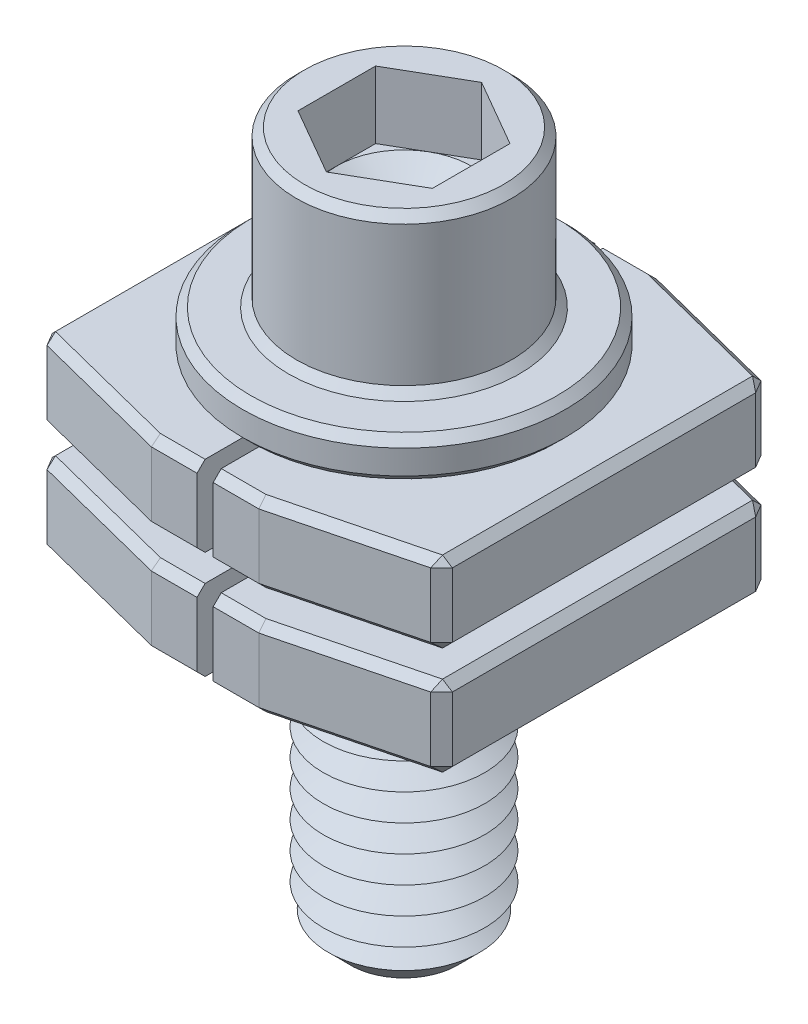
ISO-10303-21;
HEADER;
FILE_DESCRIPTION(('STEP AP214'),'2;1');
FILE_NAME('part.step','',(''),(''),'','','');
FILE_SCHEMA(('AUTOMOTIVE_DESIGN { 1 0 10303 214 1 1 1 1 }'));
ENDSEC;
DATA;
#1=APPLICATION_CONTEXT('core data for automotive mechanical design processes');
#2=APPLICATION_PROTOCOL_DEFINITION('international standard','automotive_design',2000,#1);
#3=PRODUCT_CONTEXT('',#1,'mechanical');
#4=PRODUCT('Part','Part','',(#3));
#5=PRODUCT_RELATED_PRODUCT_CATEGORY('part','',(#4));
#6=PRODUCT_DEFINITION_FORMATION('','',#4);
#7=PRODUCT_DEFINITION_CONTEXT('part definition',#1,'design');
#8=PRODUCT_DEFINITION('design','',#6,#7);
#9=PRODUCT_DEFINITION_SHAPE('','',#8);
#10=(LENGTH_UNIT() NAMED_UNIT(*) SI_UNIT(.MILLI.,.METRE.));
#11=(NAMED_UNIT(*) PLANE_ANGLE_UNIT() SI_UNIT($,.RADIAN.));
#12=(NAMED_UNIT(*) SI_UNIT($,.STERADIAN.) SOLID_ANGLE_UNIT());
#13=UNCERTAINTY_MEASURE_WITH_UNIT(LENGTH_MEASURE(1.E-05),#10,'distance_accuracy_value','');
#14=(GEOMETRIC_REPRESENTATION_CONTEXT(3) GLOBAL_UNCERTAINTY_ASSIGNED_CONTEXT((#13)) GLOBAL_UNIT_ASSIGNED_CONTEXT((#10,
#11,#12)) REPRESENTATION_CONTEXT('',''));
#15=CARTESIAN_POINT('',(0.,0.,0.));
#16=DIRECTION('',(0.,0.,1.));
#17=DIRECTION('',(1.,0.,0.));
#18=AXIS2_PLACEMENT_3D('',#15,#16,#17);
#19=CARTESIAN_POINT('',(0.,4.8,0.));
#20=DIRECTION('',(0.,1.,0.));
#21=DIRECTION('',(0.,0.,1.));
#22=AXIS2_PLACEMENT_3D('',#19,#20,#21);
#23=PLANE('',#22);
#24=CARTESIAN_POINT('',(0.,4.8,0.));
#25=DIRECTION('',(0.,1.,0.));
#26=DIRECTION('',(0.,0.,1.));
#27=AXIS2_PLACEMENT_3D('',#24,#25,#26);
#28=CIRCLE('',#27,2.5);
#29=CARTESIAN_POINT('',(1.25,4.8,2.1650635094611));
#30=VERTEX_POINT('',#29);
#31=CARTESIAN_POINT('',(2.5,4.8,0.));
#32=VERTEX_POINT('',#31);
#33=EDGE_CURVE('P0_E95',#30,#32,#28,.T.);
#34=ORIENTED_EDGE('',*,*,#33,.F.);
#35=DIRECTION('',(0.866025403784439,0.,-0.5));
#36=VECTOR('',#35,1.);
#37=CARTESIAN_POINT('',(0.,4.8,2.88675134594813));
#38=LINE('',#37,#36);
#39=CARTESIAN_POINT('',(2.5,4.8,1.44337567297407));
#40=VERTEX_POINT('',#39);
#41=EDGE_CURVE('P0_E123',#30,#40,#38,.T.);
#42=ORIENTED_EDGE('',*,*,#41,.T.);
#43=DIRECTION('',(0.,0.,-1.));
#44=VECTOR('',#43,1.);
#45=CARTESIAN_POINT('',(2.5,4.8,1.44337567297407));
#46=LINE('',#45,#44);
#47=EDGE_CURVE('P0_E119',#40,#32,#46,.T.);
#48=ORIENTED_EDGE('',*,*,#47,.T.);
#49=EDGE_LOOP('',(#34,#42,#48));
#50=FACE_BOUND('',#49,.T.);
#51=ADVANCED_FACE('P0_F16',(#50),#23,.T.);
#52=CARTESIAN_POINT('',(0.,4.8,0.));
#53=DIRECTION('',(0.,1.,0.));
#54=DIRECTION('',(0.,0.,1.));
#55=AXIS2_PLACEMENT_3D('',#52,#53,#54);
#56=CIRCLE('',#55,2.5);
#57=CARTESIAN_POINT('',(1.25,4.8,-2.1650635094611));
#58=VERTEX_POINT('',#57);
#59=EDGE_CURVE('P0_E97',#32,#58,#56,.T.);
#60=ORIENTED_EDGE('',*,*,#59,.F.);
#61=CARTESIAN_POINT('',(2.5,4.8,-1.44337567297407));
#62=VERTEX_POINT('',#61);
#63=EDGE_CURVE('P0_E108',#32,#62,#46,.T.);
#64=ORIENTED_EDGE('',*,*,#63,.T.);
#65=DIRECTION('',(-0.866025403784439,0.,-0.5));
#66=VECTOR('',#65,1.);
#67=CARTESIAN_POINT('',(2.5,4.8,-1.44337567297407));
#68=LINE('',#67,#66);
#69=EDGE_CURVE('P0_E111',#62,#58,#68,.T.);
#70=ORIENTED_EDGE('',*,*,#69,.T.);
#71=EDGE_LOOP('',(#60,#64,#70));
#72=FACE_BOUND('',#71,.T.);
#73=ADVANCED_FACE('P0_F107',(#72),#23,.T.);
#74=CARTESIAN_POINT('',(-1.25,4.8,-2.1650635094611));
#75=VERTEX_POINT('',#74);
#76=EDGE_CURVE('P0_E113',#58,#75,#56,.T.);
#77=ORIENTED_EDGE('',*,*,#76,.F.);
#78=CARTESIAN_POINT('',(0.,4.8,-2.88675134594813));
#79=VERTEX_POINT('',#78);
#80=EDGE_CURVE('P0_E146',#58,#79,#68,.T.);
#81=ORIENTED_EDGE('',*,*,#80,.T.);
#82=DIRECTION('',(-0.866025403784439,0.,0.5));
#83=VECTOR('',#82,1.);
#84=CARTESIAN_POINT('',(0.,4.8,-2.88675134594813));
#85=LINE('',#84,#83);
#86=EDGE_CURVE('P0_E344',#79,#75,#85,.T.);
#87=ORIENTED_EDGE('',*,*,#86,.T.);
#88=EDGE_LOOP('',(#77,#81,#87));
#89=FACE_BOUND('',#88,.T.);
#90=ADVANCED_FACE('P0_F309',(#89),#23,.T.);
#91=CARTESIAN_POINT('',(-2.5,4.8,0.));
#92=VERTEX_POINT('',#91);
#93=EDGE_CURVE('P0_E339',#75,#92,#56,.T.);
#94=ORIENTED_EDGE('',*,*,#93,.F.);
#95=CARTESIAN_POINT('',(-2.5,4.8,-1.44337567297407));
#96=VERTEX_POINT('',#95);
#97=EDGE_CURVE('P0_E348',#75,#96,#85,.T.);
#98=ORIENTED_EDGE('',*,*,#97,.T.);
#99=DIRECTION('',(0.,0.,1.));
#100=VECTOR('',#99,1.);
#101=CARTESIAN_POINT('',(-2.5,4.8,-1.44337567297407));
#102=LINE('',#101,#100);
#103=EDGE_CURVE('P0_E343',#96,#92,#102,.T.);
#104=ORIENTED_EDGE('',*,*,#103,.T.);
#105=EDGE_LOOP('',(#94,#98,#104));
#106=FACE_BOUND('',#105,.T.);
#107=ADVANCED_FACE('P0_F323',(#106),#23,.T.);
#108=CARTESIAN_POINT('',(-1.25,4.8,2.1650635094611));
#109=VERTEX_POINT('',#108);
#110=EDGE_CURVE('P0_E31',#92,#109,#56,.T.);
#111=ORIENTED_EDGE('',*,*,#110,.F.);
#112=CARTESIAN_POINT('',(-2.5,4.8,1.44337567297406));
#113=VERTEX_POINT('',#112);
#114=EDGE_CURVE('P0_E335',#92,#113,#102,.T.);
#115=ORIENTED_EDGE('',*,*,#114,.T.);
#116=DIRECTION('',(0.866025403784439,0.,0.5));
#117=VECTOR('',#116,1.);
#118=CARTESIAN_POINT('',(-2.5,4.8,1.44337567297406));
#119=LINE('',#118,#117);
#120=EDGE_CURVE('P0_E338',#113,#109,#119,.T.);
#121=ORIENTED_EDGE('',*,*,#120,.T.);
#122=EDGE_LOOP('',(#111,#115,#121));
#123=FACE_BOUND('',#122,.T.);
#124=ADVANCED_FACE('P0_F314',(#123),#23,.T.);
#125=CARTESIAN_POINT('',(0.,66.3086077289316,0.));
#126=DIRECTION('',(0.,1.,0.));
#127=DIRECTION('',(0.,0.,1.));
#128=AXIS2_PLACEMENT_3D('',#125,#126,#127);
#129=CYLINDRICAL_SURFACE('',#128,6.);
#130=CARTESIAN_POINT('',(0.,0.299999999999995,0.));
#131=DIRECTION('',(0.,-1.,0.));
#132=DIRECTION('',(0.,0.,-1.));
#133=AXIS2_PLACEMENT_3D('',#130,#131,#132);
#134=CIRCLE('',#133,6.);
#135=CARTESIAN_POINT('',(0.,0.299999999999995,-6.));
#136=VERTEX_POINT('',#135);
#137=EDGE_CURVE('P0_E271',#136,#136,#134,.F.);
#138=ORIENTED_EDGE('',*,*,#137,.T.);
#139=EDGE_LOOP('',(#138));
#140=FACE_BOUND('',#139,.T.);
#141=CARTESIAN_POINT('',(0.,1.20000000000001,0.));
#142=DIRECTION('',(0.,1.,0.));
#143=DIRECTION('',(0.,0.,1.));
#144=AXIS2_PLACEMENT_3D('',#141,#142,#143);
#145=CIRCLE('',#144,6.);
#146=CARTESIAN_POINT('',(0.,1.20000000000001,6.));
#147=VERTEX_POINT('',#146);
#148=EDGE_CURVE('P0_E112',#147,#147,#145,.F.);
#149=ORIENTED_EDGE('',*,*,#148,.T.);
#150=EDGE_LOOP('',(#149));
#151=FACE_BOUND('',#150,.T.);
#152=ADVANCED_FACE('P0_F322',(#140,#151),#129,.T.);
#153=CARTESIAN_POINT('',(0.,0.,6.));
#154=DIRECTION('',(0.,-1.,0.));
#155=DIRECTION('',(0.,0.,-1.));
#156=AXIS2_PLACEMENT_3D('',#153,#154,#155);
#157=PLANE('',#156);
#158=CARTESIAN_POINT('',(0.,0.,0.));
#159=DIRECTION('',(0.,-1.,0.));
#160=DIRECTION('',(0.,0.,-1.));
#161=AXIS2_PLACEMENT_3D('',#158,#159,#160);
#162=CIRCLE('',#161,5.70000000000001);
#163=CARTESIAN_POINT('',(0.,0.,-5.70000000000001));
#164=VERTEX_POINT('',#163);
#165=EDGE_CURVE('P0_E274',#164,#164,#162,.T.);
#166=ORIENTED_EDGE('',*,*,#165,.T.);
#167=EDGE_LOOP('',(#166));
#168=FACE_BOUND('',#167,.T.);
#169=CARTESIAN_POINT('',(0.,0.,0.));
#170=DIRECTION('',(0.,1.,0.));
#171=DIRECTION('',(0.,0.,1.));
#172=AXIS2_PLACEMENT_3D('',#169,#170,#171);
#173=CIRCLE('',#172,3.);
#174=CARTESIAN_POINT('',(0.,0.,3.));
#175=VERTEX_POINT('',#174);
#176=EDGE_CURVE('P0_E261',#175,#175,#173,.T.);
#177=ORIENTED_EDGE('',*,*,#176,.T.);
#178=EDGE_LOOP('',(#177));
#179=FACE_BOUND('',#178,.T.);
#180=ADVANCED_FACE('P0_F329',(#168,#179),#157,.T.);
#181=CARTESIAN_POINT('',(0.,7.3,0.));
#182=DIRECTION('',(0.,1.,0.));
#183=DIRECTION('',(0.,0.,1.));
#184=AXIS2_PLACEMENT_3D('',#181,#182,#183);
#185=PLANE('',#184);
#186=CARTESIAN_POINT('',(0.,7.3,0.));
#187=DIRECTION('',(0.,1.,0.));
#188=DIRECTION('',(0.,0.,1.));
#189=AXIS2_PLACEMENT_3D('',#186,#187,#188);
#190=CIRCLE('',#189,3.70000000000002);
#191=CARTESIAN_POINT('',(0.,7.3,3.70000000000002));
#192=VERTEX_POINT('',#191);
#193=EDGE_CURVE('P0_E11',#192,#192,#190,.T.);
#194=ORIENTED_EDGE('',*,*,#193,.T.);
#195=EDGE_LOOP('',(#194));
#196=FACE_BOUND('',#195,.T.);
#197=DIRECTION('',(-0.866025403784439,0.,-0.5));
#198=VECTOR('',#197,1.);
#199=CARTESIAN_POINT('',(2.5,7.3,-1.44337567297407));
#200=LINE('',#199,#198);
#201=CARTESIAN_POINT('',(2.5,7.3,-1.44337567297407));
#202=VERTEX_POINT('',#201);
#203=CARTESIAN_POINT('',(0.,7.3,-2.88675134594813));
#204=VERTEX_POINT('',#203);
#205=EDGE_CURVE('P0_E39',#202,#204,#200,.T.);
#206=ORIENTED_EDGE('',*,*,#205,.F.);
#207=DIRECTION('',(0.,0.,-1.));
#208=VECTOR('',#207,1.);
#209=CARTESIAN_POINT('',(2.5,7.3,1.44337567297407));
#210=LINE('',#209,#208);
#211=CARTESIAN_POINT('',(2.5,7.3,1.44337567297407));
#212=VERTEX_POINT('',#211);
#213=EDGE_CURVE('P0_E144',#212,#202,#210,.T.);
#214=ORIENTED_EDGE('',*,*,#213,.F.);
#215=DIRECTION('',(0.866025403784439,0.,-0.5));
#216=VECTOR('',#215,1.);
#217=CARTESIAN_POINT('',(0.,7.3,2.88675134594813));
#218=LINE('',#217,#216);
#219=CARTESIAN_POINT('',(0.,7.3,2.88675134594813));
#220=VERTEX_POINT('',#219);
#221=EDGE_CURVE('P0_E141',#220,#212,#218,.T.);
#222=ORIENTED_EDGE('',*,*,#221,.F.);
#223=DIRECTION('',(0.866025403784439,0.,0.5));
#224=VECTOR('',#223,1.);
#225=CARTESIAN_POINT('',(-2.5,7.3,1.44337567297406));
#226=LINE('',#225,#224);
#227=CARTESIAN_POINT('',(-2.5,7.3,1.44337567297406));
#228=VERTEX_POINT('',#227);
#229=EDGE_CURVE('P0_E138',#228,#220,#226,.T.);
#230=ORIENTED_EDGE('',*,*,#229,.F.);
#231=DIRECTION('',(0.,0.,1.));
#232=VECTOR('',#231,1.);
#233=CARTESIAN_POINT('',(-2.5,7.3,-1.44337567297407));
#234=LINE('',#233,#232);
#235=CARTESIAN_POINT('',(-2.5,7.3,-1.44337567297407));
#236=VERTEX_POINT('',#235);
#237=EDGE_CURVE('P0_E135',#236,#228,#234,.T.);
#238=ORIENTED_EDGE('',*,*,#237,.F.);
#239=DIRECTION('',(-0.866025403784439,0.,0.5));
#240=VECTOR('',#239,1.);
#241=CARTESIAN_POINT('',(0.,7.3,-2.88675134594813));
#242=LINE('',#241,#240);
#243=EDGE_CURVE('P0_E132',#204,#236,#242,.T.);
#244=ORIENTED_EDGE('',*,*,#243,.F.);
#245=EDGE_LOOP('',(#206,#214,#222,#230,#238,#244));
#246=FACE_BOUND('',#245,.T.);
#247=ADVANCED_FACE('P0_F363',(#196,#246),#185,.T.);
#248=CARTESIAN_POINT('',(0.,66.3086077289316,0.));
#249=DIRECTION('',(0.,1.,0.));
#250=DIRECTION('',(0.,0.,1.));
#251=AXIS2_PLACEMENT_3D('',#248,#249,#250);
#252=CYLINDRICAL_SURFACE('',#251,4.);
#253=CARTESIAN_POINT('',(0.,1.80000000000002,0.));
#254=DIRECTION('',(0.,1.,0.));
#255=DIRECTION('',(0.,0.,1.));
#256=AXIS2_PLACEMENT_3D('',#253,#254,#255);
#257=CIRCLE('',#256,4.);
#258=CARTESIAN_POINT('',(0.,1.80000000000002,4.));
#259=VERTEX_POINT('',#258);
#260=EDGE_CURVE('P0_E24',#259,#259,#257,.T.);
#261=ORIENTED_EDGE('',*,*,#260,.T.);
#262=EDGE_LOOP('',(#261));
#263=FACE_BOUND('',#262,.T.);
#264=CARTESIAN_POINT('',(0.,7.00000000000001,0.));
#265=DIRECTION('',(0.,1.,0.));
#266=DIRECTION('',(0.,0.,1.));
#267=AXIS2_PLACEMENT_3D('',#264,#265,#266);
#268=CIRCLE('',#267,4.);
#269=CARTESIAN_POINT('',(0.,7.00000000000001,4.));
#270=VERTEX_POINT('',#269);
#271=EDGE_CURVE('P0_E283',#270,#270,#268,.F.);
#272=ORIENTED_EDGE('',*,*,#271,.T.);
#273=EDGE_LOOP('',(#272));
#274=FACE_BOUND('',#273,.T.);
#275=ADVANCED_FACE('P0_F288',(#263,#274),#252,.T.);
#276=CARTESIAN_POINT('',(0.,1.5,4.));
#277=DIRECTION('',(0.,1.,0.));
#278=DIRECTION('',(0.,0.,1.));
#279=AXIS2_PLACEMENT_3D('',#276,#277,#278);
#280=PLANE('',#279);
#281=CARTESIAN_POINT('',(0.,1.5,0.));
#282=DIRECTION('',(0.,1.,0.));
#283=DIRECTION('',(0.,0.,1.));
#284=AXIS2_PLACEMENT_3D('',#281,#282,#283);
#285=CIRCLE('',#284,5.70000000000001);
#286=CARTESIAN_POINT('',(0.,1.5,5.70000000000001));
#287=VERTEX_POINT('',#286);
#288=EDGE_CURVE('P0_E280',#287,#287,#285,.T.);
#289=ORIENTED_EDGE('',*,*,#288,.T.);
#290=EDGE_LOOP('',(#289));
#291=FACE_BOUND('',#290,.T.);
#292=CARTESIAN_POINT('',(0.,1.5,0.));
#293=DIRECTION('',(0.,1.,0.));
#294=DIRECTION('',(0.,0.,1.));
#295=AXIS2_PLACEMENT_3D('',#292,#293,#294);
#296=CIRCLE('',#295,4.30000000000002);
#297=CARTESIAN_POINT('',(0.,1.5,4.30000000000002));
#298=VERTEX_POINT('',#297);
#299=EDGE_CURVE('P0_E277',#298,#298,#296,.F.);
#300=ORIENTED_EDGE('',*,*,#299,.T.);
#301=EDGE_LOOP('',(#300));
#302=FACE_BOUND('',#301,.T.);
#303=ADVANCED_FACE('P0_F422',(#291,#302),#280,.T.);
#304=CARTESIAN_POINT('',(0.,-0.5,0.));
#305=DIRECTION('',(0.,1.,0.));
#306=DIRECTION('',(0.,0.,1.));
#307=AXIS2_PLACEMENT_3D('',#304,#305,#306);
#308=CONICAL_SURFACE('',#307,2.13397459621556,1.0471975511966);
#309=ORIENTED_EDGE('',*,*,#176,.F.);
#310=EDGE_LOOP('',(#309));
#311=FACE_BOUND('',#310,.T.);
#312=CARTESIAN_POINT('',(0.,-0.5,0.));
#313=DIRECTION('',(0.,1.,0.));
#314=DIRECTION('',(0.,0.,1.));
#315=AXIS2_PLACEMENT_3D('',#312,#313,#314);
#316=CIRCLE('',#315,2.13397459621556);
#317=CARTESIAN_POINT('',(0.,-0.5,2.13397459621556));
#318=VERTEX_POINT('',#317);
#319=EDGE_CURVE('P0_E258',#318,#318,#316,.T.);
#320=ORIENTED_EDGE('',*,*,#319,.T.);
#321=EDGE_LOOP('',(#320));
#322=FACE_BOUND('',#321,.T.);
#323=ADVANCED_FACE('P0_F431',(#311,#322),#308,.T.);
#324=CARTESIAN_POINT('',(0.,-1.,0.));
#325=DIRECTION('',(0.,-1.,0.));
#326=DIRECTION('',(0.,0.,-1.));
#327=AXIS2_PLACEMENT_3D('',#324,#325,#326);
#328=CONICAL_SURFACE('',#327,3.,1.0471975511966);
#329=ORIENTED_EDGE('',*,*,#319,.F.);
#330=EDGE_LOOP('',(#329));
#331=FACE_BOUND('',#330,.T.);
#332=CARTESIAN_POINT('',(0.,-1.,0.));
#333=DIRECTION('',(0.,1.,0.));
#334=DIRECTION('',(0.,0.,1.));
#335=AXIS2_PLACEMENT_3D('',#332,#333,#334);
#336=CIRCLE('',#335,3.);
#337=CARTESIAN_POINT('',(0.,-1.,3.));
#338=VERTEX_POINT('',#337);
#339=EDGE_CURVE('P0_E255',#338,#338,#336,.T.);
#340=ORIENTED_EDGE('',*,*,#339,.T.);
#341=EDGE_LOOP('',(#340));
#342=FACE_BOUND('',#341,.T.);
#343=ADVANCED_FACE('P0_F441',(#331,#342),#328,.T.);
#344=CARTESIAN_POINT('',(0.,-1.5,0.));
#345=DIRECTION('',(0.,1.,0.));
#346=DIRECTION('',(0.,0.,1.));
#347=AXIS2_PLACEMENT_3D('',#344,#345,#346);
#348=CONICAL_SURFACE('',#347,2.13397459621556,1.0471975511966);
#349=ORIENTED_EDGE('',*,*,#339,.F.);
#350=EDGE_LOOP('',(#349));
#351=FACE_BOUND('',#350,.T.);
#352=CARTESIAN_POINT('',(0.,-1.5,0.));
#353=DIRECTION('',(0.,1.,0.));
#354=DIRECTION('',(0.,0.,1.));
#355=AXIS2_PLACEMENT_3D('',#352,#353,#354);
#356=CIRCLE('',#355,2.13397459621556);
#357=CARTESIAN_POINT('',(0.,-1.5,2.13397459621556));
#358=VERTEX_POINT('',#357);
#359=EDGE_CURVE('P0_E252',#358,#358,#356,.T.);
#360=ORIENTED_EDGE('',*,*,#359,.T.);
#361=EDGE_LOOP('',(#360));
#362=FACE_BOUND('',#361,.T.);
#363=ADVANCED_FACE('P0_F451',(#351,#362),#348,.T.);
#364=CARTESIAN_POINT('',(0.,-2.,0.));
#365=DIRECTION('',(0.,-1.,0.));
#366=DIRECTION('',(0.,0.,-1.));
#367=AXIS2_PLACEMENT_3D('',#364,#365,#366);
#368=CONICAL_SURFACE('',#367,3.,1.0471975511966);
#369=ORIENTED_EDGE('',*,*,#359,.F.);
#370=EDGE_LOOP('',(#369));
#371=FACE_BOUND('',#370,.T.);
#372=CARTESIAN_POINT('',(0.,-2.,0.));
#373=DIRECTION('',(0.,1.,0.));
#374=DIRECTION('',(0.,0.,1.));
#375=AXIS2_PLACEMENT_3D('',#372,#373,#374);
#376=CIRCLE('',#375,3.);
#377=CARTESIAN_POINT('',(0.,-2.,3.));
#378=VERTEX_POINT('',#377);
#379=EDGE_CURVE('P0_E249',#378,#378,#376,.T.);
#380=ORIENTED_EDGE('',*,*,#379,.T.);
#381=EDGE_LOOP('',(#380));
#382=FACE_BOUND('',#381,.T.);
#383=ADVANCED_FACE('P0_F461',(#371,#382),#368,.T.);
#384=CARTESIAN_POINT('',(0.,-2.5,0.));
#385=DIRECTION('',(0.,1.,0.));
#386=DIRECTION('',(0.,0.,1.));
#387=AXIS2_PLACEMENT_3D('',#384,#385,#386);
#388=CONICAL_SURFACE('',#387,2.13397459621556,1.0471975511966);
#389=ORIENTED_EDGE('',*,*,#379,.F.);
#390=EDGE_LOOP('',(#389));
#391=FACE_BOUND('',#390,.T.);
#392=CARTESIAN_POINT('',(0.,-2.5,0.));
#393=DIRECTION('',(0.,1.,0.));
#394=DIRECTION('',(0.,0.,1.));
#395=AXIS2_PLACEMENT_3D('',#392,#393,#394);
#396=CIRCLE('',#395,2.13397459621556);
#397=CARTESIAN_POINT('',(0.,-2.5,2.13397459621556));
#398=VERTEX_POINT('',#397);
#399=EDGE_CURVE('P0_E246',#398,#398,#396,.T.);
#400=ORIENTED_EDGE('',*,*,#399,.T.);
#401=EDGE_LOOP('',(#400));
#402=FACE_BOUND('',#401,.T.);
#403=ADVANCED_FACE('P0_F471',(#391,#402),#388,.T.);
#404=CARTESIAN_POINT('',(0.,-3.,0.));
#405=DIRECTION('',(0.,-1.,0.));
#406=DIRECTION('',(0.,0.,-1.));
#407=AXIS2_PLACEMENT_3D('',#404,#405,#406);
#408=CONICAL_SURFACE('',#407,3.,1.0471975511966);
#409=ORIENTED_EDGE('',*,*,#399,.F.);
#410=EDGE_LOOP('',(#409));
#411=FACE_BOUND('',#410,.T.);
#412=CARTESIAN_POINT('',(0.,-3.,0.));
#413=DIRECTION('',(0.,1.,0.));
#414=DIRECTION('',(0.,0.,1.));
#415=AXIS2_PLACEMENT_3D('',#412,#413,#414);
#416=CIRCLE('',#415,3.);
#417=CARTESIAN_POINT('',(0.,-3.,3.));
#418=VERTEX_POINT('',#417);
#419=EDGE_CURVE('P0_E243',#418,#418,#416,.T.);
#420=ORIENTED_EDGE('',*,*,#419,.T.);
#421=EDGE_LOOP('',(#420));
#422=FACE_BOUND('',#421,.T.);
#423=ADVANCED_FACE('P0_F481',(#411,#422),#408,.T.);
#424=CARTESIAN_POINT('',(0.,-3.5,0.));
#425=DIRECTION('',(0.,1.,0.));
#426=DIRECTION('',(0.,0.,1.));
#427=AXIS2_PLACEMENT_3D('',#424,#425,#426);
#428=CONICAL_SURFACE('',#427,2.13397459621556,1.0471975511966);
#429=ORIENTED_EDGE('',*,*,#419,.F.);
#430=EDGE_LOOP('',(#429));
#431=FACE_BOUND('',#430,.T.);
#432=CARTESIAN_POINT('',(0.,-3.5,0.));
#433=DIRECTION('',(0.,1.,0.));
#434=DIRECTION('',(0.,0.,1.));
#435=AXIS2_PLACEMENT_3D('',#432,#433,#434);
#436=CIRCLE('',#435,2.13397459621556);
#437=CARTESIAN_POINT('',(0.,-3.5,2.13397459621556));
#438=VERTEX_POINT('',#437);
#439=EDGE_CURVE('P0_E240',#438,#438,#436,.T.);
#440=ORIENTED_EDGE('',*,*,#439,.T.);
#441=EDGE_LOOP('',(#440));
#442=FACE_BOUND('',#441,.T.);
#443=ADVANCED_FACE('P0_F491',(#431,#442),#428,.T.);
#444=CARTESIAN_POINT('',(0.,-4.,0.));
#445=DIRECTION('',(0.,-1.,0.));
#446=DIRECTION('',(0.,0.,-1.));
#447=AXIS2_PLACEMENT_3D('',#444,#445,#446);
#448=CONICAL_SURFACE('',#447,3.,1.0471975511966);
#449=ORIENTED_EDGE('',*,*,#439,.F.);
#450=EDGE_LOOP('',(#449));
#451=FACE_BOUND('',#450,.T.);
#452=CARTESIAN_POINT('',(0.,-4.,0.));
#453=DIRECTION('',(0.,1.,0.));
#454=DIRECTION('',(0.,0.,1.));
#455=AXIS2_PLACEMENT_3D('',#452,#453,#454);
#456=CIRCLE('',#455,3.);
#457=CARTESIAN_POINT('',(0.,-4.,3.));
#458=VERTEX_POINT('',#457);
#459=EDGE_CURVE('P0_E237',#458,#458,#456,.T.);
#460=ORIENTED_EDGE('',*,*,#459,.T.);
#461=EDGE_LOOP('',(#460));
#462=FACE_BOUND('',#461,.T.);
#463=ADVANCED_FACE('P0_F501',(#451,#462),#448,.T.);
#464=CARTESIAN_POINT('',(0.,-4.5,0.));
#465=DIRECTION('',(0.,1.,0.));
#466=DIRECTION('',(0.,0.,1.));
#467=AXIS2_PLACEMENT_3D('',#464,#465,#466);
#468=CONICAL_SURFACE('',#467,2.13397459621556,1.0471975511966);
#469=ORIENTED_EDGE('',*,*,#459,.F.);
#470=EDGE_LOOP('',(#469));
#471=FACE_BOUND('',#470,.T.);
#472=CARTESIAN_POINT('',(0.,-4.5,0.));
#473=DIRECTION('',(0.,1.,0.));
#474=DIRECTION('',(0.,0.,1.));
#475=AXIS2_PLACEMENT_3D('',#472,#473,#474);
#476=CIRCLE('',#475,2.13397459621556);
#477=CARTESIAN_POINT('',(0.,-4.5,2.13397459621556));
#478=VERTEX_POINT('',#477);
#479=EDGE_CURVE('P0_E234',#478,#478,#476,.T.);
#480=ORIENTED_EDGE('',*,*,#479,.T.);
#481=EDGE_LOOP('',(#480));
#482=FACE_BOUND('',#481,.T.);
#483=ADVANCED_FACE('P0_F511',(#471,#482),#468,.T.);
#484=CARTESIAN_POINT('',(0.,-5.,0.));
#485=DIRECTION('',(0.,-1.,0.));
#486=DIRECTION('',(0.,0.,-1.));
#487=AXIS2_PLACEMENT_3D('',#484,#485,#486);
#488=CONICAL_SURFACE('',#487,3.,1.0471975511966);
#489=ORIENTED_EDGE('',*,*,#479,.F.);
#490=EDGE_LOOP('',(#489));
#491=FACE_BOUND('',#490,.T.);
#492=CARTESIAN_POINT('',(0.,-5.,0.));
#493=DIRECTION('',(0.,1.,0.));
#494=DIRECTION('',(0.,0.,1.));
#495=AXIS2_PLACEMENT_3D('',#492,#493,#494);
#496=CIRCLE('',#495,3.);
#497=CARTESIAN_POINT('',(0.,-5.,3.));
#498=VERTEX_POINT('',#497);
#499=EDGE_CURVE('P0_E231',#498,#498,#496,.T.);
#500=ORIENTED_EDGE('',*,*,#499,.T.);
#501=EDGE_LOOP('',(#500));
#502=FACE_BOUND('',#501,.T.);
#503=ADVANCED_FACE('P0_F521',(#491,#502),#488,.T.);
#504=CARTESIAN_POINT('',(0.,-5.5,0.));
#505=DIRECTION('',(0.,1.,0.));
#506=DIRECTION('',(0.,0.,1.));
#507=AXIS2_PLACEMENT_3D('',#504,#505,#506);
#508=CONICAL_SURFACE('',#507,2.13397459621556,1.0471975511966);
#509=ORIENTED_EDGE('',*,*,#499,.F.);
#510=EDGE_LOOP('',(#509));
#511=FACE_BOUND('',#510,.T.);
#512=CARTESIAN_POINT('',(0.,-5.5,0.));
#513=DIRECTION('',(0.,1.,0.));
#514=DIRECTION('',(0.,0.,1.));
#515=AXIS2_PLACEMENT_3D('',#512,#513,#514);
#516=CIRCLE('',#515,2.13397459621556);
#517=CARTESIAN_POINT('',(0.,-5.5,2.13397459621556));
#518=VERTEX_POINT('',#517);
#519=EDGE_CURVE('P0_E228',#518,#518,#516,.T.);
#520=ORIENTED_EDGE('',*,*,#519,.T.);
#521=EDGE_LOOP('',(#520));
#522=FACE_BOUND('',#521,.T.);
#523=ADVANCED_FACE('P0_F531',(#511,#522),#508,.T.);
#524=CARTESIAN_POINT('',(0.,-6.,0.));
#525=DIRECTION('',(0.,-1.,0.));
#526=DIRECTION('',(0.,0.,-1.));
#527=AXIS2_PLACEMENT_3D('',#524,#525,#526);
#528=CONICAL_SURFACE('',#527,3.,1.0471975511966);
#529=ORIENTED_EDGE('',*,*,#519,.F.);
#530=EDGE_LOOP('',(#529));
#531=FACE_BOUND('',#530,.T.);
#532=CARTESIAN_POINT('',(0.,-6.,0.));
#533=DIRECTION('',(0.,1.,0.));
#534=DIRECTION('',(0.,0.,1.));
#535=AXIS2_PLACEMENT_3D('',#532,#533,#534);
#536=CIRCLE('',#535,3.);
#537=CARTESIAN_POINT('',(0.,-6.,3.));
#538=VERTEX_POINT('',#537);
#539=EDGE_CURVE('P0_E225',#538,#538,#536,.T.);
#540=ORIENTED_EDGE('',*,*,#539,.T.);
#541=EDGE_LOOP('',(#540));
#542=FACE_BOUND('',#541,.T.);
#543=ADVANCED_FACE('P0_F541',(#531,#542),#528,.T.);
#544=CARTESIAN_POINT('',(0.,-6.5,0.));
#545=DIRECTION('',(0.,1.,0.));
#546=DIRECTION('',(0.,0.,1.));
#547=AXIS2_PLACEMENT_3D('',#544,#545,#546);
#548=CONICAL_SURFACE('',#547,2.13397459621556,1.0471975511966);
#549=ORIENTED_EDGE('',*,*,#539,.F.);
#550=EDGE_LOOP('',(#549));
#551=FACE_BOUND('',#550,.T.);
#552=CARTESIAN_POINT('',(0.,-6.5,0.));
#553=DIRECTION('',(0.,1.,0.));
#554=DIRECTION('',(0.,0.,1.));
#555=AXIS2_PLACEMENT_3D('',#552,#553,#554);
#556=CIRCLE('',#555,2.13397459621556);
#557=CARTESIAN_POINT('',(0.,-6.5,2.13397459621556));
#558=VERTEX_POINT('',#557);
#559=EDGE_CURVE('P0_E222',#558,#558,#556,.T.);
#560=ORIENTED_EDGE('',*,*,#559,.T.);
#561=EDGE_LOOP('',(#560));
#562=FACE_BOUND('',#561,.T.);
#563=ADVANCED_FACE('P0_F551',(#551,#562),#548,.T.);
#564=CARTESIAN_POINT('',(0.,-7.,0.));
#565=DIRECTION('',(0.,-1.,0.));
#566=DIRECTION('',(0.,0.,-1.));
#567=AXIS2_PLACEMENT_3D('',#564,#565,#566);
#568=CONICAL_SURFACE('',#567,3.,1.0471975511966);
#569=ORIENTED_EDGE('',*,*,#559,.F.);
#570=EDGE_LOOP('',(#569));
#571=FACE_BOUND('',#570,.T.);
#572=CARTESIAN_POINT('',(0.,-7.,0.));
#573=DIRECTION('',(0.,1.,0.));
#574=DIRECTION('',(0.,0.,1.));
#575=AXIS2_PLACEMENT_3D('',#572,#573,#574);
#576=CIRCLE('',#575,3.);
#577=CARTESIAN_POINT('',(0.,-7.,3.));
#578=VERTEX_POINT('',#577);
#579=EDGE_CURVE('P0_E219',#578,#578,#576,.T.);
#580=ORIENTED_EDGE('',*,*,#579,.T.);
#581=EDGE_LOOP('',(#580));
#582=FACE_BOUND('',#581,.T.);
#583=ADVANCED_FACE('P0_F561',(#571,#582),#568,.T.);
#584=CARTESIAN_POINT('',(0.,-7.5,0.));
#585=DIRECTION('',(0.,1.,0.));
#586=DIRECTION('',(0.,0.,1.));
#587=AXIS2_PLACEMENT_3D('',#584,#585,#586);
#588=CONICAL_SURFACE('',#587,2.13397459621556,1.0471975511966);
#589=ORIENTED_EDGE('',*,*,#579,.F.);
#590=EDGE_LOOP('',(#589));
#591=FACE_BOUND('',#590,.T.);
#592=CARTESIAN_POINT('',(0.,-7.5,0.));
#593=DIRECTION('',(0.,1.,0.));
#594=DIRECTION('',(0.,0.,1.));
#595=AXIS2_PLACEMENT_3D('',#592,#593,#594);
#596=CIRCLE('',#595,2.13397459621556);
#597=CARTESIAN_POINT('',(0.,-7.5,2.13397459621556));
#598=VERTEX_POINT('',#597);
#599=EDGE_CURVE('P0_E216',#598,#598,#596,.T.);
#600=ORIENTED_EDGE('',*,*,#599,.T.);
#601=EDGE_LOOP('',(#600));
#602=FACE_BOUND('',#601,.T.);
#603=ADVANCED_FACE('P0_F571',(#591,#602),#588,.T.);
#604=CARTESIAN_POINT('',(0.,-8.,0.));
#605=DIRECTION('',(0.,-1.,0.));
#606=DIRECTION('',(0.,0.,-1.));
#607=AXIS2_PLACEMENT_3D('',#604,#605,#606);
#608=CONICAL_SURFACE('',#607,3.,1.0471975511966);
#609=ORIENTED_EDGE('',*,*,#599,.F.);
#610=EDGE_LOOP('',(#609));
#611=FACE_BOUND('',#610,.T.);
#612=CARTESIAN_POINT('',(0.,-8.,0.));
#613=DIRECTION('',(0.,1.,0.));
#614=DIRECTION('',(0.,0.,1.));
#615=AXIS2_PLACEMENT_3D('',#612,#613,#614);
#616=CIRCLE('',#615,3.);
#617=CARTESIAN_POINT('',(0.,-8.,3.));
#618=VERTEX_POINT('',#617);
#619=EDGE_CURVE('P0_E213',#618,#618,#616,.T.);
#620=ORIENTED_EDGE('',*,*,#619,.T.);
#621=EDGE_LOOP('',(#620));
#622=FACE_BOUND('',#621,.T.);
#623=ADVANCED_FACE('P0_F581',(#611,#622),#608,.T.);
#624=CARTESIAN_POINT('',(0.,-8.5,0.));
#625=DIRECTION('',(0.,1.,0.));
#626=DIRECTION('',(0.,0.,1.));
#627=AXIS2_PLACEMENT_3D('',#624,#625,#626);
#628=CONICAL_SURFACE('',#627,2.13397459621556,1.0471975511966);
#629=ORIENTED_EDGE('',*,*,#619,.F.);
#630=EDGE_LOOP('',(#629));
#631=FACE_BOUND('',#630,.T.);
#632=CARTESIAN_POINT('',(0.,-8.5,0.));
#633=DIRECTION('',(0.,1.,0.));
#634=DIRECTION('',(0.,0.,1.));
#635=AXIS2_PLACEMENT_3D('',#632,#633,#634);
#636=CIRCLE('',#635,2.13397459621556);
#637=CARTESIAN_POINT('',(0.,-8.5,2.13397459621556));
#638=VERTEX_POINT('',#637);
#639=EDGE_CURVE('P0_E210',#638,#638,#636,.T.);
#640=ORIENTED_EDGE('',*,*,#639,.T.);
#641=EDGE_LOOP('',(#640));
#642=FACE_BOUND('',#641,.T.);
#643=ADVANCED_FACE('P0_F591',(#631,#642),#628,.T.);
#644=CARTESIAN_POINT('',(0.,-9.,0.));
#645=DIRECTION('',(0.,-1.,0.));
#646=DIRECTION('',(0.,0.,-1.));
#647=AXIS2_PLACEMENT_3D('',#644,#645,#646);
#648=CONICAL_SURFACE('',#647,3.,1.0471975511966);
#649=ORIENTED_EDGE('',*,*,#639,.F.);
#650=EDGE_LOOP('',(#649));
#651=FACE_BOUND('',#650,.T.);
#652=CARTESIAN_POINT('',(0.,-9.,0.));
#653=DIRECTION('',(0.,1.,0.));
#654=DIRECTION('',(0.,0.,1.));
#655=AXIS2_PLACEMENT_3D('',#652,#653,#654);
#656=CIRCLE('',#655,3.);
#657=CARTESIAN_POINT('',(0.,-9.,3.));
#658=VERTEX_POINT('',#657);
#659=EDGE_CURVE('P0_E207',#658,#658,#656,.T.);
#660=ORIENTED_EDGE('',*,*,#659,.T.);
#661=EDGE_LOOP('',(#660));
#662=FACE_BOUND('',#661,.T.);
#663=ADVANCED_FACE('P0_F601',(#651,#662),#648,.T.);
#664=CARTESIAN_POINT('',(0.,-9.5,0.));
#665=DIRECTION('',(0.,1.,0.));
#666=DIRECTION('',(0.,0.,1.));
#667=AXIS2_PLACEMENT_3D('',#664,#665,#666);
#668=CONICAL_SURFACE('',#667,2.13397459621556,1.0471975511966);
#669=ORIENTED_EDGE('',*,*,#659,.F.);
#670=EDGE_LOOP('',(#669));
#671=FACE_BOUND('',#670,.T.);
#672=CARTESIAN_POINT('',(0.,-9.5,0.));
#673=DIRECTION('',(0.,1.,0.));
#674=DIRECTION('',(0.,0.,1.));
#675=AXIS2_PLACEMENT_3D('',#672,#673,#674);
#676=CIRCLE('',#675,2.13397459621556);
#677=CARTESIAN_POINT('',(0.,-9.5,2.13397459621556));
#678=VERTEX_POINT('',#677);
#679=EDGE_CURVE('P0_E204',#678,#678,#676,.T.);
#680=ORIENTED_EDGE('',*,*,#679,.T.);
#681=EDGE_LOOP('',(#680));
#682=FACE_BOUND('',#681,.T.);
#683=ADVANCED_FACE('P0_F611',(#671,#682),#668,.T.);
#684=CARTESIAN_POINT('',(0.,-10.,0.));
#685=DIRECTION('',(0.,-1.,0.));
#686=DIRECTION('',(0.,0.,-1.));
#687=AXIS2_PLACEMENT_3D('',#684,#685,#686);
#688=CONICAL_SURFACE('',#687,3.,1.0471975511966);
#689=ORIENTED_EDGE('',*,*,#679,.F.);
#690=EDGE_LOOP('',(#689));
#691=FACE_BOUND('',#690,.T.);
#692=CARTESIAN_POINT('',(0.,-10.,0.));
#693=DIRECTION('',(0.,1.,0.));
#694=DIRECTION('',(0.,0.,1.));
#695=AXIS2_PLACEMENT_3D('',#692,#693,#694);
#696=CIRCLE('',#695,3.);
#697=CARTESIAN_POINT('',(0.,-10.,3.));
#698=VERTEX_POINT('',#697);
#699=EDGE_CURVE('P0_E201',#698,#698,#696,.T.);
#700=ORIENTED_EDGE('',*,*,#699,.T.);
#701=EDGE_LOOP('',(#700));
#702=FACE_BOUND('',#701,.T.);
#703=ADVANCED_FACE('P0_F621',(#691,#702),#688,.T.);
#704=CARTESIAN_POINT('',(0.,-10.5,0.));
#705=DIRECTION('',(0.,1.,0.));
#706=DIRECTION('',(0.,0.,1.));
#707=AXIS2_PLACEMENT_3D('',#704,#705,#706);
#708=CONICAL_SURFACE('',#707,2.13397459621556,1.0471975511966);
#709=ORIENTED_EDGE('',*,*,#699,.F.);
#710=EDGE_LOOP('',(#709));
#711=FACE_BOUND('',#710,.T.);
#712=CARTESIAN_POINT('',(0.,-10.5,0.));
#713=DIRECTION('',(0.,1.,0.));
#714=DIRECTION('',(0.,0.,1.));
#715=AXIS2_PLACEMENT_3D('',#712,#713,#714);
#716=CIRCLE('',#715,2.13397459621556);
#717=CARTESIAN_POINT('',(0.,-10.5,2.13397459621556));
#718=VERTEX_POINT('',#717);
#719=EDGE_CURVE('P0_E198',#718,#718,#716,.T.);
#720=ORIENTED_EDGE('',*,*,#719,.T.);
#721=EDGE_LOOP('',(#720));
#722=FACE_BOUND('',#721,.T.);
#723=ADVANCED_FACE('P0_F631',(#711,#722),#708,.T.);
#724=CARTESIAN_POINT('',(0.,-11.,0.));
#725=DIRECTION('',(0.,-1.,0.));
#726=DIRECTION('',(0.,0.,-1.));
#727=AXIS2_PLACEMENT_3D('',#724,#725,#726);
#728=CONICAL_SURFACE('',#727,3.,1.0471975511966);
#729=ORIENTED_EDGE('',*,*,#719,.F.);
#730=EDGE_LOOP('',(#729));
#731=FACE_BOUND('',#730,.T.);
#732=CARTESIAN_POINT('',(0.,-11.,0.));
#733=DIRECTION('',(0.,1.,0.));
#734=DIRECTION('',(0.,0.,1.));
#735=AXIS2_PLACEMENT_3D('',#732,#733,#734);
#736=CIRCLE('',#735,3.);
#737=CARTESIAN_POINT('',(0.,-11.,3.));
#738=VERTEX_POINT('',#737);
#739=EDGE_CURVE('P0_E195',#738,#738,#736,.T.);
#740=ORIENTED_EDGE('',*,*,#739,.T.);
#741=EDGE_LOOP('',(#740));
#742=FACE_BOUND('',#741,.T.);
#743=ADVANCED_FACE('P0_F641',(#731,#742),#728,.T.);
#744=CARTESIAN_POINT('',(0.,-11.5,0.));
#745=DIRECTION('',(0.,1.,0.));
#746=DIRECTION('',(0.,0.,1.));
#747=AXIS2_PLACEMENT_3D('',#744,#745,#746);
#748=CONICAL_SURFACE('',#747,2.13397459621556,1.0471975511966);
#749=ORIENTED_EDGE('',*,*,#739,.F.);
#750=EDGE_LOOP('',(#749));
#751=FACE_BOUND('',#750,.T.);
#752=CARTESIAN_POINT('',(0.,-11.5,0.));
#753=DIRECTION('',(0.,1.,0.));
#754=DIRECTION('',(0.,0.,1.));
#755=AXIS2_PLACEMENT_3D('',#752,#753,#754);
#756=CIRCLE('',#755,2.13397459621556);
#757=CARTESIAN_POINT('',(0.,-11.5,2.13397459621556));
#758=VERTEX_POINT('',#757);
#759=EDGE_CURVE('P0_E192',#758,#758,#756,.T.);
#760=ORIENTED_EDGE('',*,*,#759,.T.);
#761=EDGE_LOOP('',(#760));
#762=FACE_BOUND('',#761,.T.);
#763=ADVANCED_FACE('P0_F651',(#751,#762),#748,.T.);
#764=CARTESIAN_POINT('',(0.,-12.,0.));
#765=DIRECTION('',(0.,-1.,0.));
#766=DIRECTION('',(0.,0.,-1.));
#767=AXIS2_PLACEMENT_3D('',#764,#765,#766);
#768=CONICAL_SURFACE('',#767,3.,1.0471975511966);
#769=ORIENTED_EDGE('',*,*,#759,.F.);
#770=EDGE_LOOP('',(#769));
#771=FACE_BOUND('',#770,.T.);
#772=CARTESIAN_POINT('',(0.,-12.,0.));
#773=DIRECTION('',(0.,1.,0.));
#774=DIRECTION('',(0.,0.,1.));
#775=AXIS2_PLACEMENT_3D('',#772,#773,#774);
#776=CIRCLE('',#775,3.);
#777=CARTESIAN_POINT('',(0.,-12.,3.));
#778=VERTEX_POINT('',#777);
#779=EDGE_CURVE('P0_E189',#778,#778,#776,.T.);
#780=ORIENTED_EDGE('',*,*,#779,.T.);
#781=EDGE_LOOP('',(#780));
#782=FACE_BOUND('',#781,.T.);
#783=ADVANCED_FACE('P0_F661',(#771,#782),#768,.T.);
#784=CARTESIAN_POINT('',(0.,-12.5,0.));
#785=DIRECTION('',(0.,1.,0.));
#786=DIRECTION('',(0.,0.,1.));
#787=AXIS2_PLACEMENT_3D('',#784,#785,#786);
#788=CONICAL_SURFACE('',#787,2.13397459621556,1.0471975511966);
#789=ORIENTED_EDGE('',*,*,#779,.F.);
#790=EDGE_LOOP('',(#789));
#791=FACE_BOUND('',#790,.T.);
#792=CARTESIAN_POINT('',(0.,-12.5,0.));
#793=DIRECTION('',(0.,1.,0.));
#794=DIRECTION('',(0.,0.,1.));
#795=AXIS2_PLACEMENT_3D('',#792,#793,#794);
#796=CIRCLE('',#795,2.13397459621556);
#797=CARTESIAN_POINT('',(0.,-12.5,2.13397459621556));
#798=VERTEX_POINT('',#797);
#799=EDGE_CURVE('P0_E186',#798,#798,#796,.T.);
#800=ORIENTED_EDGE('',*,*,#799,.T.);
#801=EDGE_LOOP('',(#800));
#802=FACE_BOUND('',#801,.T.);
#803=ADVANCED_FACE('P0_F671',(#791,#802),#788,.T.);
#804=CARTESIAN_POINT('',(0.,-13.,0.));
#805=DIRECTION('',(0.,-1.,0.));
#806=DIRECTION('',(0.,0.,-1.));
#807=AXIS2_PLACEMENT_3D('',#804,#805,#806);
#808=CONICAL_SURFACE('',#807,3.,1.0471975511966);
#809=ORIENTED_EDGE('',*,*,#799,.F.);
#810=EDGE_LOOP('',(#809));
#811=FACE_BOUND('',#810,.T.);
#812=CARTESIAN_POINT('',(0.,-13.,0.));
#813=DIRECTION('',(0.,1.,0.));
#814=DIRECTION('',(0.,0.,1.));
#815=AXIS2_PLACEMENT_3D('',#812,#813,#814);
#816=CIRCLE('',#815,3.);
#817=CARTESIAN_POINT('',(0.,-13.,3.));
#818=VERTEX_POINT('',#817);
#819=EDGE_CURVE('P0_E183',#818,#818,#816,.T.);
#820=ORIENTED_EDGE('',*,*,#819,.T.);
#821=EDGE_LOOP('',(#820));
#822=FACE_BOUND('',#821,.T.);
#823=ADVANCED_FACE('P0_F681',(#811,#822),#808,.T.);
#824=CARTESIAN_POINT('',(0.,-13.5,0.));
#825=DIRECTION('',(0.,1.,0.));
#826=DIRECTION('',(0.,0.,1.));
#827=AXIS2_PLACEMENT_3D('',#824,#825,#826);
#828=CONICAL_SURFACE('',#827,2.13397459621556,1.0471975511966);
#829=ORIENTED_EDGE('',*,*,#819,.F.);
#830=EDGE_LOOP('',(#829));
#831=FACE_BOUND('',#830,.T.);
#832=CARTESIAN_POINT('',(0.,-13.5,0.));
#833=DIRECTION('',(0.,1.,0.));
#834=DIRECTION('',(0.,0.,1.));
#835=AXIS2_PLACEMENT_3D('',#832,#833,#834);
#836=CIRCLE('',#835,2.13397459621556);
#837=CARTESIAN_POINT('',(0.,-13.5,2.13397459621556));
#838=VERTEX_POINT('',#837);
#839=EDGE_CURVE('P0_E180',#838,#838,#836,.T.);
#840=ORIENTED_EDGE('',*,*,#839,.T.);
#841=EDGE_LOOP('',(#840));
#842=FACE_BOUND('',#841,.T.);
#843=ADVANCED_FACE('P0_F691',(#831,#842),#828,.T.);
#844=CARTESIAN_POINT('',(0.,-14.,0.));
#845=DIRECTION('',(0.,-1.,0.));
#846=DIRECTION('',(0.,0.,-1.));
#847=AXIS2_PLACEMENT_3D('',#844,#845,#846);
#848=CONICAL_SURFACE('',#847,3.,1.0471975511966);
#849=ORIENTED_EDGE('',*,*,#839,.F.);
#850=EDGE_LOOP('',(#849));
#851=FACE_BOUND('',#850,.T.);
#852=CARTESIAN_POINT('',(0.,-14.,0.));
#853=DIRECTION('',(0.,1.,0.));
#854=DIRECTION('',(0.,0.,1.));
#855=AXIS2_PLACEMENT_3D('',#852,#853,#854);
#856=CIRCLE('',#855,3.);
#857=CARTESIAN_POINT('',(0.,-14.,3.));
#858=VERTEX_POINT('',#857);
#859=EDGE_CURVE('P0_E177',#858,#858,#856,.T.);
#860=ORIENTED_EDGE('',*,*,#859,.T.);
#861=EDGE_LOOP('',(#860));
#862=FACE_BOUND('',#861,.T.);
#863=ADVANCED_FACE('P0_F701',(#851,#862),#848,.T.);
#864=CARTESIAN_POINT('',(0.,-14.5,0.));
#865=DIRECTION('',(0.,1.,0.));
#866=DIRECTION('',(0.,0.,1.));
#867=AXIS2_PLACEMENT_3D('',#864,#865,#866);
#868=CONICAL_SURFACE('',#867,2.13397459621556,1.0471975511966);
#869=ORIENTED_EDGE('',*,*,#859,.F.);
#870=EDGE_LOOP('',(#869));
#871=FACE_BOUND('',#870,.T.);
#872=CARTESIAN_POINT('',(0.,-14.5,0.));
#873=DIRECTION('',(0.,1.,0.));
#874=DIRECTION('',(0.,0.,1.));
#875=AXIS2_PLACEMENT_3D('',#872,#873,#874);
#876=CIRCLE('',#875,2.13397459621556);
#877=CARTESIAN_POINT('',(0.,-14.5,2.13397459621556));
#878=VERTEX_POINT('',#877);
#879=EDGE_CURVE('P0_E174',#878,#878,#876,.T.);
#880=ORIENTED_EDGE('',*,*,#879,.T.);
#881=EDGE_LOOP('',(#880));
#882=FACE_BOUND('',#881,.T.);
#883=ADVANCED_FACE('P0_F711',(#871,#882),#868,.T.);
#884=CARTESIAN_POINT('',(0.,-15.,0.));
#885=DIRECTION('',(0.,-1.,0.));
#886=DIRECTION('',(0.,0.,-1.));
#887=AXIS2_PLACEMENT_3D('',#884,#885,#886);
#888=CONICAL_SURFACE('',#887,3.,1.0471975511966);
#889=ORIENTED_EDGE('',*,*,#879,.F.);
#890=EDGE_LOOP('',(#889));
#891=FACE_BOUND('',#890,.T.);
#892=CARTESIAN_POINT('',(0.,-15.,0.));
#893=DIRECTION('',(0.,1.,0.));
#894=DIRECTION('',(0.,0.,1.));
#895=AXIS2_PLACEMENT_3D('',#892,#893,#894);
#896=CIRCLE('',#895,3.);
#897=CARTESIAN_POINT('',(0.,-15.,3.));
#898=VERTEX_POINT('',#897);
#899=EDGE_CURVE('P0_E171',#898,#898,#896,.T.);
#900=ORIENTED_EDGE('',*,*,#899,.T.);
#901=EDGE_LOOP('',(#900));
#902=FACE_BOUND('',#901,.T.);
#903=ADVANCED_FACE('P0_F721',(#891,#902),#888,.T.);
#904=CARTESIAN_POINT('',(0.,-15.5,0.));
#905=DIRECTION('',(0.,1.,0.));
#906=DIRECTION('',(0.,0.,1.));
#907=AXIS2_PLACEMENT_3D('',#904,#905,#906);
#908=CONICAL_SURFACE('',#907,2.13397459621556,1.0471975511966);
#909=ORIENTED_EDGE('',*,*,#899,.F.);
#910=EDGE_LOOP('',(#909));
#911=FACE_BOUND('',#910,.T.);
#912=CARTESIAN_POINT('',(0.,-15.5,0.));
#913=DIRECTION('',(0.,1.,0.));
#914=DIRECTION('',(0.,0.,1.));
#915=AXIS2_PLACEMENT_3D('',#912,#913,#914);
#916=CIRCLE('',#915,2.13397459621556);
#917=CARTESIAN_POINT('',(0.,-15.5,2.13397459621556));
#918=VERTEX_POINT('',#917);
#919=EDGE_CURVE('P0_E168',#918,#918,#916,.T.);
#920=ORIENTED_EDGE('',*,*,#919,.T.);
#921=EDGE_LOOP('',(#920));
#922=FACE_BOUND('',#921,.T.);
#923=ADVANCED_FACE('P0_F731',(#911,#922),#908,.T.);
#924=CARTESIAN_POINT('',(0.,-16.,0.));
#925=DIRECTION('',(0.,-1.,0.));
#926=DIRECTION('',(0.,0.,-1.));
#927=AXIS2_PLACEMENT_3D('',#924,#925,#926);
#928=CONICAL_SURFACE('',#927,3.,1.0471975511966);
#929=ORIENTED_EDGE('',*,*,#919,.F.);
#930=EDGE_LOOP('',(#929));
#931=FACE_BOUND('',#930,.T.);
#932=CARTESIAN_POINT('',(0.,-16.,0.));
#933=DIRECTION('',(0.,1.,0.));
#934=DIRECTION('',(0.,0.,1.));
#935=AXIS2_PLACEMENT_3D('',#932,#933,#934);
#936=CIRCLE('',#935,3.);
#937=CARTESIAN_POINT('',(0.,-16.,3.));
#938=VERTEX_POINT('',#937);
#939=EDGE_CURVE('P0_E165',#938,#938,#936,.T.);
#940=ORIENTED_EDGE('',*,*,#939,.T.);
#941=EDGE_LOOP('',(#940));
#942=FACE_BOUND('',#941,.T.);
#943=ADVANCED_FACE('P0_F741',(#931,#942),#928,.T.);
#944=CARTESIAN_POINT('',(0.,-16.5,0.));
#945=DIRECTION('',(0.,1.,0.));
#946=DIRECTION('',(0.,0.,1.));
#947=AXIS2_PLACEMENT_3D('',#944,#945,#946);
#948=CONICAL_SURFACE('',#947,2.13397459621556,1.0471975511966);
#949=ORIENTED_EDGE('',*,*,#939,.F.);
#950=EDGE_LOOP('',(#949));
#951=FACE_BOUND('',#950,.T.);
#952=CARTESIAN_POINT('',(0.,-16.5,0.));
#953=DIRECTION('',(0.,1.,0.));
#954=DIRECTION('',(0.,0.,1.));
#955=AXIS2_PLACEMENT_3D('',#952,#953,#954);
#956=CIRCLE('',#955,2.13397459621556);
#957=CARTESIAN_POINT('',(0.,-16.5,2.13397459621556));
#958=VERTEX_POINT('',#957);
#959=EDGE_CURVE('P0_E162',#958,#958,#956,.T.);
#960=ORIENTED_EDGE('',*,*,#959,.T.);
#961=EDGE_LOOP('',(#960));
#962=FACE_BOUND('',#961,.T.);
#963=ADVANCED_FACE('P0_F751',(#951,#962),#948,.T.);
#964=CARTESIAN_POINT('',(0.,-17.,0.));
#965=DIRECTION('',(0.,-1.,0.));
#966=DIRECTION('',(0.,0.,-1.));
#967=AXIS2_PLACEMENT_3D('',#964,#965,#966);
#968=CONICAL_SURFACE('',#967,3.,1.0471975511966);
#969=ORIENTED_EDGE('',*,*,#959,.F.);
#970=EDGE_LOOP('',(#969));
#971=FACE_BOUND('',#970,.T.);
#972=CARTESIAN_POINT('',(0.,-17.,0.));
#973=DIRECTION('',(0.,1.,0.));
#974=DIRECTION('',(0.,0.,1.));
#975=AXIS2_PLACEMENT_3D('',#972,#973,#974);
#976=CIRCLE('',#975,3.);
#977=CARTESIAN_POINT('',(0.,-17.,3.));
#978=VERTEX_POINT('',#977);
#979=EDGE_CURVE('P0_E158',#978,#978,#976,.T.);
#980=ORIENTED_EDGE('',*,*,#979,.T.);
#981=EDGE_LOOP('',(#980));
#982=FACE_BOUND('',#981,.T.);
#983=ADVANCED_FACE('P0_F761',(#971,#982),#968,.T.);
#984=CARTESIAN_POINT('',(0.,-17.5,0.));
#985=DIRECTION('',(0.,1.,0.));
#986=DIRECTION('',(0.,0.,1.));
#987=AXIS2_PLACEMENT_3D('',#984,#985,#986);
#988=CONICAL_SURFACE('',#987,2.13397459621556,1.0471975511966);
#989=ORIENTED_EDGE('',*,*,#979,.F.);
#990=EDGE_LOOP('',(#989));
#991=FACE_BOUND('',#990,.T.);
#992=CARTESIAN_POINT('',(0.,-17.5,0.));
#993=DIRECTION('',(0.,1.,0.));
#994=DIRECTION('',(0.,0.,1.));
#995=AXIS2_PLACEMENT_3D('',#992,#993,#994);
#996=CIRCLE('',#995,2.13397459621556);
#997=CARTESIAN_POINT('',(0.,-17.5,2.13397459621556));
#998=VERTEX_POINT('',#997);
#999=EDGE_CURVE('P0_E148',#998,#998,#996,.T.);
#1000=ORIENTED_EDGE('',*,*,#999,.T.);
#1001=EDGE_LOOP('',(#1000));
#1002=FACE_BOUND('',#1001,.T.);
#1003=ADVANCED_FACE('P0_F771',(#991,#1002),#988,.T.);
#1004=CARTESIAN_POINT('',(0.,-18.,0.));
#1005=DIRECTION('',(0.,-1.,0.));
#1006=DIRECTION('',(0.,0.,-1.));
#1007=AXIS2_PLACEMENT_3D('',#1004,#1005,#1006);
#1008=CONICAL_SURFACE('',#1007,3.,1.0471975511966);
#1009=CARTESIAN_POINT('',(0.,-17.8901923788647,0.));
#1010=DIRECTION('',(0.,-1.,0.));
#1011=DIRECTION('',(0.,0.,-1.));
#1012=AXIS2_PLACEMENT_3D('',#1009,#1010,#1011);
#1013=CIRCLE('',#1012,2.80980762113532);
#1014=CARTESIAN_POINT('',(0.,-17.8901923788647,-2.80980762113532));
#1015=VERTEX_POINT('',#1014);
#1016=EDGE_CURVE('P0_E161',#1015,#1015,#1013,.F.);
#1017=ORIENTED_EDGE('',*,*,#1016,.T.);
#1018=EDGE_LOOP('',(#1017));
#1019=FACE_BOUND('',#1018,.T.);
#1020=ORIENTED_EDGE('',*,*,#999,.F.);
#1021=EDGE_LOOP('',(#1020));
#1022=FACE_BOUND('',#1021,.T.);
#1023=ADVANCED_FACE('P0_F781',(#1019,#1022),#1008,.T.);
#1024=CARTESIAN_POINT('',(0.,-18.7,3.));
#1025=DIRECTION('',(0.,-1.,0.));
#1026=DIRECTION('',(0.,0.,-1.));
#1027=AXIS2_PLACEMENT_3D('',#1024,#1025,#1026);
#1028=PLANE('',#1027);
#1029=CARTESIAN_POINT('',(0.,-18.7,0.));
#1030=DIRECTION('',(0.,-1.,0.));
#1031=DIRECTION('',(0.,0.,-1.));
#1032=AXIS2_PLACEMENT_3D('',#1029,#1030,#1031);
#1033=CIRCLE('',#1032,1.99999999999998);
#1034=CARTESIAN_POINT('',(0.,-18.7,-1.99999999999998));
#1035=VERTEX_POINT('',#1034);
#1036=EDGE_CURVE('P0_E264',#1035,#1035,#1033,.T.);
#1037=ORIENTED_EDGE('',*,*,#1036,.T.);
#1038=EDGE_LOOP('',(#1037));
#1039=FACE_BOUND('',#1038,.T.);
#1040=ADVANCED_FACE('P0_F791',(#1039),#1028,.T.);
#1041=CARTESIAN_POINT('',(0.,-17.7,0.));
#1042=DIRECTION('',(0.,1.,0.));
#1043=DIRECTION('',(0.,0.,1.));
#1044=AXIS2_PLACEMENT_3D('',#1041,#1042,#1043);
#1045=CONICAL_SURFACE('',#1044,3.,0.785398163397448);
#1046=ORIENTED_EDGE('',*,*,#1016,.F.);
#1047=EDGE_LOOP('',(#1046));
#1048=FACE_BOUND('',#1047,.T.);
#1049=ORIENTED_EDGE('',*,*,#1036,.F.);
#1050=EDGE_LOOP('',(#1049));
#1051=FACE_BOUND('',#1050,.T.);
#1052=ADVANCED_FACE('P0_F801',(#1048,#1051),#1045,.T.);
#1053=CARTESIAN_POINT('',(2.5,4.8,-1.44337567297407));
#1054=DIRECTION('',(0.5,0.,-0.866025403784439));
#1055=DIRECTION('',(-0.866025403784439,0.,-0.5));
#1056=AXIS2_PLACEMENT_3D('',#1053,#1054,#1055);
#1057=PLANE('',#1056);
#1058=ORIENTED_EDGE('',*,*,#205,.T.);
#1059=DIRECTION('',(0.,1.,0.));
#1060=VECTOR('',#1059,1.);
#1061=CARTESIAN_POINT('',(0.,4.8,-2.88675134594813));
#1062=LINE('',#1061,#1060);
#1063=EDGE_CURVE('P0_E125',#79,#204,#1062,.T.);
#1064=ORIENTED_EDGE('',*,*,#1063,.F.);
#1065=ORIENTED_EDGE('',*,*,#80,.F.);
#1066=ORIENTED_EDGE('',*,*,#69,.F.);
#1067=DIRECTION('',(0.,1.,0.));
#1068=VECTOR('',#1067,1.);
#1069=CARTESIAN_POINT('',(2.5,4.8,-1.44337567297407));
#1070=LINE('',#1069,#1068);
#1071=EDGE_CURVE('P0_E120',#62,#202,#1070,.T.);
#1072=ORIENTED_EDGE('',*,*,#1071,.T.);
#1073=EDGE_LOOP('',(#1058,#1064,#1065,#1066,#1072));
#1074=FACE_BOUND('',#1073,.T.);
#1075=ADVANCED_FACE('P0_F369',(#1074),#1057,.F.);
#1076=CARTESIAN_POINT('',(2.5,4.8,1.44337567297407));
#1077=DIRECTION('',(1.,0.,0.));
#1078=DIRECTION('',(0.,0.,-1.));
#1079=AXIS2_PLACEMENT_3D('',#1076,#1077,#1078);
#1080=PLANE('',#1079);
#1081=ORIENTED_EDGE('',*,*,#213,.T.);
#1082=ORIENTED_EDGE('',*,*,#1071,.F.);
#1083=ORIENTED_EDGE('',*,*,#63,.F.);
#1084=ORIENTED_EDGE('',*,*,#47,.F.);
#1085=DIRECTION('',(0.,1.,0.));
#1086=VECTOR('',#1085,1.);
#1087=CARTESIAN_POINT('',(2.5,4.8,1.44337567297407));
#1088=LINE('',#1087,#1086);
#1089=EDGE_CURVE('P0_E149',#40,#212,#1088,.T.);
#1090=ORIENTED_EDGE('',*,*,#1089,.T.);
#1091=EDGE_LOOP('',(#1081,#1082,#1083,#1084,#1090));
#1092=FACE_BOUND('',#1091,.T.);
#1093=ADVANCED_FACE('P0_F118',(#1092),#1080,.F.);
#1094=CARTESIAN_POINT('',(0.,4.8,2.88675134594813));
#1095=DIRECTION('',(0.5,0.,0.866025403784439));
#1096=DIRECTION('',(0.866025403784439,0.,-0.5));
#1097=AXIS2_PLACEMENT_3D('',#1094,#1095,#1096);
#1098=PLANE('',#1097);
#1099=ORIENTED_EDGE('',*,*,#221,.T.);
#1100=ORIENTED_EDGE('',*,*,#1089,.F.);
#1101=ORIENTED_EDGE('',*,*,#41,.F.);
#1102=CARTESIAN_POINT('',(0.,4.8,2.88675134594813));
#1103=VERTEX_POINT('',#1102);
#1104=EDGE_CURVE('P0_E121',#1103,#30,#38,.T.);
#1105=ORIENTED_EDGE('',*,*,#1104,.F.);
#1106=DIRECTION('',(0.,1.,0.));
#1107=VECTOR('',#1106,1.);
#1108=CARTESIAN_POINT('',(0.,4.8,2.88675134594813));
#1109=LINE('',#1108,#1107);
#1110=EDGE_CURVE('P0_E151',#1103,#220,#1109,.T.);
#1111=ORIENTED_EDGE('',*,*,#1110,.T.);
#1112=EDGE_LOOP('',(#1099,#1100,#1101,#1105,#1111));
#1113=FACE_BOUND('',#1112,.T.);
#1114=ADVANCED_FACE('P0_F358',(#1113),#1098,.F.);
#1115=CARTESIAN_POINT('',(-2.5,4.8,1.44337567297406));
#1116=DIRECTION('',(-0.5,0.,0.866025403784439));
#1117=DIRECTION('',(0.866025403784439,0.,0.5));
#1118=AXIS2_PLACEMENT_3D('',#1115,#1116,#1117);
#1119=PLANE('',#1118);
#1120=ORIENTED_EDGE('',*,*,#229,.T.);
#1121=ORIENTED_EDGE('',*,*,#1110,.F.);
#1122=EDGE_CURVE('P0_E350',#109,#1103,#119,.T.);
#1123=ORIENTED_EDGE('',*,*,#1122,.F.);
#1124=ORIENTED_EDGE('',*,*,#120,.F.);
#1125=DIRECTION('',(0.,1.,0.));
#1126=VECTOR('',#1125,1.);
#1127=CARTESIAN_POINT('',(-2.5,4.8,1.44337567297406));
#1128=LINE('',#1127,#1126);
#1129=EDGE_CURVE('P0_E153',#113,#228,#1128,.T.);
#1130=ORIENTED_EDGE('',*,*,#1129,.T.);
#1131=EDGE_LOOP('',(#1120,#1121,#1123,#1124,#1130));
#1132=FACE_BOUND('',#1131,.T.);
#1133=ADVANCED_FACE('P0_F835',(#1132),#1119,.F.);
#1134=CARTESIAN_POINT('',(-2.5,4.8,-1.44337567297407));
#1135=DIRECTION('',(-1.,0.,0.));
#1136=DIRECTION('',(0.,0.,1.));
#1137=AXIS2_PLACEMENT_3D('',#1134,#1135,#1136);
#1138=PLANE('',#1137);
#1139=ORIENTED_EDGE('',*,*,#237,.T.);
#1140=ORIENTED_EDGE('',*,*,#1129,.F.);
#1141=ORIENTED_EDGE('',*,*,#114,.F.);
#1142=ORIENTED_EDGE('',*,*,#103,.F.);
#1143=DIRECTION('',(0.,1.,0.));
#1144=VECTOR('',#1143,1.);
#1145=CARTESIAN_POINT('',(-2.5,4.8,-1.44337567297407));
#1146=LINE('',#1145,#1144);
#1147=EDGE_CURVE('P0_E126',#96,#236,#1146,.T.);
#1148=ORIENTED_EDGE('',*,*,#1147,.T.);
#1149=EDGE_LOOP('',(#1139,#1140,#1141,#1142,#1148));
#1150=FACE_BOUND('',#1149,.T.);
#1151=ADVANCED_FACE('P0_F318',(#1150),#1138,.F.);
#1152=CARTESIAN_POINT('',(0.,4.8,-2.88675134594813));
#1153=DIRECTION('',(-0.5,0.,-0.866025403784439));
#1154=DIRECTION('',(-0.866025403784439,0.,0.5));
#1155=AXIS2_PLACEMENT_3D('',#1152,#1153,#1154);
#1156=PLANE('',#1155);
#1157=ORIENTED_EDGE('',*,*,#243,.T.);
#1158=ORIENTED_EDGE('',*,*,#1147,.F.);
#1159=ORIENTED_EDGE('',*,*,#97,.F.);
#1160=ORIENTED_EDGE('',*,*,#86,.F.);
#1161=ORIENTED_EDGE('',*,*,#1063,.T.);
#1162=EDGE_LOOP('',(#1157,#1158,#1159,#1160,#1161));
#1163=FACE_BOUND('',#1162,.T.);
#1164=ADVANCED_FACE('P0_F312',(#1163),#1156,.F.);
#1165=EDGE_CURVE('P0_E99',#109,#30,#56,.T.);
#1166=ORIENTED_EDGE('',*,*,#1165,.F.);
#1167=ORIENTED_EDGE('',*,*,#1122,.T.);
#1168=ORIENTED_EDGE('',*,*,#1104,.T.);
#1169=EDGE_LOOP('',(#1166,#1167,#1168));
#1170=FACE_BOUND('',#1169,.T.);
#1171=ADVANCED_FACE('P0_F92',(#1170),#23,.T.);
#1172=CARTESIAN_POINT('',(0.,4.8,0.));
#1173=DIRECTION('',(0.,1.,0.));
#1174=DIRECTION('',(0.,0.,1.));
#1175=AXIS2_PLACEMENT_3D('',#1172,#1173,#1174);
#1176=CONICAL_SURFACE('',#1175,2.5,1.0471975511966);
#1177=CARTESIAN_POINT('',(0.,3.35662432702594,0.));
#1178=VERTEX_POINT('',#1177);
#1179=VERTEX_LOOP('',#1178);
#1180=FACE_BOUND('',#1179,.T.);
#1181=ORIENTED_EDGE('',*,*,#33,.T.);
#1182=ORIENTED_EDGE('',*,*,#59,.T.);
#1183=ORIENTED_EDGE('',*,*,#76,.T.);
#1184=ORIENTED_EDGE('',*,*,#93,.T.);
#1185=ORIENTED_EDGE('',*,*,#110,.T.);
#1186=ORIENTED_EDGE('',*,*,#1165,.T.);
#1187=EDGE_LOOP('',(#1181,#1182,#1183,#1184,#1185,#1186));
#1188=FACE_BOUND('',#1187,.T.);
#1189=ADVANCED_FACE('P0_F89',(#1180,#1188),#1176,.F.);
#1190=CARTESIAN_POINT('',(0.,0.299999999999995,0.));
#1191=DIRECTION('',(0.,1.,0.));
#1192=DIRECTION('',(0.,0.,1.));
#1193=AXIS2_PLACEMENT_3D('',#1190,#1191,#1192);
#1194=CONICAL_SURFACE('',#1193,6.,0.785398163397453);
#1195=ORIENTED_EDGE('',*,*,#165,.F.);
#1196=EDGE_LOOP('',(#1195));
#1197=FACE_BOUND('',#1196,.T.);
#1198=ORIENTED_EDGE('',*,*,#137,.F.);
#1199=EDGE_LOOP('',(#1198));
#1200=FACE_BOUND('',#1199,.T.);
#1201=ADVANCED_FACE('P0_F91',(#1197,#1200),#1194,.T.);
#1202=CARTESIAN_POINT('',(0.,1.5,0.));
#1203=DIRECTION('',(0.,-1.,0.));
#1204=DIRECTION('',(0.,0.,-1.));
#1205=AXIS2_PLACEMENT_3D('',#1202,#1203,#1204);
#1206=CONICAL_SURFACE('',#1205,5.70000000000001,0.785398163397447);
#1207=ORIENTED_EDGE('',*,*,#148,.F.);
#1208=EDGE_LOOP('',(#1207));
#1209=FACE_BOUND('',#1208,.T.);
#1210=ORIENTED_EDGE('',*,*,#288,.F.);
#1211=EDGE_LOOP('',(#1210));
#1212=FACE_BOUND('',#1211,.T.);
#1213=ADVANCED_FACE('P0_F293',(#1209,#1212),#1206,.T.);
#1214=CARTESIAN_POINT('',(0.,1.80000000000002,0.));
#1215=DIRECTION('',(0.,-1.,0.));
#1216=DIRECTION('',(0.,0.,-1.));
#1217=AXIS2_PLACEMENT_3D('',#1214,#1215,#1216);
#1218=CONICAL_SURFACE('',#1217,4.,0.785398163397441);
#1219=ORIENTED_EDGE('',*,*,#299,.F.);
#1220=EDGE_LOOP('',(#1219));
#1221=FACE_BOUND('',#1220,.T.);
#1222=ORIENTED_EDGE('',*,*,#260,.F.);
#1223=EDGE_LOOP('',(#1222));
#1224=FACE_BOUND('',#1223,.T.);
#1225=ADVANCED_FACE('P0_F291',(#1221,#1224),#1218,.T.);
#1226=CARTESIAN_POINT('',(0.,7.3,0.));
#1227=DIRECTION('',(0.,-1.,0.));
#1228=DIRECTION('',(0.,0.,-1.));
#1229=AXIS2_PLACEMENT_3D('',#1226,#1227,#1228);
#1230=CONICAL_SURFACE('',#1229,3.70000000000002,0.78539816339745);
#1231=ORIENTED_EDGE('',*,*,#271,.F.);
#1232=EDGE_LOOP('',(#1231));
#1233=FACE_BOUND('',#1232,.T.);
#1234=ORIENTED_EDGE('',*,*,#193,.F.);
#1235=EDGE_LOOP('',(#1234));
#1236=FACE_BOUND('',#1235,.T.);
#1237=ADVANCED_FACE('P0_F18',(#1233,#1236),#1230,.T.);
#1238=CLOSED_SHELL('',(#51,#73,#90,#107,#124,#152,#180,#247,#275,#303,#323,#343,#363,#383,#403,
#423,#443,#463,#483,#503,#523,#543,#563,#583,#603,#623,#643,#663,#683,#703,#723,#743,#763,#783,
#803,#823,#843,#863,#883,#903,#923,#943,#963,#983,#1003,#1023,#1040,#1052,#1075,#1093,#1114,
#1133,#1151,#1164,#1171,#1189,#1201,#1213,#1225,#1237));
#1239=MANIFOLD_SOLID_BREP('P0_B1',#1238);
#1240=CARTESIAN_POINT('',(-0.300000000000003,-4.,-10.4594117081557));
#1241=DIRECTION('',(0.,1.,0.));
#1242=DIRECTION('',(0.,0.,1.));
#1243=AXIS2_PLACEMENT_3D('',#1240,#1241,#1242);
#1244=PLANE('',#1243);
#1245=DIRECTION('',(0.,0.,1.));
#1246=VECTOR('',#1245,1.);
#1247=CARTESIAN_POINT('',(0.299999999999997,-4.,-10.4594117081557));
#1248=LINE('',#1247,#1246);
#1249=CARTESIAN_POINT('',(0.299999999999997,-4.,-4.99099188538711));
#1250=VERTEX_POINT('',#1249);
#1251=CARTESIAN_POINT('',(0.299999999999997,-4.,-2.98496231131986));
#1252=VERTEX_POINT('',#1251);
#1253=EDGE_CURVE('P1_E1065',#1250,#1252,#1248,.T.);
#1254=ORIENTED_EDGE('',*,*,#1253,.T.);
#1255=CARTESIAN_POINT('',(0.,-4.,0.));
#1256=DIRECTION('',(0.,1.,0.));
#1257=DIRECTION('',(0.,0.,1.));
#1258=AXIS2_PLACEMENT_3D('',#1255,#1256,#1257);
#1259=CIRCLE('',#1258,3.);
#1260=CARTESIAN_POINT('',(-0.300000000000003,-4.,-2.98496231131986));
#1261=VERTEX_POINT('',#1260);
#1262=EDGE_CURVE('P1_E31',#1252,#1261,#1259,.T.);
#1263=ORIENTED_EDGE('',*,*,#1262,.T.);
#1264=DIRECTION('',(0.,0.,1.));
#1265=VECTOR('',#1264,1.);
#1266=CARTESIAN_POINT('',(-0.300000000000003,-4.,-10.4594117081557));
#1267=LINE('',#1266,#1265);
#1268=CARTESIAN_POINT('',(-0.300000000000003,-4.,-4.99099188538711));
#1269=VERTEX_POINT('',#1268);
#1270=EDGE_CURVE('P1_E2264',#1269,#1261,#1267,.T.);
#1271=ORIENTED_EDGE('',*,*,#1270,.F.);
#1272=CARTESIAN_POINT('',(0.,-4.,0.));
#1273=DIRECTION('',(0.,1.,0.));
#1274=DIRECTION('',(0.,0.,1.));
#1275=AXIS2_PLACEMENT_3D('',#1272,#1273,#1274);
#1276=CIRCLE('',#1275,5.);
#1277=EDGE_CURVE('P1_E535',#1269,#1250,#1276,.F.);
#1278=ORIENTED_EDGE('',*,*,#1277,.T.);
#1279=EDGE_LOOP('',(#1254,#1263,#1271,#1278));
#1280=FACE_BOUND('',#1279,.T.);
#1281=ADVANCED_FACE('P1_F16',(#1280),#1244,.F.);
#1282=CARTESIAN_POINT('',(-0.300000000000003,-7.,-10.4594117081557));
#1283=DIRECTION('',(-1.,0.,0.));
#1284=DIRECTION('',(0.,0.,1.));
#1285=AXIS2_PLACEMENT_3D('',#1282,#1283,#1284);
#1286=PLANE('',#1285);
#1287=ORIENTED_EDGE('',*,*,#1270,.T.);
#1288=DIRECTION('',(0.,-1.,0.));
#1289=VECTOR('',#1288,1.);
#1290=CARTESIAN_POINT('',(-0.300000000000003,8.48528137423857,-2.98496231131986));
#1291=LINE('',#1290,#1289);
#1292=CARTESIAN_POINT('',(-0.300000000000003,-7.,-2.98496231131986));
#1293=VERTEX_POINT('',#1292);
#1294=EDGE_CURVE('P1_E2274',#1261,#1293,#1291,.T.);
#1295=ORIENTED_EDGE('',*,*,#1294,.T.);
#1296=DIRECTION('',(0.,0.,1.));
#1297=VECTOR('',#1296,1.);
#1298=CARTESIAN_POINT('',(-0.300000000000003,-7.,-10.4594117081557));
#1299=LINE('',#1298,#1297);
#1300=CARTESIAN_POINT('',(-0.300000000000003,-7.,-4.99099188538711));
#1301=VERTEX_POINT('',#1300);
#1302=EDGE_CURVE('P1_E2211',#1301,#1293,#1299,.T.);
#1303=ORIENTED_EDGE('',*,*,#1302,.F.);
#1304=CARTESIAN_POINT('',(-0.300000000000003,-7.,-7.1));
#1305=VERTEX_POINT('',#1304);
#1306=EDGE_CURVE('P1_E511',#1305,#1301,#1299,.T.);
#1307=ORIENTED_EDGE('',*,*,#1306,.F.);
#1308=DIRECTION('',(0.,-0.707106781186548,0.707106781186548));
#1309=VECTOR('',#1308,1.);
#1310=CARTESIAN_POINT('',(-0.300000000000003,-7.,-7.1));
#1311=LINE('',#1310,#1309);
#1312=CARTESIAN_POINT('',(-0.300000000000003,-6.7,-7.4));
#1313=VERTEX_POINT('',#1312);
#1314=EDGE_CURVE('P1_E530',#1305,#1313,#1311,.F.);
#1315=ORIENTED_EDGE('',*,*,#1314,.T.);
#1316=DIRECTION('',(0.,-1.,0.));
#1317=VECTOR('',#1316,1.);
#1318=CARTESIAN_POINT('',(-0.300000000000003,-7.,-7.4));
#1319=LINE('',#1318,#1317);
#1320=CARTESIAN_POINT('',(-0.300000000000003,-4.3,-7.4));
#1321=VERTEX_POINT('',#1320);
#1322=EDGE_CURVE('P1_E503',#1321,#1313,#1319,.T.);
#1323=ORIENTED_EDGE('',*,*,#1322,.F.);
#1324=DIRECTION('',(0.,0.707106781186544,0.707106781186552));
#1325=VECTOR('',#1324,1.);
#1326=CARTESIAN_POINT('',(-0.300000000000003,-4.3,-7.4));
#1327=LINE('',#1326,#1325);
#1328=CARTESIAN_POINT('',(-0.300000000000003,-4.,-7.1));
#1329=VERTEX_POINT('',#1328);
#1330=EDGE_CURVE('P1_E528',#1321,#1329,#1327,.T.);
#1331=ORIENTED_EDGE('',*,*,#1330,.T.);
#1332=EDGE_CURVE('P1_E507',#1329,#1269,#1267,.T.);
#1333=ORIENTED_EDGE('',*,*,#1332,.T.);
#1334=EDGE_LOOP('',(#1287,#1295,#1303,#1307,#1315,#1323,#1331,#1333));
#1335=FACE_BOUND('',#1334,.T.);
#1336=ADVANCED_FACE('P1_F1110',(#1335),#1286,.F.);
#1337=CARTESIAN_POINT('',(-0.300000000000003,-7.,-10.4594117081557));
#1338=DIRECTION('',(0.,-1.,0.));
#1339=DIRECTION('',(0.,0.,-1.));
#1340=AXIS2_PLACEMENT_3D('',#1337,#1338,#1339);
#1341=PLANE('',#1340);
#1342=DIRECTION('',(0.,0.,1.));
#1343=VECTOR('',#1342,1.);
#1344=CARTESIAN_POINT('',(0.299999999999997,-7.,-10.4594117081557));
#1345=LINE('',#1344,#1343);
#1346=CARTESIAN_POINT('',(0.299999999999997,-7.,2.98496231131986));
#1347=VERTEX_POINT('',#1346);
#1348=CARTESIAN_POINT('',(0.299999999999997,-7.,4.99099188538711));
#1349=VERTEX_POINT('',#1348);
#1350=EDGE_CURVE('P1_E510',#1347,#1349,#1345,.T.);
#1351=ORIENTED_EDGE('',*,*,#1350,.F.);
#1352=CARTESIAN_POINT('',(0.,-7.,0.));
#1353=DIRECTION('',(0.,-1.,0.));
#1354=DIRECTION('',(0.,0.,-1.));
#1355=AXIS2_PLACEMENT_3D('',#1352,#1353,#1354);
#1356=CIRCLE('',#1355,3.);
#1357=CARTESIAN_POINT('',(-0.300000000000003,-7.,2.98496231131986));
#1358=VERTEX_POINT('',#1357);
#1359=EDGE_CURVE('P1_E39',#1347,#1358,#1356,.T.);
#1360=ORIENTED_EDGE('',*,*,#1359,.T.);
#1361=CARTESIAN_POINT('',(-0.300000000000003,-7.,4.99099188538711));
#1362=VERTEX_POINT('',#1361);
#1363=EDGE_CURVE('P1_E514',#1358,#1362,#1299,.T.);
#1364=ORIENTED_EDGE('',*,*,#1363,.T.);
#1365=CARTESIAN_POINT('',(0.,-7.,0.));
#1366=DIRECTION('',(0.,-1.,0.));
#1367=DIRECTION('',(0.,0.,-1.));
#1368=AXIS2_PLACEMENT_3D('',#1365,#1366,#1367);
#1369=CIRCLE('',#1368,5.);
#1370=EDGE_CURVE('P1_E538',#1362,#1349,#1369,.F.);
#1371=ORIENTED_EDGE('',*,*,#1370,.T.);
#1372=EDGE_LOOP('',(#1351,#1360,#1364,#1371));
#1373=FACE_BOUND('',#1372,.T.);
#1374=ADVANCED_FACE('P1_F1115',(#1373),#1341,.F.);
#1375=CARTESIAN_POINT('',(0.299999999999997,-7.,-10.4594117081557));
#1376=DIRECTION('',(1.,0.,0.));
#1377=DIRECTION('',(0.,0.,-1.));
#1378=AXIS2_PLACEMENT_3D('',#1375,#1376,#1377);
#1379=PLANE('',#1378);
#1380=CARTESIAN_POINT('',(0.299999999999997,-4.,2.98496231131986));
#1381=VERTEX_POINT('',#1380);
#1382=CARTESIAN_POINT('',(0.299999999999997,-4.,4.99099188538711));
#1383=VERTEX_POINT('',#1382);
#1384=EDGE_CURVE('P1_E519',#1381,#1383,#1248,.T.);
#1385=ORIENTED_EDGE('',*,*,#1384,.F.);
#1386=DIRECTION('',(0.,-1.,0.));
#1387=VECTOR('',#1386,1.);
#1388=CARTESIAN_POINT('',(0.299999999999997,8.48528137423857,2.98496231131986));
#1389=LINE('',#1388,#1387);
#1390=EDGE_CURVE('P1_E2269',#1381,#1347,#1389,.T.);
#1391=ORIENTED_EDGE('',*,*,#1390,.T.);
#1392=ORIENTED_EDGE('',*,*,#1350,.T.);
#1393=CARTESIAN_POINT('',(0.299999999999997,-7.,7.09999999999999));
#1394=VERTEX_POINT('',#1393);
#1395=EDGE_CURVE('P1_E508',#1349,#1394,#1345,.T.);
#1396=ORIENTED_EDGE('',*,*,#1395,.T.);
#1397=DIRECTION('',(0.,-0.707106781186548,-0.707106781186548));
#1398=VECTOR('',#1397,1.);
#1399=CARTESIAN_POINT('',(0.299999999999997,-7.,7.1));
#1400=LINE('',#1399,#1398);
#1401=CARTESIAN_POINT('',(0.299999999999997,-6.7,7.4));
#1402=VERTEX_POINT('',#1401);
#1403=EDGE_CURVE('P1_E490',#1394,#1402,#1400,.F.);
#1404=ORIENTED_EDGE('',*,*,#1403,.T.);
#1405=DIRECTION('',(0.,1.,0.));
#1406=VECTOR('',#1405,1.);
#1407=CARTESIAN_POINT('',(0.299999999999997,-7.,7.4));
#1408=LINE('',#1407,#1406);
#1409=CARTESIAN_POINT('',(0.299999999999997,-4.3,7.4));
#1410=VERTEX_POINT('',#1409);
#1411=EDGE_CURVE('P1_E495',#1402,#1410,#1408,.T.);
#1412=ORIENTED_EDGE('',*,*,#1411,.T.);
#1413=DIRECTION('',(0.,0.707106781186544,-0.707106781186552));
#1414=VECTOR('',#1413,1.);
#1415=CARTESIAN_POINT('',(0.299999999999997,-4.3,7.4));
#1416=LINE('',#1415,#1414);
#1417=CARTESIAN_POINT('',(0.299999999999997,-4.,7.09999999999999));
#1418=VERTEX_POINT('',#1417);
#1419=EDGE_CURVE('P1_E796',#1410,#1418,#1416,.T.);
#1420=ORIENTED_EDGE('',*,*,#1419,.T.);
#1421=EDGE_CURVE('P1_E501',#1383,#1418,#1248,.T.);
#1422=ORIENTED_EDGE('',*,*,#1421,.F.);
#1423=EDGE_LOOP('',(#1385,#1391,#1392,#1396,#1404,#1412,#1420,#1422));
#1424=FACE_BOUND('',#1423,.T.);
#1425=ADVANCED_FACE('P1_F1081',(#1424),#1379,.F.);
#1426=CARTESIAN_POINT('',(-0.300000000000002,-3.,-10.4594117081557));
#1427=DIRECTION('',(-1.,0.,0.));
#1428=DIRECTION('',(0.,0.,1.));
#1429=AXIS2_PLACEMENT_3D('',#1426,#1427,#1428);
#1430=PLANE('',#1429);
#1431=DIRECTION('',(0.,0.,1.));
#1432=VECTOR('',#1431,1.);
#1433=CARTESIAN_POINT('',(-0.300000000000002,0.,-10.4594117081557));
#1434=LINE('',#1433,#1432);
#1435=CARTESIAN_POINT('',(-0.300000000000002,0.,-7.1));
#1436=VERTEX_POINT('',#1435);
#1437=CARTESIAN_POINT('',(-0.300000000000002,0.,-2.98496231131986));
#1438=VERTEX_POINT('',#1437);
#1439=EDGE_CURVE('P1_E469',#1436,#1438,#1434,.T.);
#1440=ORIENTED_EDGE('',*,*,#1439,.T.);
#1441=DIRECTION('',(0.,-1.,0.));
#1442=VECTOR('',#1441,1.);
#1443=CARTESIAN_POINT('',(-0.300000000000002,8.48528137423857,-2.98496231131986));
#1444=LINE('',#1443,#1442);
#1445=CARTESIAN_POINT('',(-0.300000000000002,-3.,-2.98496231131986));
#1446=VERTEX_POINT('',#1445);
#1447=EDGE_CURVE('P1_E452',#1438,#1446,#1444,.T.);
#1448=ORIENTED_EDGE('',*,*,#1447,.T.);
#1449=DIRECTION('',(0.,0.,1.));
#1450=VECTOR('',#1449,1.);
#1451=CARTESIAN_POINT('',(-0.300000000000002,-3.,-10.4594117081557));
#1452=LINE('',#1451,#1450);
#1453=CARTESIAN_POINT('',(-0.300000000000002,-3.,-4.99099188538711));
#1454=VERTEX_POINT('',#1453);
#1455=EDGE_CURVE('P1_E1024',#1454,#1446,#1452,.T.);
#1456=ORIENTED_EDGE('',*,*,#1455,.F.);
#1457=CARTESIAN_POINT('',(-0.300000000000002,-3.,-7.1));
#1458=VERTEX_POINT('',#1457);
#1459=EDGE_CURVE('P1_E1019',#1458,#1454,#1452,.T.);
#1460=ORIENTED_EDGE('',*,*,#1459,.F.);
#1461=DIRECTION('',(0.,-0.707106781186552,0.707106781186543));
#1462=VECTOR('',#1461,1.);
#1463=CARTESIAN_POINT('',(-0.300000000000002,-2.7,-7.4));
#1464=LINE('',#1463,#1462);
#1465=CARTESIAN_POINT('',(-0.300000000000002,-2.7,-7.4));
#1466=VERTEX_POINT('',#1465);
#1467=EDGE_CURVE('P1_E548',#1458,#1466,#1464,.F.);
#1468=ORIENTED_EDGE('',*,*,#1467,.T.);
#1469=DIRECTION('',(0.,-1.,0.));
#1470=VECTOR('',#1469,1.);
#1471=CARTESIAN_POINT('',(-0.300000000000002,-3.,-7.4));
#1472=LINE('',#1471,#1470);
#1473=CARTESIAN_POINT('',(-0.300000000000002,-0.299999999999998,-7.4));
#1474=VERTEX_POINT('',#1473);
#1475=EDGE_CURVE('P1_E478',#1474,#1466,#1472,.T.);
#1476=ORIENTED_EDGE('',*,*,#1475,.F.);
#1477=DIRECTION('',(0.,0.707106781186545,0.70710678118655));
#1478=VECTOR('',#1477,1.);
#1479=CARTESIAN_POINT('',(-0.300000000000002,0.,-7.1));
#1480=LINE('',#1479,#1478);
#1481=EDGE_CURVE('P1_E477',#1474,#1436,#1480,.T.);
#1482=ORIENTED_EDGE('',*,*,#1481,.T.);
#1483=EDGE_LOOP('',(#1440,#1448,#1456,#1460,#1468,#1476,#1482));
#1484=FACE_BOUND('',#1483,.T.);
#1485=ADVANCED_FACE('P1_F475',(#1484),#1430,.F.);
#1486=CARTESIAN_POINT('',(-0.300000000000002,-3.,-10.4594117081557));
#1487=DIRECTION('',(0.,-1.,0.));
#1488=DIRECTION('',(0.,0.,-1.));
#1489=AXIS2_PLACEMENT_3D('',#1486,#1487,#1488);
#1490=PLANE('',#1489);
#1491=DIRECTION('',(0.,0.,1.));
#1492=VECTOR('',#1491,1.);
#1493=CARTESIAN_POINT('',(0.299999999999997,-3.,-10.4594117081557));
#1494=LINE('',#1493,#1492);
#1495=CARTESIAN_POINT('',(0.299999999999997,-3.,2.98496231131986));
#1496=VERTEX_POINT('',#1495);
#1497=CARTESIAN_POINT('',(0.299999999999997,-3.,4.99099188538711));
#1498=VERTEX_POINT('',#1497);
#1499=EDGE_CURVE('P1_E1018',#1496,#1498,#1494,.T.);
#1500=ORIENTED_EDGE('',*,*,#1499,.F.);
#1501=CARTESIAN_POINT('',(0.,-3.,0.));
#1502=DIRECTION('',(0.,-1.,0.));
#1503=DIRECTION('',(0.,0.,-1.));
#1504=AXIS2_PLACEMENT_3D('',#1501,#1502,#1503);
#1505=CIRCLE('',#1504,3.);
#1506=CARTESIAN_POINT('',(-0.300000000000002,-3.,2.98496231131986));
#1507=VERTEX_POINT('',#1506);
#1508=EDGE_CURVE('P1_E463',#1496,#1507,#1505,.T.);
#1509=ORIENTED_EDGE('',*,*,#1508,.T.);
#1510=CARTESIAN_POINT('',(-0.300000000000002,-3.,4.99099188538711));
#1511=VERTEX_POINT('',#1510);
#1512=EDGE_CURVE('P1_E1028',#1507,#1511,#1452,.T.);
#1513=ORIENTED_EDGE('',*,*,#1512,.T.);
#1514=CARTESIAN_POINT('',(0.,-3.,0.));
#1515=DIRECTION('',(0.,-1.,0.));
#1516=DIRECTION('',(0.,0.,-1.));
#1517=AXIS2_PLACEMENT_3D('',#1514,#1515,#1516);
#1518=CIRCLE('',#1517,5.);
#1519=EDGE_CURVE('P1_E552',#1511,#1498,#1518,.F.);
#1520=ORIENTED_EDGE('',*,*,#1519,.T.);
#1521=EDGE_LOOP('',(#1500,#1509,#1513,#1520));
#1522=FACE_BOUND('',#1521,.T.);
#1523=ADVANCED_FACE('P1_F1037',(#1522),#1490,.F.);
#1524=CARTESIAN_POINT('',(0.299999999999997,-3.,-10.4594117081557));
#1525=DIRECTION('',(1.,0.,0.));
#1526=DIRECTION('',(0.,0.,-1.));
#1527=AXIS2_PLACEMENT_3D('',#1524,#1525,#1526);
#1528=PLANE('',#1527);
#1529=DIRECTION('',(0.,0.,1.));
#1530=VECTOR('',#1529,1.);
#1531=CARTESIAN_POINT('',(0.299999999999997,0.,-10.4594117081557));
#1532=LINE('',#1531,#1530);
#1533=CARTESIAN_POINT('',(0.299999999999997,0.,2.98496231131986));
#1534=VERTEX_POINT('',#1533);
#1535=CARTESIAN_POINT('',(0.299999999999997,0.,7.1));
#1536=VERTEX_POINT('',#1535);
#1537=EDGE_CURVE('P1_E491',#1534,#1536,#1532,.T.);
#1538=ORIENTED_EDGE('',*,*,#1537,.F.);
#1539=DIRECTION('',(0.,-1.,0.));
#1540=VECTOR('',#1539,1.);
#1541=CARTESIAN_POINT('',(0.299999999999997,8.48528137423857,2.98496231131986));
#1542=LINE('',#1541,#1540);
#1543=EDGE_CURVE('P1_E11',#1534,#1496,#1542,.T.);
#1544=ORIENTED_EDGE('',*,*,#1543,.T.);
#1545=ORIENTED_EDGE('',*,*,#1499,.T.);
#1546=CARTESIAN_POINT('',(0.299999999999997,-3.,7.1));
#1547=VERTEX_POINT('',#1546);
#1548=EDGE_CURVE('P1_E1014',#1498,#1547,#1494,.T.);
#1549=ORIENTED_EDGE('',*,*,#1548,.T.);
#1550=DIRECTION('',(0.,-0.707106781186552,-0.707106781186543));
#1551=VECTOR('',#1550,1.);
#1552=CARTESIAN_POINT('',(0.299999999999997,-2.7,7.4));
#1553=LINE('',#1552,#1551);
#1554=CARTESIAN_POINT('',(0.299999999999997,-2.7,7.4));
#1555=VERTEX_POINT('',#1554);
#1556=EDGE_CURVE('P1_E539',#1547,#1555,#1553,.F.);
#1557=ORIENTED_EDGE('',*,*,#1556,.T.);
#1558=DIRECTION('',(0.,1.,0.));
#1559=VECTOR('',#1558,1.);
#1560=CARTESIAN_POINT('',(0.299999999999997,-3.,7.4));
#1561=LINE('',#1560,#1559);
#1562=CARTESIAN_POINT('',(0.299999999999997,-0.299999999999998,7.4));
#1563=VERTEX_POINT('',#1562);
#1564=EDGE_CURVE('P1_E1016',#1555,#1563,#1561,.T.);
#1565=ORIENTED_EDGE('',*,*,#1564,.T.);
#1566=DIRECTION('',(0.,0.707106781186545,-0.70710678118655));
#1567=VECTOR('',#1566,1.);
#1568=CARTESIAN_POINT('',(0.299999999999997,0.,7.1));
#1569=LINE('',#1568,#1567);
#1570=EDGE_CURVE('P1_E985',#1563,#1536,#1569,.T.);
#1571=ORIENTED_EDGE('',*,*,#1570,.T.);
#1572=EDGE_LOOP('',(#1538,#1544,#1545,#1549,#1557,#1565,#1571));
#1573=FACE_BOUND('',#1572,.T.);
#1574=ADVANCED_FACE('P1_F1058',(#1573),#1528,.F.);
#1575=CARTESIAN_POINT('',(0.,-3.,7.4));
#1576=DIRECTION('',(0.,0.,1.));
#1577=DIRECTION('',(1.,0.,0.));
#1578=AXIS2_PLACEMENT_3D('',#1575,#1576,#1577);
#1579=PLANE('',#1578);
#1580=DIRECTION('',(0.,-1.,0.));
#1581=VECTOR('',#1580,1.);
#1582=CARTESIAN_POINT('',(-0.300000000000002,-3.,7.4));
#1583=LINE('',#1582,#1581);
#1584=CARTESIAN_POINT('',(-0.300000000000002,-0.299999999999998,7.4));
#1585=VERTEX_POINT('',#1584);
#1586=CARTESIAN_POINT('',(-0.300000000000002,-2.7,7.4));
#1587=VERTEX_POINT('',#1586);
#1588=EDGE_CURVE('P1_E483',#1585,#1587,#1583,.T.);
#1589=ORIENTED_EDGE('',*,*,#1588,.F.);
#1590=DIRECTION('',(-1.,0.,0.));
#1591=VECTOR('',#1590,1.);
#1592=CARTESIAN_POINT('',(-2.,-0.299999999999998,7.4));
#1593=LINE('',#1592,#1591);
#1594=CARTESIAN_POINT('',(-2.,-0.299999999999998,7.4));
#1595=VERTEX_POINT('',#1594);
#1596=EDGE_CURVE('P1_E768',#1585,#1595,#1593,.T.);
#1597=ORIENTED_EDGE('',*,*,#1596,.T.);
#1598=DIRECTION('',(0.,1.,0.));
#1599=VECTOR('',#1598,1.);
#1600=CARTESIAN_POINT('',(-2.,-3.,7.4));
#1601=LINE('',#1600,#1599);
#1602=CARTESIAN_POINT('',(-2.,-2.7,7.4));
#1603=VERTEX_POINT('',#1602);
#1604=EDGE_CURVE('P1_E583',#1603,#1595,#1601,.T.);
#1605=ORIENTED_EDGE('',*,*,#1604,.F.);
#1606=DIRECTION('',(1.,0.,0.));
#1607=VECTOR('',#1606,1.);
#1608=CARTESIAN_POINT('',(0.,-2.7,7.4));
#1609=LINE('',#1608,#1607);
#1610=EDGE_CURVE('P1_E773',#1603,#1587,#1609,.T.);
#1611=ORIENTED_EDGE('',*,*,#1610,.T.);
#1612=EDGE_LOOP('',(#1589,#1597,#1605,#1611));
#1613=FACE_BOUND('',#1612,.T.);
#1614=ADVANCED_FACE('P1_F1351',(#1613),#1579,.T.);
#1615=CARTESIAN_POINT('',(0.,-3.,-7.4));
#1616=DIRECTION('',(0.,0.,-1.));
#1617=DIRECTION('',(-1.,0.,0.));
#1618=AXIS2_PLACEMENT_3D('',#1615,#1616,#1617);
#1619=PLANE('',#1618);
#1620=ORIENTED_EDGE('',*,*,#1475,.T.);
#1621=DIRECTION('',(-1.,0.,0.));
#1622=VECTOR('',#1621,1.);
#1623=CARTESIAN_POINT('',(0.,-2.7,-7.4));
#1624=LINE('',#1623,#1622);
#1625=CARTESIAN_POINT('',(-2.,-2.7,-7.4));
#1626=VERTEX_POINT('',#1625);
#1627=EDGE_CURVE('P1_E764',#1466,#1626,#1624,.T.);
#1628=ORIENTED_EDGE('',*,*,#1627,.T.);
#1629=DIRECTION('',(0.,1.,0.));
#1630=VECTOR('',#1629,1.);
#1631=CARTESIAN_POINT('',(-2.,-3.,-7.4));
#1632=LINE('',#1631,#1630);
#1633=CARTESIAN_POINT('',(-2.,-0.299999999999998,-7.4));
#1634=VERTEX_POINT('',#1633);
#1635=EDGE_CURVE('P1_E580',#1626,#1634,#1632,.T.);
#1636=ORIENTED_EDGE('',*,*,#1635,.T.);
#1637=DIRECTION('',(1.,0.,0.));
#1638=VECTOR('',#1637,1.);
#1639=CARTESIAN_POINT('',(2.,-0.299999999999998,-7.4));
#1640=LINE('',#1639,#1638);
#1641=EDGE_CURVE('P1_E761',#1634,#1474,#1640,.T.);
#1642=ORIENTED_EDGE('',*,*,#1641,.T.);
#1643=EDGE_LOOP('',(#1620,#1628,#1636,#1642));
#1644=FACE_BOUND('',#1643,.T.);
#1645=ADVANCED_FACE('P1_F1348',(#1644),#1619,.T.);
#1646=CARTESIAN_POINT('',(0.,-3.,0.));
#1647=DIRECTION('',(0.,-1.,0.));
#1648=DIRECTION('',(0.,0.,-1.));
#1649=AXIS2_PLACEMENT_3D('',#1646,#1647,#1648);
#1650=PLANE('',#1649);
#1651=CARTESIAN_POINT('',(-0.300000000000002,-3.,7.1));
#1652=VERTEX_POINT('',#1651);
#1653=EDGE_CURVE('P1_E481',#1511,#1652,#1452,.T.);
#1654=ORIENTED_EDGE('',*,*,#1653,.T.);
#1655=DIRECTION('',(-1.,0.,0.));
#1656=VECTOR('',#1655,1.);
#1657=CARTESIAN_POINT('',(0.,-3.,7.1));
#1658=LINE('',#1657,#1656);
#1659=CARTESIAN_POINT('',(-1.96241740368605,-3.,7.1));
#1660=VERTEX_POINT('',#1659);
#1661=EDGE_CURVE('P1_E743',#1652,#1660,#1658,.T.);
#1662=ORIENTED_EDGE('',*,*,#1661,.T.);
#1663=DIRECTION('',(-0.969097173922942,0.,-0.246679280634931));
#1664=VECTOR('',#1663,1.);
#1665=CARTESIAN_POINT('',(-1.81671338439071,-3.,7.13708829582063));
#1666=LINE('',#1665,#1664);
#1667=CARTESIAN_POINT('',(-7.2,-3.,5.7667971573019));
#1668=VERTEX_POINT('',#1667);
#1669=EDGE_CURVE('P1_E747',#1660,#1668,#1666,.T.);
#1670=ORIENTED_EDGE('',*,*,#1669,.T.);
#1671=DIRECTION('',(0.,0.,-1.));
#1672=VECTOR('',#1671,1.);
#1673=CARTESIAN_POINT('',(-7.2,-3.,0.));
#1674=LINE('',#1673,#1672);
#1675=CARTESIAN_POINT('',(-7.2,-3.,-5.76679715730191));
#1676=VERTEX_POINT('',#1675);
#1677=EDGE_CURVE('P1_E749',#1668,#1676,#1674,.T.);
#1678=ORIENTED_EDGE('',*,*,#1677,.T.);
#1679=DIRECTION('',(0.969097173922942,0.,-0.246679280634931));
#1680=VECTOR('',#1679,1.);
#1681=CARTESIAN_POINT('',(-1.81671338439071,-3.,-7.13708829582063));
#1682=LINE('',#1681,#1680);
#1683=CARTESIAN_POINT('',(-1.96241740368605,-3.,-7.1));
#1684=VERTEX_POINT('',#1683);
#1685=EDGE_CURVE('P1_E751',#1676,#1684,#1682,.T.);
#1686=ORIENTED_EDGE('',*,*,#1685,.T.);
#1687=DIRECTION('',(1.,0.,0.));
#1688=VECTOR('',#1687,1.);
#1689=CARTESIAN_POINT('',(0.,-3.,-7.1));
#1690=LINE('',#1689,#1688);
#1691=EDGE_CURVE('P1_E754',#1684,#1458,#1690,.T.);
#1692=ORIENTED_EDGE('',*,*,#1691,.T.);
#1693=ORIENTED_EDGE('',*,*,#1459,.T.);
#1694=CARTESIAN_POINT('',(0.,-3.,0.));
#1695=DIRECTION('',(0.,-1.,0.));
#1696=DIRECTION('',(0.,0.,-1.));
#1697=AXIS2_PLACEMENT_3D('',#1694,#1695,#1696);
#1698=CIRCLE('',#1697,5.);
#1699=EDGE_CURVE('P1_E576',#1511,#1454,#1698,.T.);
#1700=ORIENTED_EDGE('',*,*,#1699,.F.);
#1701=EDGE_LOOP('',(#1654,#1662,#1670,#1678,#1686,#1692,#1693,#1700));
#1702=FACE_BOUND('',#1701,.T.);
#1703=ADVANCED_FACE('P1_F1042',(#1702),#1650,.T.);
#1704=CARTESIAN_POINT('',(0.,0.,0.));
#1705=DIRECTION('',(0.,-1.,0.));
#1706=DIRECTION('',(0.,0.,-1.));
#1707=AXIS2_PLACEMENT_3D('',#1704,#1705,#1706);
#1708=PLANE('',#1707);
#1709=CARTESIAN_POINT('',(-0.300000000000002,0.,2.98496231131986));
#1710=VERTEX_POINT('',#1709);
#1711=CARTESIAN_POINT('',(-0.300000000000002,0.,7.1));
#1712=VERTEX_POINT('',#1711);
#1713=EDGE_CURVE('P1_E472',#1710,#1712,#1434,.T.);
#1714=ORIENTED_EDGE('',*,*,#1713,.F.);
#1715=CARTESIAN_POINT('',(0.,0.,0.));
#1716=DIRECTION('',(0.,-1.,0.));
#1717=DIRECTION('',(0.,0.,-1.));
#1718=AXIS2_PLACEMENT_3D('',#1715,#1716,#1717);
#1719=CIRCLE('',#1718,3.);
#1720=EDGE_CURVE('P1_E455',#1438,#1710,#1719,.F.);
#1721=ORIENTED_EDGE('',*,*,#1720,.F.);
#1722=ORIENTED_EDGE('',*,*,#1439,.F.);
#1723=DIRECTION('',(-1.,0.,0.));
#1724=VECTOR('',#1723,1.);
#1725=CARTESIAN_POINT('',(-2.,0.,-7.1));
#1726=LINE('',#1725,#1724);
#1727=CARTESIAN_POINT('',(-1.96241740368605,0.,-7.1));
#1728=VERTEX_POINT('',#1727);
#1729=EDGE_CURVE('P1_E787',#1436,#1728,#1726,.T.);
#1730=ORIENTED_EDGE('',*,*,#1729,.T.);
#1731=DIRECTION('',(-0.969097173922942,0.,0.246679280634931));
#1732=VECTOR('',#1731,1.);
#1733=CARTESIAN_POINT('',(-7.42599621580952,0.,-5.70927084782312));
#1734=LINE('',#1733,#1732);
#1735=CARTESIAN_POINT('',(-7.2,0.,-5.7667971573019));
#1736=VERTEX_POINT('',#1735);
#1737=EDGE_CURVE('P1_E785',#1728,#1736,#1734,.T.);
#1738=ORIENTED_EDGE('',*,*,#1737,.T.);
#1739=DIRECTION('',(0.,0.,1.));
#1740=VECTOR('',#1739,1.);
#1741=CARTESIAN_POINT('',(-7.2,0.,6.));
#1742=LINE('',#1741,#1740);
#1743=CARTESIAN_POINT('',(-7.2,0.,5.7667971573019));
#1744=VERTEX_POINT('',#1743);
#1745=EDGE_CURVE('P1_E783',#1736,#1744,#1742,.T.);
#1746=ORIENTED_EDGE('',*,*,#1745,.T.);
#1747=DIRECTION('',(0.969097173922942,0.,0.246679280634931));
#1748=VECTOR('',#1747,1.);
#1749=CARTESIAN_POINT('',(-1.92599621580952,0.,7.10927084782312));
#1750=LINE('',#1749,#1748);
#1751=CARTESIAN_POINT('',(-1.96241740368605,0.,7.1));
#1752=VERTEX_POINT('',#1751);
#1753=EDGE_CURVE('P1_E781',#1744,#1752,#1750,.T.);
#1754=ORIENTED_EDGE('',*,*,#1753,.T.);
#1755=DIRECTION('',(1.,0.,0.));
#1756=VECTOR('',#1755,1.);
#1757=CARTESIAN_POINT('',(2.,0.,7.1));
#1758=LINE('',#1757,#1756);
#1759=EDGE_CURVE('P1_E779',#1752,#1712,#1758,.T.);
#1760=ORIENTED_EDGE('',*,*,#1759,.T.);
#1761=EDGE_LOOP('',(#1714,#1721,#1722,#1730,#1738,#1746,#1754,#1760));
#1762=FACE_BOUND('',#1761,.T.);
#1763=ADVANCED_FACE('P1_F468',(#1762),#1708,.F.);
#1764=CARTESIAN_POINT('',(2.,-7.,-7.4));
#1765=DIRECTION('',(0.,0.,1.));
#1766=DIRECTION('',(1.,0.,0.));
#1767=AXIS2_PLACEMENT_3D('',#1764,#1765,#1766);
#1768=PLANE('',#1767);
#1769=DIRECTION('',(1.,0.,0.));
#1770=VECTOR('',#1769,1.);
#1771=CARTESIAN_POINT('',(2.,-4.3,-7.4));
#1772=LINE('',#1771,#1770);
#1773=CARTESIAN_POINT('',(-2.,-4.3,-7.4));
#1774=VERTEX_POINT('',#1773);
#1775=EDGE_CURVE('P1_E711',#1774,#1321,#1772,.T.);
#1776=ORIENTED_EDGE('',*,*,#1775,.T.);
#1777=ORIENTED_EDGE('',*,*,#1322,.T.);
#1778=DIRECTION('',(-1.,0.,0.));
#1779=VECTOR('',#1778,1.);
#1780=CARTESIAN_POINT('',(2.,-6.7,-7.4));
#1781=LINE('',#1780,#1779);
#1782=CARTESIAN_POINT('',(-2.,-6.7,-7.4));
#1783=VERTEX_POINT('',#1782);
#1784=EDGE_CURVE('P1_E714',#1313,#1783,#1781,.T.);
#1785=ORIENTED_EDGE('',*,*,#1784,.T.);
#1786=DIRECTION('',(0.,1.,0.));
#1787=VECTOR('',#1786,1.);
#1788=CARTESIAN_POINT('',(-2.,-7.,-7.4));
#1789=LINE('',#1788,#1787);
#1790=EDGE_CURVE('P1_E563',#1783,#1774,#1789,.T.);
#1791=ORIENTED_EDGE('',*,*,#1790,.T.);
#1792=EDGE_LOOP('',(#1776,#1777,#1785,#1791));
#1793=FACE_BOUND('',#1792,.T.);
#1794=ADVANCED_FACE('P1_F1312',(#1793),#1768,.F.);
#1795=CARTESIAN_POINT('',(-2.,-7.,7.4));
#1796=DIRECTION('',(0.,0.,-1.));
#1797=DIRECTION('',(-1.,0.,0.));
#1798=AXIS2_PLACEMENT_3D('',#1795,#1796,#1797);
#1799=PLANE('',#1798);
#1800=DIRECTION('',(1.,0.,0.));
#1801=VECTOR('',#1800,1.);
#1802=CARTESIAN_POINT('',(-2.,-6.7,7.4));
#1803=LINE('',#1802,#1801);
#1804=CARTESIAN_POINT('',(-2.,-6.7,7.4));
#1805=VERTEX_POINT('',#1804);
#1806=CARTESIAN_POINT('',(-0.300000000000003,-6.7,7.4));
#1807=VERTEX_POINT('',#1806);
#1808=EDGE_CURVE('P1_E707',#1805,#1807,#1803,.T.);
#1809=ORIENTED_EDGE('',*,*,#1808,.T.);
#1810=DIRECTION('',(0.,-1.,0.));
#1811=VECTOR('',#1810,1.);
#1812=CARTESIAN_POINT('',(-0.300000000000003,-7.,7.4));
#1813=LINE('',#1812,#1811);
#1814=CARTESIAN_POINT('',(-0.300000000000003,-4.3,7.4));
#1815=VERTEX_POINT('',#1814);
#1816=EDGE_CURVE('P1_E492',#1815,#1807,#1813,.T.);
#1817=ORIENTED_EDGE('',*,*,#1816,.F.);
#1818=DIRECTION('',(-1.,0.,0.));
#1819=VECTOR('',#1818,1.);
#1820=CARTESIAN_POINT('',(-2.,-4.3,7.4));
#1821=LINE('',#1820,#1819);
#1822=CARTESIAN_POINT('',(-2.,-4.3,7.4));
#1823=VERTEX_POINT('',#1822);
#1824=EDGE_CURVE('P1_E702',#1815,#1823,#1821,.T.);
#1825=ORIENTED_EDGE('',*,*,#1824,.T.);
#1826=DIRECTION('',(0.,1.,0.));
#1827=VECTOR('',#1826,1.);
#1828=CARTESIAN_POINT('',(-2.,-7.,7.4));
#1829=LINE('',#1828,#1827);
#1830=EDGE_CURVE('P1_E553',#1805,#1823,#1829,.T.);
#1831=ORIENTED_EDGE('',*,*,#1830,.F.);
#1832=EDGE_LOOP('',(#1809,#1817,#1825,#1831));
#1833=FACE_BOUND('',#1832,.T.);
#1834=ADVANCED_FACE('P1_F1566',(#1833),#1799,.F.);
#1835=CARTESIAN_POINT('',(0.,-7.,0.));
#1836=DIRECTION('',(0.,1.,0.));
#1837=DIRECTION('',(0.,0.,1.));
#1838=AXIS2_PLACEMENT_3D('',#1835,#1836,#1837);
#1839=PLANE('',#1838);
#1840=DIRECTION('',(1.,0.,0.));
#1841=VECTOR('',#1840,1.);
#1842=CARTESIAN_POINT('',(0.,-7.,-7.1));
#1843=LINE('',#1842,#1841);
#1844=CARTESIAN_POINT('',(-1.96241740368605,-7.,-7.1));
#1845=VERTEX_POINT('',#1844);
#1846=EDGE_CURVE('P1_E684',#1845,#1305,#1843,.T.);
#1847=ORIENTED_EDGE('',*,*,#1846,.T.);
#1848=ORIENTED_EDGE('',*,*,#1306,.T.);
#1849=CARTESIAN_POINT('',(0.,-7.,0.));
#1850=DIRECTION('',(0.,1.,0.));
#1851=DIRECTION('',(0.,0.,1.));
#1852=AXIS2_PLACEMENT_3D('',#1849,#1850,#1851);
#1853=CIRCLE('',#1852,5.);
#1854=EDGE_CURVE('P1_E571',#1362,#1301,#1853,.F.);
#1855=ORIENTED_EDGE('',*,*,#1854,.F.);
#1856=CARTESIAN_POINT('',(-0.300000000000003,-7.,7.1));
#1857=VERTEX_POINT('',#1856);
#1858=EDGE_CURVE('P1_E506',#1362,#1857,#1299,.T.);
#1859=ORIENTED_EDGE('',*,*,#1858,.T.);
#1860=DIRECTION('',(-1.,0.,0.));
#1861=VECTOR('',#1860,1.);
#1862=CARTESIAN_POINT('',(0.,-7.,7.1));
#1863=LINE('',#1862,#1861);
#1864=CARTESIAN_POINT('',(-1.96241740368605,-7.,7.1));
#1865=VERTEX_POINT('',#1864);
#1866=EDGE_CURVE('P1_E693',#1857,#1865,#1863,.T.);
#1867=ORIENTED_EDGE('',*,*,#1866,.T.);
#1868=DIRECTION('',(-0.969097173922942,0.,-0.246679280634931));
#1869=VECTOR('',#1868,1.);
#1870=CARTESIAN_POINT('',(-1.81671338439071,-7.,7.13708829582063));
#1871=LINE('',#1870,#1869);
#1872=CARTESIAN_POINT('',(-7.2,-7.,5.7667971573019));
#1873=VERTEX_POINT('',#1872);
#1874=EDGE_CURVE('P1_E691',#1865,#1873,#1871,.T.);
#1875=ORIENTED_EDGE('',*,*,#1874,.T.);
#1876=DIRECTION('',(0.,0.,-1.));
#1877=VECTOR('',#1876,1.);
#1878=CARTESIAN_POINT('',(-7.2,-7.,0.));
#1879=LINE('',#1878,#1877);
#1880=CARTESIAN_POINT('',(-7.2,-7.,-5.7667971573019));
#1881=VERTEX_POINT('',#1880);
#1882=EDGE_CURVE('P1_E689',#1873,#1881,#1879,.T.);
#1883=ORIENTED_EDGE('',*,*,#1882,.T.);
#1884=DIRECTION('',(0.969097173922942,0.,-0.246679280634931));
#1885=VECTOR('',#1884,1.);
#1886=CARTESIAN_POINT('',(-1.81671338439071,-7.,-7.13708829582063));
#1887=LINE('',#1886,#1885);
#1888=EDGE_CURVE('P1_E687',#1881,#1845,#1887,.T.);
#1889=ORIENTED_EDGE('',*,*,#1888,.T.);
#1890=EDGE_LOOP('',(#1847,#1848,#1855,#1859,#1867,#1875,#1883,#1889));
#1891=FACE_BOUND('',#1890,.T.);
#1892=ADVANCED_FACE('P1_F1104',(#1891),#1839,.F.);
#1893=CARTESIAN_POINT('',(0.,-4.,0.));
#1894=DIRECTION('',(0.,1.,0.));
#1895=DIRECTION('',(0.,0.,1.));
#1896=AXIS2_PLACEMENT_3D('',#1893,#1894,#1895);
#1897=PLANE('',#1896);
#1898=ORIENTED_EDGE('',*,*,#1332,.F.);
#1899=DIRECTION('',(-1.,0.,0.));
#1900=VECTOR('',#1899,1.);
#1901=CARTESIAN_POINT('',(-2.,-4.,-7.1));
#1902=LINE('',#1901,#1900);
#1903=CARTESIAN_POINT('',(-1.96241740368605,-4.,-7.1));
#1904=VERTEX_POINT('',#1903);
#1905=EDGE_CURVE('P1_E720',#1329,#1904,#1902,.T.);
#1906=ORIENTED_EDGE('',*,*,#1905,.T.);
#1907=DIRECTION('',(-0.969097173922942,0.,0.246679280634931));
#1908=VECTOR('',#1907,1.);
#1909=CARTESIAN_POINT('',(-7.42599621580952,-4.,-5.70927084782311));
#1910=LINE('',#1909,#1908);
#1911=CARTESIAN_POINT('',(-7.19999999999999,-4.,-5.7667971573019));
#1912=VERTEX_POINT('',#1911);
#1913=EDGE_CURVE('P1_E724',#1904,#1912,#1910,.T.);
#1914=ORIENTED_EDGE('',*,*,#1913,.T.);
#1915=DIRECTION('',(0.,0.,1.));
#1916=VECTOR('',#1915,1.);
#1917=CARTESIAN_POINT('',(-7.19999999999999,-4.,6.));
#1918=LINE('',#1917,#1916);
#1919=CARTESIAN_POINT('',(-7.19999999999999,-4.,5.7667971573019));
#1920=VERTEX_POINT('',#1919);
#1921=EDGE_CURVE('P1_E726',#1912,#1920,#1918,.T.);
#1922=ORIENTED_EDGE('',*,*,#1921,.T.);
#1923=DIRECTION('',(0.969097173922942,0.,0.246679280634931));
#1924=VECTOR('',#1923,1.);
#1925=CARTESIAN_POINT('',(-1.92599621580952,-4.,7.10927084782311));
#1926=LINE('',#1925,#1924);
#1927=CARTESIAN_POINT('',(-1.96241740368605,-4.,7.1));
#1928=VERTEX_POINT('',#1927);
#1929=EDGE_CURVE('P1_E728',#1920,#1928,#1926,.T.);
#1930=ORIENTED_EDGE('',*,*,#1929,.T.);
#1931=DIRECTION('',(1.,0.,0.));
#1932=VECTOR('',#1931,1.);
#1933=CARTESIAN_POINT('',(2.,-4.,7.1));
#1934=LINE('',#1933,#1932);
#1935=CARTESIAN_POINT('',(-0.300000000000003,-4.,7.09999999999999));
#1936=VERTEX_POINT('',#1935);
#1937=EDGE_CURVE('P1_E731',#1928,#1936,#1934,.T.);
#1938=ORIENTED_EDGE('',*,*,#1937,.T.);
#1939=CARTESIAN_POINT('',(-0.300000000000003,-4.,4.99099188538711));
#1940=VERTEX_POINT('',#1939);
#1941=EDGE_CURVE('P1_E494',#1940,#1936,#1267,.T.);
#1942=ORIENTED_EDGE('',*,*,#1941,.F.);
#1943=CARTESIAN_POINT('',(0.,-4.,0.));
#1944=DIRECTION('',(0.,1.,0.));
#1945=DIRECTION('',(0.,0.,1.));
#1946=AXIS2_PLACEMENT_3D('',#1943,#1944,#1945);
#1947=CIRCLE('',#1946,5.);
#1948=EDGE_CURVE('P1_E588',#1940,#1269,#1947,.F.);
#1949=ORIENTED_EDGE('',*,*,#1948,.T.);
#1950=EDGE_LOOP('',(#1898,#1906,#1914,#1922,#1930,#1938,#1942,#1949));
#1951=FACE_BOUND('',#1950,.T.);
#1952=ADVANCED_FACE('P1_F1092',(#1951),#1897,.T.);
#1953=CARTESIAN_POINT('',(0.,-2.7,-7.4));
#1954=DIRECTION('',(0.,0.707106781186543,0.707106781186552));
#1955=DIRECTION('',(-1.,0.,0.));
#1956=AXIS2_PLACEMENT_3D('',#1953,#1954,#1955);
#1957=PLANE('',#1956);
#1958=ORIENTED_EDGE('',*,*,#1467,.F.);
#1959=ORIENTED_EDGE('',*,*,#1691,.F.);
#1960=DIRECTION('',(0.0882375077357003,-0.704348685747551,0.704348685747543));
#1961=VECTOR('',#1960,1.);
#1962=CARTESIAN_POINT('',(-2.,-2.7,-7.4));
#1963=LINE('',#1962,#1961);
#1964=EDGE_CURVE('P1_E849',#1626,#1684,#1963,.T.);
#1965=ORIENTED_EDGE('',*,*,#1964,.F.);
#1966=ORIENTED_EDGE('',*,*,#1627,.F.);
#1967=EDGE_LOOP('',(#1958,#1959,#1965,#1966));
#1968=FACE_BOUND('',#1967,.T.);
#1969=ADVANCED_FACE('P1_F1107',(#1968),#1957,.F.);
#1970=CARTESIAN_POINT('',(0.,0.,-7.1));
#1971=DIRECTION('',(0.,0.70710678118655,-0.707106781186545));
#1972=DIRECTION('',(1.,0.,0.));
#1973=AXIS2_PLACEMENT_3D('',#1970,#1971,#1972);
#1974=PLANE('',#1973);
#1975=ORIENTED_EDGE('',*,*,#1481,.F.);
#1976=ORIENTED_EDGE('',*,*,#1641,.F.);
#1977=DIRECTION('',(-0.0882375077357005,-0.704348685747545,-0.704348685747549));
#1978=VECTOR('',#1977,1.);
#1979=CARTESIAN_POINT('',(-1.9635880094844,-0.00934426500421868,-7.10934426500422));
#1980=LINE('',#1979,#1978);
#1981=EDGE_CURVE('P1_E846',#1728,#1634,#1980,.T.);
#1982=ORIENTED_EDGE('',*,*,#1981,.F.);
#1983=ORIENTED_EDGE('',*,*,#1729,.F.);
#1984=EDGE_LOOP('',(#1975,#1976,#1982,#1983));
#1985=FACE_BOUND('',#1984,.T.);
#1986=ADVANCED_FACE('P1_F1422',(#1985),#1974,.T.);
#1987=CARTESIAN_POINT('',(0.,-2.7,7.4));
#1988=DIRECTION('',(0.,0.707106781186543,-0.707106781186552));
#1989=DIRECTION('',(1.,0.,0.));
#1990=AXIS2_PLACEMENT_3D('',#1987,#1988,#1989);
#1991=PLANE('',#1990);
#1992=DIRECTION('',(0.,0.707106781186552,0.707106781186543));
#1993=VECTOR('',#1992,1.);
#1994=CARTESIAN_POINT('',(-0.300000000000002,-2.7,7.4));
#1995=LINE('',#1994,#1993);
#1996=EDGE_CURVE('P1_E545',#1587,#1652,#1995,.F.);
#1997=ORIENTED_EDGE('',*,*,#1996,.F.);
#1998=ORIENTED_EDGE('',*,*,#1610,.F.);
#1999=DIRECTION('',(0.0882375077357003,-0.704348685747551,-0.704348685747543));
#2000=VECTOR('',#1999,1.);
#2001=CARTESIAN_POINT('',(-1.98442828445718,-2.82429994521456,7.27570005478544));
#2002=LINE('',#2001,#2000);
#2003=EDGE_CURVE('P1_E823',#1660,#1603,#2002,.F.);
#2004=ORIENTED_EDGE('',*,*,#2003,.F.);
#2005=ORIENTED_EDGE('',*,*,#1661,.F.);
#2006=EDGE_LOOP('',(#1997,#1998,#2004,#2005));
#2007=FACE_BOUND('',#2006,.T.);
#2008=ADVANCED_FACE('P1_F1395',(#2007),#1991,.F.);
#2009=CARTESIAN_POINT('',(0.,0.,7.1));
#2010=DIRECTION('',(0.,0.70710678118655,0.707106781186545));
#2011=DIRECTION('',(-1.,0.,0.));
#2012=AXIS2_PLACEMENT_3D('',#2009,#2010,#2011);
#2013=PLANE('',#2012);
#2014=DIRECTION('',(0.,-0.707106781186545,0.70710678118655));
#2015=VECTOR('',#2014,1.);
#2016=CARTESIAN_POINT('',(-0.300000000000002,0.,7.1));
#2017=LINE('',#2016,#2015);
#2018=EDGE_CURVE('P1_E988',#1712,#1585,#2017,.T.);
#2019=ORIENTED_EDGE('',*,*,#2018,.F.);
#2020=ORIENTED_EDGE('',*,*,#1759,.F.);
#2021=DIRECTION('',(-0.0882375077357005,-0.704348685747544,0.704348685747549));
#2022=VECTOR('',#2021,1.);
#2023=CARTESIAN_POINT('',(-1.94713830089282,0.121964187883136,6.97803581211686));
#2024=LINE('',#2023,#2022);
#2025=EDGE_CURVE('P1_E814',#1595,#1752,#2024,.F.);
#2026=ORIENTED_EDGE('',*,*,#2025,.F.);
#2027=ORIENTED_EDGE('',*,*,#1596,.F.);
#2028=EDGE_LOOP('',(#2019,#2020,#2026,#2027));
#2029=FACE_BOUND('',#2028,.T.);
#2030=ADVANCED_FACE('P1_F1384',(#2029),#2013,.T.);
#2031=CARTESIAN_POINT('',(0.,-7.,-7.1));
#2032=DIRECTION('',(0.,0.707106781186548,0.707106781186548));
#2033=DIRECTION('',(1.,0.,0.));
#2034=AXIS2_PLACEMENT_3D('',#2031,#2032,#2033);
#2035=PLANE('',#2034);
#2036=ORIENTED_EDGE('',*,*,#1314,.F.);
#2037=ORIENTED_EDGE('',*,*,#1846,.F.);
#2038=DIRECTION('',(-0.0882375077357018,0.704348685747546,-0.704348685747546));
#2039=VECTOR('',#2038,1.);
#2040=CARTESIAN_POINT('',(-1.94713830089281,-7.12196418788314,-6.97803581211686));
#2041=LINE('',#2040,#2039);
#2042=EDGE_CURVE('P1_E941',#1783,#1845,#2041,.F.);
#2043=ORIENTED_EDGE('',*,*,#2042,.F.);
#2044=ORIENTED_EDGE('',*,*,#1784,.F.);
#2045=EDGE_LOOP('',(#2036,#2037,#2043,#2044));
#2046=FACE_BOUND('',#2045,.T.);
#2047=ADVANCED_FACE('P1_F1211',(#2046),#2035,.F.);
#2048=CARTESIAN_POINT('',(2.,-4.3,-7.4));
#2049=DIRECTION('',(0.,0.707106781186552,-0.707106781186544));
#2050=DIRECTION('',(-1.,0.,0.));
#2051=AXIS2_PLACEMENT_3D('',#2048,#2049,#2050);
#2052=PLANE('',#2051);
#2053=ORIENTED_EDGE('',*,*,#1330,.F.);
#2054=ORIENTED_EDGE('',*,*,#1775,.F.);
#2055=DIRECTION('',(0.0882375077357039,0.704348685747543,0.70434868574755));
#2056=VECTOR('',#2055,1.);
#2057=CARTESIAN_POINT('',(-1.96885656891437,-4.05140010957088,-7.15140010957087));
#2058=LINE('',#2057,#2056);
#2059=EDGE_CURVE('P1_E938',#1904,#1774,#2058,.F.);
#2060=ORIENTED_EDGE('',*,*,#2059,.F.);
#2061=ORIENTED_EDGE('',*,*,#1905,.F.);
#2062=EDGE_LOOP('',(#2053,#2054,#2060,#2061));
#2063=FACE_BOUND('',#2062,.T.);
#2064=ADVANCED_FACE('P1_F1206',(#2063),#2052,.T.);
#2065=CARTESIAN_POINT('',(0.,-7.,7.1));
#2066=DIRECTION('',(0.,0.707106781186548,-0.707106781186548));
#2067=DIRECTION('',(-1.,0.,0.));
#2068=AXIS2_PLACEMENT_3D('',#2065,#2066,#2067);
#2069=PLANE('',#2068);
#2070=DIRECTION('',(0.,0.707106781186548,0.707106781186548));
#2071=VECTOR('',#2070,1.);
#2072=CARTESIAN_POINT('',(-0.300000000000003,-7.,7.1));
#2073=LINE('',#2072,#2071);
#2074=EDGE_CURVE('P1_E526',#1807,#1857,#2073,.F.);
#2075=ORIENTED_EDGE('',*,*,#2074,.F.);
#2076=ORIENTED_EDGE('',*,*,#1808,.F.);
#2077=DIRECTION('',(-0.0882375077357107,0.704348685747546,0.704348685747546));
#2078=VECTOR('',#2077,1.);
#2079=CARTESIAN_POINT('',(-1.96358800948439,-6.99065573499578,7.10934426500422));
#2080=LINE('',#2079,#2078);
#2081=EDGE_CURVE('P1_E915',#1865,#1805,#2080,.T.);
#2082=ORIENTED_EDGE('',*,*,#2081,.F.);
#2083=ORIENTED_EDGE('',*,*,#1866,.F.);
#2084=EDGE_LOOP('',(#2075,#2076,#2082,#2083));
#2085=FACE_BOUND('',#2084,.T.);
#2086=ADVANCED_FACE('P1_F1177',(#2085),#2069,.F.);
#2087=CARTESIAN_POINT('',(-2.,-4.3,7.4));
#2088=DIRECTION('',(0.,0.707106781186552,0.707106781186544));
#2089=DIRECTION('',(1.,0.,0.));
#2090=AXIS2_PLACEMENT_3D('',#2087,#2088,#2089);
#2091=PLANE('',#2090);
#2092=DIRECTION('',(0.,-0.707106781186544,0.707106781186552));
#2093=VECTOR('',#2092,1.);
#2094=CARTESIAN_POINT('',(-0.300000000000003,-4.3,7.4));
#2095=LINE('',#2094,#2093);
#2096=EDGE_CURVE('P1_E983',#1936,#1815,#2095,.T.);
#2097=ORIENTED_EDGE('',*,*,#2096,.F.);
#2098=ORIENTED_EDGE('',*,*,#1937,.F.);
#2099=DIRECTION('',(0.0882375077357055,0.704348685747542,-0.70434868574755));
#2100=VECTOR('',#2099,1.);
#2101=CARTESIAN_POINT('',(-1.95581225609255,-3.94727494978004,7.04727494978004));
#2102=LINE('',#2101,#2100);
#2103=EDGE_CURVE('P1_E906',#1823,#1928,#2102,.T.);
#2104=ORIENTED_EDGE('',*,*,#2103,.F.);
#2105=ORIENTED_EDGE('',*,*,#1824,.F.);
#2106=EDGE_LOOP('',(#2097,#2098,#2104,#2105));
#2107=FACE_BOUND('',#2106,.T.);
#2108=ADVANCED_FACE('P1_F1164',(#2107),#2091,.T.);
#2109=ORIENTED_EDGE('',*,*,#1564,.F.);
#2110=CARTESIAN_POINT('',(2.,-2.7,7.4));
#2111=VERTEX_POINT('',#2110);
#2112=EDGE_CURVE('P1_E772',#1555,#2111,#1609,.T.);
#2113=ORIENTED_EDGE('',*,*,#2112,.T.);
#2114=DIRECTION('',(0.,1.,0.));
#2115=VECTOR('',#2114,1.);
#2116=CARTESIAN_POINT('',(2.,-3.,7.4));
#2117=LINE('',#2116,#2115);
#2118=CARTESIAN_POINT('',(2.,-0.299999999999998,7.4));
#2119=VERTEX_POINT('',#2118);
#2120=EDGE_CURVE('P1_E570',#2111,#2119,#2117,.T.);
#2121=ORIENTED_EDGE('',*,*,#2120,.T.);
#2122=EDGE_CURVE('P1_E769',#2119,#1563,#1593,.T.);
#2123=ORIENTED_EDGE('',*,*,#2122,.T.);
#2124=EDGE_LOOP('',(#2109,#2113,#2121,#2123));
#2125=FACE_BOUND('',#2124,.T.);
#2126=ADVANCED_FACE('P1_F1061',(#2125),#1579,.T.);
#2127=CARTESIAN_POINT('',(-2.,-3.,7.4));
#2128=DIRECTION('',(-0.246679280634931,0.,0.969097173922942));
#2129=DIRECTION('',(0.969097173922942,0.,0.246679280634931));
#2130=AXIS2_PLACEMENT_3D('',#2127,#2128,#2129);
#2131=PLANE('',#2130);
#2132=DIRECTION('',(0.,-1.,0.));
#2133=VECTOR('',#2132,1.);
#2134=CARTESIAN_POINT('',(-7.20927084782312,-3.,6.07400378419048));
#2135=LINE('',#2134,#2133);
#2136=CARTESIAN_POINT('',(-7.20927084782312,-0.299999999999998,6.07400378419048));
#2137=VERTEX_POINT('',#2136);
#2138=CARTESIAN_POINT('',(-7.20927084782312,-2.7,6.07400378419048));
#2139=VERTEX_POINT('',#2138);
#2140=EDGE_CURVE('P1_E604',#2137,#2139,#2135,.T.);
#2141=ORIENTED_EDGE('',*,*,#2140,.T.);
#2142=DIRECTION('',(0.969097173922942,0.,0.246679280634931));
#2143=VECTOR('',#2142,1.);
#2144=CARTESIAN_POINT('',(-2.,-2.7,7.4));
#2145=LINE('',#2144,#2143);
#2146=EDGE_CURVE('P1_E607',#2139,#1603,#2145,.T.);
#2147=ORIENTED_EDGE('',*,*,#2146,.T.);
#2148=ORIENTED_EDGE('',*,*,#1604,.T.);
#2149=DIRECTION('',(-0.969097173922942,0.,-0.246679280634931));
#2150=VECTOR('',#2149,1.);
#2151=CARTESIAN_POINT('',(-7.5,-0.299999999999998,6.));
#2152=LINE('',#2151,#2150);
#2153=EDGE_CURVE('P1_E602',#1595,#2137,#2152,.T.);
#2154=ORIENTED_EDGE('',*,*,#2153,.T.);
#2155=EDGE_LOOP('',(#2141,#2147,#2148,#2154));
#2156=FACE_BOUND('',#2155,.T.);
#2157=ADVANCED_FACE('P1_F1334',(#2156),#2131,.T.);
#2158=CARTESIAN_POINT('',(-7.5,-3.,6.));
#2159=DIRECTION('',(-1.,0.,0.));
#2160=DIRECTION('',(0.,0.,1.));
#2161=AXIS2_PLACEMENT_3D('',#2158,#2159,#2160);
#2162=PLANE('',#2161);
#2163=DIRECTION('',(0.,-1.,0.));
#2164=VECTOR('',#2163,1.);
#2165=CARTESIAN_POINT('',(-7.5,-3.,-5.7));
#2166=LINE('',#2165,#2164);
#2167=CARTESIAN_POINT('',(-7.5,-0.299999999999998,-5.7));
#2168=VERTEX_POINT('',#2167);
#2169=CARTESIAN_POINT('',(-7.5,-2.7,-5.7));
#2170=VERTEX_POINT('',#2169);
#2171=EDGE_CURVE('P1_E595',#2168,#2170,#2166,.T.);
#2172=ORIENTED_EDGE('',*,*,#2171,.T.);
#2173=DIRECTION('',(0.,0.,1.));
#2174=VECTOR('',#2173,1.);
#2175=CARTESIAN_POINT('',(-7.5,-2.7,6.));
#2176=LINE('',#2175,#2174);
#2177=CARTESIAN_POINT('',(-7.5,-2.7,5.58472789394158));
#2178=VERTEX_POINT('',#2177);
#2179=EDGE_CURVE('P1_E600',#2170,#2178,#2176,.T.);
#2180=ORIENTED_EDGE('',*,*,#2179,.T.);
#2181=DIRECTION('',(0.,1.,0.));
#2182=VECTOR('',#2181,1.);
#2183=CARTESIAN_POINT('',(-7.5,-3.,5.58472789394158));
#2184=LINE('',#2183,#2182);
#2185=CARTESIAN_POINT('',(-7.5,-0.299999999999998,5.58472789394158));
#2186=VERTEX_POINT('',#2185);
#2187=EDGE_CURVE('P1_E597',#2178,#2186,#2184,.T.);
#2188=ORIENTED_EDGE('',*,*,#2187,.T.);
#2189=DIRECTION('',(0.,0.,-1.));
#2190=VECTOR('',#2189,1.);
#2191=CARTESIAN_POINT('',(-7.5,-0.299999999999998,-6.));
#2192=LINE('',#2191,#2190);
#2193=EDGE_CURVE('P1_E591',#2186,#2168,#2192,.T.);
#2194=ORIENTED_EDGE('',*,*,#2193,.T.);
#2195=EDGE_LOOP('',(#2172,#2180,#2188,#2194));
#2196=FACE_BOUND('',#2195,.T.);
#2197=ADVANCED_FACE('P1_F1337',(#2196),#2162,.T.);
#2198=CARTESIAN_POINT('',(-2.,-3.,-7.4));
#2199=DIRECTION('',(-0.246679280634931,0.,-0.969097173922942));
#2200=DIRECTION('',(-0.969097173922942,0.,0.246679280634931));
#2201=AXIS2_PLACEMENT_3D('',#2198,#2199,#2200);
#2202=PLANE('',#2201);
#2203=ORIENTED_EDGE('',*,*,#1635,.F.);
#2204=DIRECTION('',(-0.969097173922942,0.,0.246679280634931));
#2205=VECTOR('',#2204,1.);
#2206=CARTESIAN_POINT('',(-2.,-2.7,-7.4));
#2207=LINE('',#2206,#2205);
#2208=CARTESIAN_POINT('',(-7.09756097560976,-2.7,-6.10243902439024));
#2209=VERTEX_POINT('',#2208);
#2210=EDGE_CURVE('P1_E637',#1626,#2209,#2207,.T.);
#2211=ORIENTED_EDGE('',*,*,#2210,.T.);
#2212=DIRECTION('',(0.,1.,0.));
#2213=VECTOR('',#2212,1.);
#2214=CARTESIAN_POINT('',(-7.09756097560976,-3.,-6.10243902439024));
#2215=LINE('',#2214,#2213);
#2216=CARTESIAN_POINT('',(-7.09756097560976,-0.299999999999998,-6.10243902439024));
#2217=VERTEX_POINT('',#2216);
#2218=EDGE_CURVE('P1_E634',#2209,#2217,#2215,.T.);
#2219=ORIENTED_EDGE('',*,*,#2218,.T.);
#2220=DIRECTION('',(0.969097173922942,0.,-0.246679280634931));
#2221=VECTOR('',#2220,1.);
#2222=CARTESIAN_POINT('',(-2.,-0.299999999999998,-7.4));
#2223=LINE('',#2222,#2221);
#2224=EDGE_CURVE('P1_E632',#2217,#1634,#2223,.T.);
#2225=ORIENTED_EDGE('',*,*,#2224,.T.);
#2226=EDGE_LOOP('',(#2203,#2211,#2219,#2225));
#2227=FACE_BOUND('',#2226,.T.);
#2228=ADVANCED_FACE('P1_F1341',(#2227),#2202,.T.);
#2229=DIRECTION('',(0.,1.,0.));
#2230=VECTOR('',#2229,1.);
#2231=CARTESIAN_POINT('',(0.299999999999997,-3.,-7.4));
#2232=LINE('',#2231,#2230);
#2233=CARTESIAN_POINT('',(0.299999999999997,-2.7,-7.4));
#2234=VERTEX_POINT('',#2233);
#2235=CARTESIAN_POINT('',(0.299999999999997,-0.299999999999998,-7.4));
#2236=VERTEX_POINT('',#2235);
#2237=EDGE_CURVE('P1_E1006',#2234,#2236,#2232,.T.);
#2238=ORIENTED_EDGE('',*,*,#2237,.T.);
#2239=CARTESIAN_POINT('',(2.,-0.299999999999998,-7.4));
#2240=VERTEX_POINT('',#2239);
#2241=EDGE_CURVE('P1_E760',#2236,#2240,#1640,.T.);
#2242=ORIENTED_EDGE('',*,*,#2241,.T.);
#2243=DIRECTION('',(0.,1.,0.));
#2244=VECTOR('',#2243,1.);
#2245=CARTESIAN_POINT('',(2.,-3.,-7.4));
#2246=LINE('',#2245,#2244);
#2247=CARTESIAN_POINT('',(2.,-2.7,-7.4));
#2248=VERTEX_POINT('',#2247);
#2249=EDGE_CURVE('P1_E577',#2248,#2240,#2246,.T.);
#2250=ORIENTED_EDGE('',*,*,#2249,.F.);
#2251=EDGE_CURVE('P1_E765',#2248,#2234,#1624,.T.);
#2252=ORIENTED_EDGE('',*,*,#2251,.T.);
#2253=EDGE_LOOP('',(#2238,#2242,#2250,#2252));
#2254=FACE_BOUND('',#2253,.T.);
#2255=ADVANCED_FACE('P1_F1009',(#2254),#1619,.T.);
#2256=CARTESIAN_POINT('',(0.299999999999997,-3.,-7.1));
#2257=VERTEX_POINT('',#2256);
#2258=CARTESIAN_POINT('',(0.299999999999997,-3.,-4.99099188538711));
#2259=VERTEX_POINT('',#2258);
#2260=EDGE_CURVE('P1_E1012',#2257,#2259,#1494,.T.);
#2261=ORIENTED_EDGE('',*,*,#2260,.F.);
#2262=CARTESIAN_POINT('',(1.96241740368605,-3.,-7.1));
#2263=VERTEX_POINT('',#2262);
#2264=EDGE_CURVE('P1_E753',#2257,#2263,#1690,.T.);
#2265=ORIENTED_EDGE('',*,*,#2264,.T.);
#2266=DIRECTION('',(0.969097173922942,0.,0.246679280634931));
#2267=VECTOR('',#2266,1.);
#2268=CARTESIAN_POINT('',(7.42599621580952,-3.,-5.70927084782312));
#2269=LINE('',#2268,#2267);
#2270=CARTESIAN_POINT('',(7.2,-3.,-5.76679715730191));
#2271=VERTEX_POINT('',#2270);
#2272=EDGE_CURVE('P1_E757',#2263,#2271,#2269,.T.);
#2273=ORIENTED_EDGE('',*,*,#2272,.T.);
#2274=DIRECTION('',(0.,0.,1.));
#2275=VECTOR('',#2274,1.);
#2276=CARTESIAN_POINT('',(7.2,-3.,6.));
#2277=LINE('',#2276,#2275);
#2278=CARTESIAN_POINT('',(7.2,-3.,5.76679715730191));
#2279=VERTEX_POINT('',#2278);
#2280=EDGE_CURVE('P1_E739',#2271,#2279,#2277,.T.);
#2281=ORIENTED_EDGE('',*,*,#2280,.T.);
#2282=DIRECTION('',(-0.969097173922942,0.,0.246679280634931));
#2283=VECTOR('',#2282,1.);
#2284=CARTESIAN_POINT('',(1.92599621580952,-3.,7.10927084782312));
#2285=LINE('',#2284,#2283);
#2286=CARTESIAN_POINT('',(1.96241740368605,-3.,7.1));
#2287=VERTEX_POINT('',#2286);
#2288=EDGE_CURVE('P1_E741',#2279,#2287,#2285,.T.);
#2289=ORIENTED_EDGE('',*,*,#2288,.T.);
#2290=EDGE_CURVE('P1_E744',#2287,#1547,#1658,.T.);
#2291=ORIENTED_EDGE('',*,*,#2290,.T.);
#2292=ORIENTED_EDGE('',*,*,#1548,.F.);
#2293=EDGE_CURVE('P1_E572',#2259,#1498,#1698,.T.);
#2294=ORIENTED_EDGE('',*,*,#2293,.F.);
#2295=EDGE_LOOP('',(#2261,#2265,#2273,#2281,#2289,#2291,#2292,#2294));
#2296=FACE_BOUND('',#2295,.T.);
#2297=ADVANCED_FACE('P1_F1049',(#2296),#1650,.T.);
#2298=CARTESIAN_POINT('',(0.299999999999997,0.,-7.1));
#2299=VERTEX_POINT('',#2298);
#2300=CARTESIAN_POINT('',(0.299999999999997,0.,-2.98496231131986));
#2301=VERTEX_POINT('',#2300);
#2302=EDGE_CURVE('P1_E487',#2299,#2301,#1532,.T.);
#2303=ORIENTED_EDGE('',*,*,#2302,.T.);
#2304=EDGE_CURVE('P1_E473',#1534,#2301,#1719,.F.);
#2305=ORIENTED_EDGE('',*,*,#2304,.F.);
#2306=ORIENTED_EDGE('',*,*,#1537,.T.);
#2307=CARTESIAN_POINT('',(1.96241740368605,0.,7.1));
#2308=VERTEX_POINT('',#2307);
#2309=EDGE_CURVE('P1_E778',#1536,#2308,#1758,.T.);
#2310=ORIENTED_EDGE('',*,*,#2309,.T.);
#2311=DIRECTION('',(0.969097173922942,0.,-0.246679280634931));
#2312=VECTOR('',#2311,1.);
#2313=CARTESIAN_POINT('',(1.81671338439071,0.,7.13708829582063));
#2314=LINE('',#2313,#2312);
#2315=CARTESIAN_POINT('',(7.2,0.,5.7667971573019));
#2316=VERTEX_POINT('',#2315);
#2317=EDGE_CURVE('P1_E776',#2308,#2316,#2314,.T.);
#2318=ORIENTED_EDGE('',*,*,#2317,.T.);
#2319=DIRECTION('',(0.,0.,-1.));
#2320=VECTOR('',#2319,1.);
#2321=CARTESIAN_POINT('',(7.2,0.,0.));
#2322=LINE('',#2321,#2320);
#2323=CARTESIAN_POINT('',(7.2,0.,-5.7667971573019));
#2324=VERTEX_POINT('',#2323);
#2325=EDGE_CURVE('P1_E793',#2316,#2324,#2322,.T.);
#2326=ORIENTED_EDGE('',*,*,#2325,.T.);
#2327=DIRECTION('',(-0.969097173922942,0.,-0.246679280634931));
#2328=VECTOR('',#2327,1.);
#2329=CARTESIAN_POINT('',(1.81671338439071,0.,-7.13708829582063));
#2330=LINE('',#2329,#2328);
#2331=CARTESIAN_POINT('',(1.96241740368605,0.,-7.1));
#2332=VERTEX_POINT('',#2331);
#2333=EDGE_CURVE('P1_E791',#2324,#2332,#2330,.T.);
#2334=ORIENTED_EDGE('',*,*,#2333,.T.);
#2335=EDGE_CURVE('P1_E788',#2332,#2299,#1726,.T.);
#2336=ORIENTED_EDGE('',*,*,#2335,.T.);
#2337=EDGE_LOOP('',(#2303,#2305,#2306,#2310,#2318,#2326,#2334,#2336));
#2338=FACE_BOUND('',#2337,.T.);
#2339=ADVANCED_FACE('P1_F998',(#2338),#1708,.F.);
#2340=CARTESIAN_POINT('',(2.,-3.,-7.4));
#2341=DIRECTION('',(-0.246679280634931,0.,0.969097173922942));
#2342=DIRECTION('',(0.969097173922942,0.,0.246679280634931));
#2343=AXIS2_PLACEMENT_3D('',#2340,#2341,#2342);
#2344=PLANE('',#2343);
#2345=DIRECTION('',(0.,-1.,0.));
#2346=VECTOR('',#2345,1.);
#2347=CARTESIAN_POINT('',(7.20927084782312,-3.,-6.07400378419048));
#2348=LINE('',#2347,#2346);
#2349=CARTESIAN_POINT('',(7.20927084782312,-0.299999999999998,-6.07400378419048));
#2350=VERTEX_POINT('',#2349);
#2351=CARTESIAN_POINT('',(7.20927084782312,-2.7,-6.07400378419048));
#2352=VERTEX_POINT('',#2351);
#2353=EDGE_CURVE('P1_E665',#2350,#2352,#2348,.T.);
#2354=ORIENTED_EDGE('',*,*,#2353,.T.);
#2355=DIRECTION('',(-0.969097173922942,0.,-0.246679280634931));
#2356=VECTOR('',#2355,1.);
#2357=CARTESIAN_POINT('',(2.,-2.7,-7.4));
#2358=LINE('',#2357,#2356);
#2359=EDGE_CURVE('P1_E667',#2352,#2248,#2358,.T.);
#2360=ORIENTED_EDGE('',*,*,#2359,.T.);
#2361=ORIENTED_EDGE('',*,*,#2249,.T.);
#2362=DIRECTION('',(0.969097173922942,0.,0.246679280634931));
#2363=VECTOR('',#2362,1.);
#2364=CARTESIAN_POINT('',(2.,-0.299999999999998,-7.4));
#2365=LINE('',#2364,#2363);
#2366=EDGE_CURVE('P1_E663',#2240,#2350,#2365,.T.);
#2367=ORIENTED_EDGE('',*,*,#2366,.T.);
#2368=EDGE_LOOP('',(#2354,#2360,#2361,#2367));
#2369=FACE_BOUND('',#2368,.T.);
#2370=ADVANCED_FACE('P1_F1319',(#2369),#2344,.F.);
#2371=CARTESIAN_POINT('',(7.5,-3.,6.));
#2372=DIRECTION('',(-1.,0.,0.));
#2373=DIRECTION('',(0.,0.,1.));
#2374=AXIS2_PLACEMENT_3D('',#2371,#2372,#2373);
#2375=PLANE('',#2374);
#2376=DIRECTION('',(0.,-1.,0.));
#2377=VECTOR('',#2376,1.);
#2378=CARTESIAN_POINT('',(7.5,-3.,5.7));
#2379=LINE('',#2378,#2377);
#2380=CARTESIAN_POINT('',(7.5,-0.299999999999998,5.7));
#2381=VERTEX_POINT('',#2380);
#2382=CARTESIAN_POINT('',(7.5,-2.7,5.7));
#2383=VERTEX_POINT('',#2382);
#2384=EDGE_CURVE('P1_E656',#2381,#2383,#2379,.T.);
#2385=ORIENTED_EDGE('',*,*,#2384,.T.);
#2386=DIRECTION('',(0.,0.,-1.));
#2387=VECTOR('',#2386,1.);
#2388=CARTESIAN_POINT('',(7.5,-2.7,-6.));
#2389=LINE('',#2388,#2387);
#2390=CARTESIAN_POINT('',(7.5,-2.7,-5.58472789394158));
#2391=VERTEX_POINT('',#2390);
#2392=EDGE_CURVE('P1_E661',#2383,#2391,#2389,.T.);
#2393=ORIENTED_EDGE('',*,*,#2392,.T.);
#2394=DIRECTION('',(0.,1.,0.));
#2395=VECTOR('',#2394,1.);
#2396=CARTESIAN_POINT('',(7.5,-3.,-5.58472789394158));
#2397=LINE('',#2396,#2395);
#2398=CARTESIAN_POINT('',(7.5,-0.299999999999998,-5.58472789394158));
#2399=VERTEX_POINT('',#2398);
#2400=EDGE_CURVE('P1_E658',#2391,#2399,#2397,.T.);
#2401=ORIENTED_EDGE('',*,*,#2400,.T.);
#2402=DIRECTION('',(0.,0.,1.));
#2403=VECTOR('',#2402,1.);
#2404=CARTESIAN_POINT('',(7.5,-0.299999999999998,6.));
#2405=LINE('',#2404,#2403);
#2406=EDGE_CURVE('P1_E654',#2399,#2381,#2405,.T.);
#2407=ORIENTED_EDGE('',*,*,#2406,.T.);
#2408=EDGE_LOOP('',(#2385,#2393,#2401,#2407));
#2409=FACE_BOUND('',#2408,.T.);
#2410=ADVANCED_FACE('P1_F1322',(#2409),#2375,.F.);
#2411=CARTESIAN_POINT('',(2.,-3.,7.4));
#2412=DIRECTION('',(-0.246679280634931,0.,-0.969097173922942));
#2413=DIRECTION('',(-0.969097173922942,0.,0.246679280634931));
#2414=AXIS2_PLACEMENT_3D('',#2411,#2412,#2413);
#2415=PLANE('',#2414);
#2416=ORIENTED_EDGE('',*,*,#2120,.F.);
#2417=DIRECTION('',(0.969097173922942,0.,-0.246679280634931));
#2418=VECTOR('',#2417,1.);
#2419=CARTESIAN_POINT('',(7.5,-2.7,6.));
#2420=LINE('',#2419,#2418);
#2421=CARTESIAN_POINT('',(7.09756097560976,-2.7,6.10243902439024));
#2422=VERTEX_POINT('',#2421);
#2423=EDGE_CURVE('P1_E679',#2111,#2422,#2420,.T.);
#2424=ORIENTED_EDGE('',*,*,#2423,.T.);
#2425=DIRECTION('',(0.,1.,0.));
#2426=VECTOR('',#2425,1.);
#2427=CARTESIAN_POINT('',(7.09756097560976,-3.,6.10243902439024));
#2428=LINE('',#2427,#2426);
#2429=CARTESIAN_POINT('',(7.09756097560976,-0.299999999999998,6.10243902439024));
#2430=VERTEX_POINT('',#2429);
#2431=EDGE_CURVE('P1_E677',#2422,#2430,#2428,.T.);
#2432=ORIENTED_EDGE('',*,*,#2431,.T.);
#2433=DIRECTION('',(-0.969097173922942,0.,0.246679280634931));
#2434=VECTOR('',#2433,1.);
#2435=CARTESIAN_POINT('',(2.,-0.299999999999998,7.4));
#2436=LINE('',#2435,#2434);
#2437=EDGE_CURVE('P1_E675',#2430,#2119,#2436,.T.);
#2438=ORIENTED_EDGE('',*,*,#2437,.T.);
#2439=EDGE_LOOP('',(#2416,#2424,#2432,#2438));
#2440=FACE_BOUND('',#2439,.T.);
#2441=ADVANCED_FACE('P1_F1318',(#2440),#2415,.F.);
#2442=CARTESIAN_POINT('',(0.,-8.5,0.));
#2443=DIRECTION('',(0.,1.,0.));
#2444=DIRECTION('',(0.,0.,1.));
#2445=AXIS2_PLACEMENT_3D('',#2442,#2443,#2444);
#2446=CYLINDRICAL_SURFACE('',#2445,5.);
#2447=ORIENTED_EDGE('',*,*,#1948,.F.);
#2448=EDGE_CURVE('P1_E532',#1383,#1940,#1276,.F.);
#2449=ORIENTED_EDGE('',*,*,#2448,.F.);
#2450=EDGE_CURVE('P1_E575',#1250,#1383,#1947,.F.);
#2451=ORIENTED_EDGE('',*,*,#2450,.F.);
#2452=ORIENTED_EDGE('',*,*,#1277,.F.);
#2453=EDGE_LOOP('',(#2447,#2449,#2451,#2452));
#2454=FACE_BOUND('',#2453,.T.);
#2455=ORIENTED_EDGE('',*,*,#2293,.T.);
#2456=ORIENTED_EDGE('',*,*,#1519,.F.);
#2457=ORIENTED_EDGE('',*,*,#1699,.T.);
#2458=EDGE_CURVE('P1_E550',#2259,#1454,#1518,.F.);
#2459=ORIENTED_EDGE('',*,*,#2458,.F.);
#2460=EDGE_LOOP('',(#2455,#2456,#2457,#2459));
#2461=FACE_BOUND('',#2460,.T.);
#2462=ADVANCED_FACE('P1_F1045',(#2454,#2461),#2446,.T.);
#2463=CARTESIAN_POINT('',(-2.,-7.,-7.4));
#2464=DIRECTION('',(0.246679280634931,0.,0.969097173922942));
#2465=DIRECTION('',(0.969097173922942,0.,-0.246679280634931));
#2466=AXIS2_PLACEMENT_3D('',#2463,#2464,#2465);
#2467=PLANE('',#2466);
#2468=ORIENTED_EDGE('',*,*,#1790,.F.);
#2469=DIRECTION('',(-0.969097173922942,0.,0.246679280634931));
#2470=VECTOR('',#2469,1.);
#2471=CARTESIAN_POINT('',(-2.,-6.7,-7.4));
#2472=LINE('',#2471,#2470);
#2473=CARTESIAN_POINT('',(-7.09756097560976,-6.7,-6.10243902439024));
#2474=VERTEX_POINT('',#2473);
#2475=EDGE_CURVE('P1_E630',#1783,#2474,#2472,.T.);
#2476=ORIENTED_EDGE('',*,*,#2475,.T.);
#2477=DIRECTION('',(0.,1.,0.));
#2478=VECTOR('',#2477,1.);
#2479=CARTESIAN_POINT('',(-7.09756097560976,-7.,-6.10243902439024));
#2480=LINE('',#2479,#2478);
#2481=CARTESIAN_POINT('',(-7.09756097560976,-4.3,-6.10243902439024));
#2482=VERTEX_POINT('',#2481);
#2483=EDGE_CURVE('P1_E627',#2474,#2482,#2480,.T.);
#2484=ORIENTED_EDGE('',*,*,#2483,.T.);
#2485=DIRECTION('',(0.969097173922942,0.,-0.246679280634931));
#2486=VECTOR('',#2485,1.);
#2487=CARTESIAN_POINT('',(-2.,-4.3,-7.4));
#2488=LINE('',#2487,#2486);
#2489=EDGE_CURVE('P1_E625',#2482,#1774,#2488,.T.);
#2490=ORIENTED_EDGE('',*,*,#2489,.T.);
#2491=EDGE_LOOP('',(#2468,#2476,#2484,#2490));
#2492=FACE_BOUND('',#2491,.T.);
#2493=ADVANCED_FACE('P1_F1311',(#2492),#2467,.F.);
#2494=CARTESIAN_POINT('',(2.,-6.7,-7.4));
#2495=VERTEX_POINT('',#2494);
#2496=CARTESIAN_POINT('',(0.299999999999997,-6.7,-7.4));
#2497=VERTEX_POINT('',#2496);
#2498=EDGE_CURVE('P1_E715',#2495,#2497,#1781,.T.);
#2499=ORIENTED_EDGE('',*,*,#2498,.T.);
#2500=DIRECTION('',(0.,1.,0.));
#2501=VECTOR('',#2500,1.);
#2502=CARTESIAN_POINT('',(0.299999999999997,-7.,-7.4));
#2503=LINE('',#2502,#2501);
#2504=CARTESIAN_POINT('',(0.299999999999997,-4.3,-7.4));
#2505=VERTEX_POINT('',#2504);
#2506=EDGE_CURVE('P1_E498',#2497,#2505,#2503,.T.);
#2507=ORIENTED_EDGE('',*,*,#2506,.T.);
#2508=CARTESIAN_POINT('',(2.,-4.3,-7.4));
#2509=VERTEX_POINT('',#2508);
#2510=EDGE_CURVE('P1_E710',#2505,#2509,#1772,.T.);
#2511=ORIENTED_EDGE('',*,*,#2510,.T.);
#2512=DIRECTION('',(0.,1.,0.));
#2513=VECTOR('',#2512,1.);
#2514=CARTESIAN_POINT('',(2.,-7.,-7.4));
#2515=LINE('',#2514,#2513);
#2516=EDGE_CURVE('P1_E560',#2495,#2509,#2515,.T.);
#2517=ORIENTED_EDGE('',*,*,#2516,.F.);
#2518=EDGE_LOOP('',(#2499,#2507,#2511,#2517));
#2519=FACE_BOUND('',#2518,.T.);
#2520=ADVANCED_FACE('P1_F1260',(#2519),#1768,.F.);
#2521=CARTESIAN_POINT('',(7.5,-7.,-6.));
#2522=DIRECTION('',(-0.246679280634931,0.,0.969097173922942));
#2523=DIRECTION('',(0.969097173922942,0.,0.246679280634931));
#2524=AXIS2_PLACEMENT_3D('',#2521,#2522,#2523);
#2525=PLANE('',#2524);
#2526=DIRECTION('',(0.,-1.,0.));
#2527=VECTOR('',#2526,1.);
#2528=CARTESIAN_POINT('',(7.20927084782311,-7.,-6.07400378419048));
#2529=LINE('',#2528,#2527);
#2530=CARTESIAN_POINT('',(7.20927084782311,-4.3,-6.07400378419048));
#2531=VERTEX_POINT('',#2530);
#2532=CARTESIAN_POINT('',(7.20927084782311,-6.7,-6.07400378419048));
#2533=VERTEX_POINT('',#2532);
#2534=EDGE_CURVE('P1_E650',#2531,#2533,#2529,.T.);
#2535=ORIENTED_EDGE('',*,*,#2534,.T.);
#2536=DIRECTION('',(-0.969097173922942,0.,-0.246679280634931));
#2537=VECTOR('',#2536,1.);
#2538=CARTESIAN_POINT('',(7.5,-6.7,-6.));
#2539=LINE('',#2538,#2537);
#2540=EDGE_CURVE('P1_E652',#2533,#2495,#2539,.T.);
#2541=ORIENTED_EDGE('',*,*,#2540,.T.);
#2542=ORIENTED_EDGE('',*,*,#2516,.T.);
#2543=DIRECTION('',(0.969097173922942,0.,0.246679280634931));
#2544=VECTOR('',#2543,1.);
#2545=CARTESIAN_POINT('',(7.5,-4.3,-6.));
#2546=LINE('',#2545,#2544);
#2547=EDGE_CURVE('P1_E648',#2509,#2531,#2546,.T.);
#2548=ORIENTED_EDGE('',*,*,#2547,.T.);
#2549=EDGE_LOOP('',(#2535,#2541,#2542,#2548));
#2550=FACE_BOUND('',#2549,.T.);
#2551=ADVANCED_FACE('P1_F1256',(#2550),#2525,.F.);
#2552=CARTESIAN_POINT('',(7.5,-7.,6.));
#2553=DIRECTION('',(-1.,0.,0.));
#2554=DIRECTION('',(0.,0.,1.));
#2555=AXIS2_PLACEMENT_3D('',#2552,#2553,#2554);
#2556=PLANE('',#2555);
#2557=DIRECTION('',(0.,-1.,0.));
#2558=VECTOR('',#2557,1.);
#2559=CARTESIAN_POINT('',(7.5,-7.,5.7));
#2560=LINE('',#2559,#2558);
#2561=CARTESIAN_POINT('',(7.5,-4.3,5.7));
#2562=VERTEX_POINT('',#2561);
#2563=CARTESIAN_POINT('',(7.5,-6.7,5.7));
#2564=VERTEX_POINT('',#2563);
#2565=EDGE_CURVE('P1_E641',#2562,#2564,#2560,.T.);
#2566=ORIENTED_EDGE('',*,*,#2565,.T.);
#2567=DIRECTION('',(0.,0.,-1.));
#2568=VECTOR('',#2567,1.);
#2569=CARTESIAN_POINT('',(7.5,-6.7,6.));
#2570=LINE('',#2569,#2568);
#2571=CARTESIAN_POINT('',(7.5,-6.7,-5.58472789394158));
#2572=VERTEX_POINT('',#2571);
#2573=EDGE_CURVE('P1_E646',#2564,#2572,#2570,.T.);
#2574=ORIENTED_EDGE('',*,*,#2573,.T.);
#2575=DIRECTION('',(0.,1.,0.));
#2576=VECTOR('',#2575,1.);
#2577=CARTESIAN_POINT('',(7.5,-7.,-5.58472789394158));
#2578=LINE('',#2577,#2576);
#2579=CARTESIAN_POINT('',(7.5,-4.3,-5.58472789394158));
#2580=VERTEX_POINT('',#2579);
#2581=EDGE_CURVE('P1_E643',#2572,#2580,#2578,.T.);
#2582=ORIENTED_EDGE('',*,*,#2581,.T.);
#2583=DIRECTION('',(0.,0.,1.));
#2584=VECTOR('',#2583,1.);
#2585=CARTESIAN_POINT('',(7.5,-4.3,6.));
#2586=LINE('',#2585,#2584);
#2587=EDGE_CURVE('P1_E639',#2580,#2562,#2586,.T.);
#2588=ORIENTED_EDGE('',*,*,#2587,.T.);
#2589=EDGE_LOOP('',(#2566,#2574,#2582,#2588));
#2590=FACE_BOUND('',#2589,.T.);
#2591=ADVANCED_FACE('P1_F1298',(#2590),#2556,.F.);
#2592=CARTESIAN_POINT('',(2.,-7.,7.4));
#2593=DIRECTION('',(-0.246679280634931,0.,-0.969097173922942));
#2594=DIRECTION('',(-0.969097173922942,0.,0.246679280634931));
#2595=AXIS2_PLACEMENT_3D('',#2592,#2593,#2594);
#2596=PLANE('',#2595);
#2597=DIRECTION('',(0.,1.,0.));
#2598=VECTOR('',#2597,1.);
#2599=CARTESIAN_POINT('',(2.,-7.,7.4));
#2600=LINE('',#2599,#2598);
#2601=CARTESIAN_POINT('',(2.,-6.7,7.4));
#2602=VERTEX_POINT('',#2601);
#2603=CARTESIAN_POINT('',(2.,-4.3,7.4));
#2604=VERTEX_POINT('',#2603);
#2605=EDGE_CURVE('P1_E556',#2602,#2604,#2600,.T.);
#2606=ORIENTED_EDGE('',*,*,#2605,.F.);
#2607=DIRECTION('',(0.969097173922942,0.,-0.246679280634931));
#2608=VECTOR('',#2607,1.);
#2609=CARTESIAN_POINT('',(2.,-6.7,7.4));
#2610=LINE('',#2609,#2608);
#2611=CARTESIAN_POINT('',(7.09756097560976,-6.7,6.10243902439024));
#2612=VERTEX_POINT('',#2611);
#2613=EDGE_CURVE('P1_E673',#2602,#2612,#2610,.T.);
#2614=ORIENTED_EDGE('',*,*,#2613,.T.);
#2615=DIRECTION('',(0.,1.,0.));
#2616=VECTOR('',#2615,1.);
#2617=CARTESIAN_POINT('',(7.09756097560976,-7.,6.10243902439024));
#2618=LINE('',#2617,#2616);
#2619=CARTESIAN_POINT('',(7.09756097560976,-4.3,6.10243902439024));
#2620=VERTEX_POINT('',#2619);
#2621=EDGE_CURVE('P1_E671',#2612,#2620,#2618,.T.);
#2622=ORIENTED_EDGE('',*,*,#2621,.T.);
#2623=DIRECTION('',(-0.969097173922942,0.,0.246679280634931));
#2624=VECTOR('',#2623,1.);
#2625=CARTESIAN_POINT('',(2.,-4.3,7.4));
#2626=LINE('',#2625,#2624);
#2627=EDGE_CURVE('P1_E669',#2620,#2604,#2626,.T.);
#2628=ORIENTED_EDGE('',*,*,#2627,.T.);
#2629=EDGE_LOOP('',(#2606,#2614,#2622,#2628));
#2630=FACE_BOUND('',#2629,.T.);
#2631=ADVANCED_FACE('P1_F1283',(#2630),#2596,.F.);
#2632=EDGE_CURVE('P1_E703',#2604,#1410,#1821,.T.);
#2633=ORIENTED_EDGE('',*,*,#2632,.T.);
#2634=ORIENTED_EDGE('',*,*,#1411,.F.);
#2635=EDGE_CURVE('P1_E706',#1402,#2602,#1803,.T.);
#2636=ORIENTED_EDGE('',*,*,#2635,.T.);
#2637=ORIENTED_EDGE('',*,*,#2605,.T.);
#2638=EDGE_LOOP('',(#2633,#2634,#2636,#2637));
#2639=FACE_BOUND('',#2638,.T.);
#2640=ADVANCED_FACE('P1_F1278',(#2639),#1799,.F.);
#2641=CARTESIAN_POINT('',(-7.5,-7.,6.));
#2642=DIRECTION('',(0.246679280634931,0.,-0.969097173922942));
#2643=DIRECTION('',(-0.969097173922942,0.,-0.246679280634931));
#2644=AXIS2_PLACEMENT_3D('',#2641,#2642,#2643);
#2645=PLANE('',#2644);
#2646=DIRECTION('',(0.,-1.,0.));
#2647=VECTOR('',#2646,1.);
#2648=CARTESIAN_POINT('',(-7.20927084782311,-7.,6.07400378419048));
#2649=LINE('',#2648,#2647);
#2650=CARTESIAN_POINT('',(-7.20927084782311,-4.3,6.07400378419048));
#2651=VERTEX_POINT('',#2650);
#2652=CARTESIAN_POINT('',(-7.20927084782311,-6.7,6.07400378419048));
#2653=VERTEX_POINT('',#2652);
#2654=EDGE_CURVE('P1_E620',#2651,#2653,#2649,.T.);
#2655=ORIENTED_EDGE('',*,*,#2654,.T.);
#2656=DIRECTION('',(0.969097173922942,0.,0.246679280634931));
#2657=VECTOR('',#2656,1.);
#2658=CARTESIAN_POINT('',(-7.5,-6.7,6.));
#2659=LINE('',#2658,#2657);
#2660=EDGE_CURVE('P1_E623',#2653,#1805,#2659,.T.);
#2661=ORIENTED_EDGE('',*,*,#2660,.T.);
#2662=ORIENTED_EDGE('',*,*,#1830,.T.);
#2663=DIRECTION('',(-0.969097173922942,0.,-0.246679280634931));
#2664=VECTOR('',#2663,1.);
#2665=CARTESIAN_POINT('',(-7.5,-4.3,6.));
#2666=LINE('',#2665,#2664);
#2667=EDGE_CURVE('P1_E618',#1823,#2651,#2666,.T.);
#2668=ORIENTED_EDGE('',*,*,#2667,.T.);
#2669=EDGE_LOOP('',(#2655,#2661,#2662,#2668));
#2670=FACE_BOUND('',#2669,.T.);
#2671=ADVANCED_FACE('P1_F1847',(#2670),#2645,.F.);
#2672=CARTESIAN_POINT('',(-7.5,-7.,-6.));
#2673=DIRECTION('',(1.,0.,0.));
#2674=DIRECTION('',(0.,0.,-1.));
#2675=AXIS2_PLACEMENT_3D('',#2672,#2673,#2674);
#2676=PLANE('',#2675);
#2677=DIRECTION('',(0.,-1.,0.));
#2678=VECTOR('',#2677,1.);
#2679=CARTESIAN_POINT('',(-7.5,-7.,-5.7));
#2680=LINE('',#2679,#2678);
#2681=CARTESIAN_POINT('',(-7.5,-4.3,-5.7));
#2682=VERTEX_POINT('',#2681);
#2683=CARTESIAN_POINT('',(-7.5,-6.7,-5.7));
#2684=VERTEX_POINT('',#2683);
#2685=EDGE_CURVE('P1_E611',#2682,#2684,#2680,.T.);
#2686=ORIENTED_EDGE('',*,*,#2685,.T.);
#2687=DIRECTION('',(0.,0.,1.));
#2688=VECTOR('',#2687,1.);
#2689=CARTESIAN_POINT('',(-7.5,-6.7,-6.));
#2690=LINE('',#2689,#2688);
#2691=CARTESIAN_POINT('',(-7.5,-6.7,5.58472789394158));
#2692=VERTEX_POINT('',#2691);
#2693=EDGE_CURVE('P1_E616',#2684,#2692,#2690,.T.);
#2694=ORIENTED_EDGE('',*,*,#2693,.T.);
#2695=DIRECTION('',(0.,1.,0.));
#2696=VECTOR('',#2695,1.);
#2697=CARTESIAN_POINT('',(-7.5,-7.,5.58472789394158));
#2698=LINE('',#2697,#2696);
#2699=CARTESIAN_POINT('',(-7.5,-4.3,5.58472789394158));
#2700=VERTEX_POINT('',#2699);
#2701=EDGE_CURVE('P1_E613',#2692,#2700,#2698,.T.);
#2702=ORIENTED_EDGE('',*,*,#2701,.T.);
#2703=DIRECTION('',(0.,0.,-1.));
#2704=VECTOR('',#2703,1.);
#2705=CARTESIAN_POINT('',(-7.5,-4.3,-6.));
#2706=LINE('',#2705,#2704);
#2707=EDGE_CURVE('P1_E609',#2700,#2682,#2706,.T.);
#2708=ORIENTED_EDGE('',*,*,#2707,.T.);
#2709=EDGE_LOOP('',(#2686,#2694,#2702,#2708));
#2710=FACE_BOUND('',#2709,.T.);
#2711=ADVANCED_FACE('P1_F1101',(#2710),#2676,.F.);
#2712=CARTESIAN_POINT('',(1.96241740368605,-7.,7.1));
#2713=VERTEX_POINT('',#2712);
#2714=EDGE_CURVE('P1_E694',#2713,#1394,#1863,.T.);
#2715=ORIENTED_EDGE('',*,*,#2714,.T.);
#2716=ORIENTED_EDGE('',*,*,#1395,.F.);
#2717=CARTESIAN_POINT('',(0.299999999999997,-7.,-4.99099188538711));
#2718=VERTEX_POINT('',#2717);
#2719=EDGE_CURVE('P1_E566',#2718,#1349,#1853,.F.);
#2720=ORIENTED_EDGE('',*,*,#2719,.F.);
#2721=CARTESIAN_POINT('',(0.299999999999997,-7.,-7.1));
#2722=VERTEX_POINT('',#2721);
#2723=EDGE_CURVE('P1_E502',#2722,#2718,#1345,.T.);
#2724=ORIENTED_EDGE('',*,*,#2723,.F.);
#2725=CARTESIAN_POINT('',(1.96241740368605,-7.,-7.1));
#2726=VERTEX_POINT('',#2725);
#2727=EDGE_CURVE('P1_E683',#2722,#2726,#1843,.T.);
#2728=ORIENTED_EDGE('',*,*,#2727,.T.);
#2729=DIRECTION('',(0.969097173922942,0.,0.246679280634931));
#2730=VECTOR('',#2729,1.);
#2731=CARTESIAN_POINT('',(1.81671338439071,-7.,-7.13708829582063));
#2732=LINE('',#2731,#2730);
#2733=CARTESIAN_POINT('',(7.2,-7.,-5.7667971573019));
#2734=VERTEX_POINT('',#2733);
#2735=EDGE_CURVE('P1_E681',#2726,#2734,#2732,.T.);
#2736=ORIENTED_EDGE('',*,*,#2735,.T.);
#2737=DIRECTION('',(0.,0.,1.));
#2738=VECTOR('',#2737,1.);
#2739=CARTESIAN_POINT('',(7.2,-7.,0.));
#2740=LINE('',#2739,#2738);
#2741=CARTESIAN_POINT('',(7.2,-7.,5.7667971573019));
#2742=VERTEX_POINT('',#2741);
#2743=EDGE_CURVE('P1_E699',#2734,#2742,#2740,.T.);
#2744=ORIENTED_EDGE('',*,*,#2743,.T.);
#2745=DIRECTION('',(-0.969097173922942,0.,0.246679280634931));
#2746=VECTOR('',#2745,1.);
#2747=CARTESIAN_POINT('',(1.81671338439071,-7.,7.13708829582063));
#2748=LINE('',#2747,#2746);
#2749=EDGE_CURVE('P1_E697',#2742,#2713,#2748,.T.);
#2750=ORIENTED_EDGE('',*,*,#2749,.T.);
#2751=EDGE_LOOP('',(#2715,#2716,#2720,#2724,#2728,#2736,#2744,#2750));
#2752=FACE_BOUND('',#2751,.T.);
#2753=ADVANCED_FACE('P1_F1090',(#2752),#1839,.F.);
#2754=ORIENTED_EDGE('',*,*,#1421,.T.);
#2755=CARTESIAN_POINT('',(1.96241740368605,-4.,7.1));
#2756=VERTEX_POINT('',#2755);
#2757=EDGE_CURVE('P1_E730',#1418,#2756,#1934,.T.);
#2758=ORIENTED_EDGE('',*,*,#2757,.T.);
#2759=DIRECTION('',(0.969097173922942,0.,-0.246679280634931));
#2760=VECTOR('',#2759,1.);
#2761=CARTESIAN_POINT('',(7.42599621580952,-4.,5.70927084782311));
#2762=LINE('',#2761,#2760);
#2763=CARTESIAN_POINT('',(7.19999999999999,-4.,5.7667971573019));
#2764=VERTEX_POINT('',#2763);
#2765=EDGE_CURVE('P1_E734',#2756,#2764,#2762,.T.);
#2766=ORIENTED_EDGE('',*,*,#2765,.T.);
#2767=DIRECTION('',(0.,0.,-1.));
#2768=VECTOR('',#2767,1.);
#2769=CARTESIAN_POINT('',(7.19999999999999,-4.,-6.));
#2770=LINE('',#2769,#2768);
#2771=CARTESIAN_POINT('',(7.19999999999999,-4.,-5.7667971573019));
#2772=VERTEX_POINT('',#2771);
#2773=EDGE_CURVE('P1_E736',#2764,#2772,#2770,.T.);
#2774=ORIENTED_EDGE('',*,*,#2773,.T.);
#2775=DIRECTION('',(-0.969097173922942,0.,-0.246679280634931));
#2776=VECTOR('',#2775,1.);
#2777=CARTESIAN_POINT('',(1.92599621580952,-4.,-7.10927084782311));
#2778=LINE('',#2777,#2776);
#2779=CARTESIAN_POINT('',(1.96241740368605,-4.,-7.1));
#2780=VERTEX_POINT('',#2779);
#2781=EDGE_CURVE('P1_E718',#2772,#2780,#2778,.T.);
#2782=ORIENTED_EDGE('',*,*,#2781,.T.);
#2783=CARTESIAN_POINT('',(0.299999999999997,-4.,-7.1));
#2784=VERTEX_POINT('',#2783);
#2785=EDGE_CURVE('P1_E721',#2780,#2784,#1902,.T.);
#2786=ORIENTED_EDGE('',*,*,#2785,.T.);
#2787=EDGE_CURVE('P1_E520',#2784,#1250,#1248,.T.);
#2788=ORIENTED_EDGE('',*,*,#2787,.T.);
#2789=ORIENTED_EDGE('',*,*,#2450,.T.);
#2790=EDGE_LOOP('',(#2754,#2758,#2766,#2774,#2782,#2786,#2788,#2789));
#2791=FACE_BOUND('',#2790,.T.);
#2792=ADVANCED_FACE('P1_F1087',(#2791),#1897,.T.);
#2793=CARTESIAN_POINT('',(0.,-8.5,0.));
#2794=DIRECTION('',(0.,1.,0.));
#2795=DIRECTION('',(0.,0.,1.));
#2796=AXIS2_PLACEMENT_3D('',#2793,#2794,#2795);
#2797=PLANE('',#2796);
#2798=CARTESIAN_POINT('',(0.,-8.5,0.));
#2799=DIRECTION('',(0.,-1.,0.));
#2800=DIRECTION('',(0.,0.,-1.));
#2801=AXIS2_PLACEMENT_3D('',#2798,#2799,#2800);
#2802=CIRCLE('',#2801,3.);
#2803=CARTESIAN_POINT('',(0.,-8.5,-3.));
#2804=VERTEX_POINT('',#2803);
#2805=EDGE_CURVE('P1_E2196',#2804,#2804,#2802,.T.);
#2806=ORIENTED_EDGE('',*,*,#2805,.F.);
#2807=EDGE_LOOP('',(#2806));
#2808=FACE_BOUND('',#2807,.T.);
#2809=CARTESIAN_POINT('',(0.,-8.5,0.));
#2810=DIRECTION('',(0.,1.,0.));
#2811=DIRECTION('',(0.,0.,1.));
#2812=AXIS2_PLACEMENT_3D('',#2809,#2810,#2811);
#2813=CIRCLE('',#2812,5.);
#2814=CARTESIAN_POINT('',(0.,-8.5,5.));
#2815=VERTEX_POINT('',#2814);
#2816=EDGE_CURVE('P1_E567',#2815,#2815,#2813,.T.);
#2817=ORIENTED_EDGE('',*,*,#2816,.F.);
#2818=EDGE_LOOP('',(#2817));
#2819=FACE_BOUND('',#2818,.T.);
#2820=ADVANCED_FACE('P1_F1089',(#2808,#2819),#2797,.F.);
#2821=ORIENTED_EDGE('',*,*,#2816,.T.);
#2822=EDGE_LOOP('',(#2821));
#2823=FACE_BOUND('',#2822,.T.);
#2824=ORIENTED_EDGE('',*,*,#1854,.T.);
#2825=EDGE_CURVE('P1_E536',#2718,#1301,#1369,.F.);
#2826=ORIENTED_EDGE('',*,*,#2825,.F.);
#2827=ORIENTED_EDGE('',*,*,#2719,.T.);
#2828=ORIENTED_EDGE('',*,*,#1370,.F.);
#2829=EDGE_LOOP('',(#2824,#2826,#2827,#2828));
#2830=FACE_BOUND('',#2829,.T.);
#2831=ADVANCED_FACE('P1_F1098',(#2823,#2830),#2446,.T.);
#2832=CARTESIAN_POINT('',(7.5,-3.,-5.58472789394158));
#2833=DIRECTION('',(-0.859683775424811,0.,0.510826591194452));
#2834=DIRECTION('',(0.,1.,0.));
#2835=AXIS2_PLACEMENT_3D('',#2832,#2833,#2834);
#2836=PLANE('',#2835);
#2837=DIRECTION('',(-0.510826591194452,0.,-0.859683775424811));
#2838=VECTOR('',#2837,1.);
#2839=CARTESIAN_POINT('',(7.20927084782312,-2.7,-6.07400378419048));
#2840=LINE('',#2839,#2838);
#2841=EDGE_CURVE('P1_E557',#2352,#2391,#2840,.F.);
#2842=ORIENTED_EDGE('',*,*,#2841,.F.);
#2843=ORIENTED_EDGE('',*,*,#2353,.F.);
#2844=DIRECTION('',(0.510826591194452,0.,0.859683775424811));
#2845=VECTOR('',#2844,1.);
#2846=CARTESIAN_POINT('',(7.5,-0.299999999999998,-5.58472789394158));
#2847=LINE('',#2846,#2845);
#2848=EDGE_CURVE('P1_E885',#2399,#2350,#2847,.F.);
#2849=ORIENTED_EDGE('',*,*,#2848,.F.);
#2850=ORIENTED_EDGE('',*,*,#2400,.F.);
#2851=EDGE_LOOP('',(#2842,#2843,#2849,#2850));
#2852=FACE_BOUND('',#2851,.T.);
#2853=ADVANCED_FACE('P1_F1137',(#2852),#2836,.F.);
#2854=CARTESIAN_POINT('',(7.20927084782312,-2.7,-6.07400378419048));
#2855=DIRECTION('',(0.753375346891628,-0.481692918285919,-0.447657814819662));
#2856=DIRECTION('',(0.538682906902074,0.842508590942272,0.));
#2857=AXIS2_PLACEMENT_3D('',#2854,#2855,#2856);
#2858=PLANE('',#2857);
#2859=DIRECTION('',(0.021585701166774,0.698502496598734,-0.715281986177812));
#2860=VECTOR('',#2859,1.);
#2861=CARTESIAN_POINT('',(7.20927084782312,-2.7,-6.07400378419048));
#2862=LINE('',#2861,#2860);
#2863=EDGE_CURVE('P1_E879',#2352,#2271,#2862,.F.);
#2864=ORIENTED_EDGE('',*,*,#2863,.F.);
#2865=ORIENTED_EDGE('',*,*,#2841,.T.);
#2866=DIRECTION('',(-0.649799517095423,-0.64979951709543,-0.394361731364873));
#2867=VECTOR('',#2866,1.);
#2868=CARTESIAN_POINT('',(7.25186278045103,-2.94813721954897,-5.73532176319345));
#2869=LINE('',#2868,#2867);
#2870=EDGE_CURVE('P1_E882',#2271,#2391,#2869,.F.);
#2871=ORIENTED_EDGE('',*,*,#2870,.F.);
#2872=EDGE_LOOP('',(#2864,#2865,#2871));
#2873=FACE_BOUND('',#2872,.T.);
#2874=ADVANCED_FACE('P1_F1452',(#2873),#2858,.T.);
#2875=CARTESIAN_POINT('',(7.5,-0.299999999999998,-5.58472789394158));
#2876=DIRECTION('',(0.753375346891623,0.481692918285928,-0.447657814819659));
#2877=DIRECTION('',(-0.538682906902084,0.842508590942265,0.));
#2878=AXIS2_PLACEMENT_3D('',#2875,#2876,#2877);
#2879=PLANE('',#2878);
#2880=DIRECTION('',(-0.649799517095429,0.649799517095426,-0.394361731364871));
#2881=VECTOR('',#2880,1.);
#2882=CARTESIAN_POINT('',(7.5,-0.299999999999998,-5.58472789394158));
#2883=LINE('',#2882,#2881);
#2884=EDGE_CURVE('P1_E873',#2399,#2324,#2883,.T.);
#2885=ORIENTED_EDGE('',*,*,#2884,.F.);
#2886=ORIENTED_EDGE('',*,*,#2848,.T.);
#2887=DIRECTION('',(0.0215857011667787,-0.698502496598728,-0.715281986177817));
#2888=VECTOR('',#2887,1.);
#2889=CARTESIAN_POINT('',(7.20185195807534,-0.0599284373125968,-5.82816520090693));
#2890=LINE('',#2889,#2888);
#2891=EDGE_CURVE('P1_E876',#2324,#2350,#2890,.T.);
#2892=ORIENTED_EDGE('',*,*,#2891,.F.);
#2893=EDGE_LOOP('',(#2885,#2886,#2892));
#2894=FACE_BOUND('',#2893,.T.);
#2895=ADVANCED_FACE('P1_F1449',(#2894),#2879,.T.);
#2896=CARTESIAN_POINT('',(7.2,-3.,0.));
#2897=DIRECTION('',(0.707106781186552,-0.707106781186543,0.));
#2898=DIRECTION('',(0.,0.,-1.));
#2899=AXIS2_PLACEMENT_3D('',#2896,#2897,#2898);
#2900=PLANE('',#2899);
#2901=ORIENTED_EDGE('',*,*,#2870,.T.);
#2902=ORIENTED_EDGE('',*,*,#2392,.F.);
#2903=DIRECTION('',(0.698502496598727,0.698502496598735,-0.155526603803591));
#2904=VECTOR('',#2903,1.);
#2905=CARTESIAN_POINT('',(7.5,-2.7,5.7));
#2906=LINE('',#2905,#2904);
#2907=EDGE_CURVE('P1_E867',#2279,#2383,#2906,.T.);
#2908=ORIENTED_EDGE('',*,*,#2907,.F.);
#2909=ORIENTED_EDGE('',*,*,#2280,.F.);
#2910=EDGE_LOOP('',(#2901,#2902,#2908,#2909));
#2911=FACE_BOUND('',#2910,.T.);
#2912=ADVANCED_FACE('P1_F1445',(#2911),#2900,.T.);
#2913=CARTESIAN_POINT('',(1.81671338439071,-3.,-7.13708829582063));
#2914=DIRECTION('',(0.17442859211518,-0.707106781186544,-0.685255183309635));
#2915=DIRECTION('',(-0.969097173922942,0.,-0.246679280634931));
#2916=AXIS2_PLACEMENT_3D('',#2913,#2914,#2915);
#2917=PLANE('',#2916);
#2918=ORIENTED_EDGE('',*,*,#2863,.T.);
#2919=ORIENTED_EDGE('',*,*,#2272,.F.);
#2920=DIRECTION('',(0.0882375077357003,0.704348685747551,-0.704348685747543));
#2921=VECTOR('',#2920,1.);
#2922=CARTESIAN_POINT('',(1.98442828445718,-2.82429994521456,-7.27570005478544));
#2923=LINE('',#2922,#2921);
#2924=EDGE_CURVE('P1_E864',#2248,#2263,#2923,.F.);
#2925=ORIENTED_EDGE('',*,*,#2924,.F.);
#2926=ORIENTED_EDGE('',*,*,#2359,.F.);
#2927=EDGE_LOOP('',(#2918,#2919,#2925,#2926));
#2928=FACE_BOUND('',#2927,.T.);
#2929=ADVANCED_FACE('P1_F1441',(#2928),#2917,.T.);
#2930=CARTESIAN_POINT('',(2.,-0.299999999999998,-7.4));
#2931=DIRECTION('',(-0.174428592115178,-0.70710678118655,0.685255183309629));
#2932=DIRECTION('',(0.969097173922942,0.,0.246679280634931));
#2933=AXIS2_PLACEMENT_3D('',#2930,#2931,#2932);
#2934=PLANE('',#2933);
#2935=ORIENTED_EDGE('',*,*,#2891,.T.);
#2936=ORIENTED_EDGE('',*,*,#2366,.F.);
#2937=DIRECTION('',(-0.0882375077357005,0.704348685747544,0.704348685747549));
#2938=VECTOR('',#2937,1.);
#2939=CARTESIAN_POINT('',(1.94713830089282,0.121964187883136,-6.97803581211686));
#2940=LINE('',#2939,#2938);
#2941=EDGE_CURVE('P1_E861',#2332,#2240,#2940,.F.);
#2942=ORIENTED_EDGE('',*,*,#2941,.F.);
#2943=ORIENTED_EDGE('',*,*,#2333,.F.);
#2944=EDGE_LOOP('',(#2935,#2936,#2942,#2943));
#2945=FACE_BOUND('',#2944,.T.);
#2946=ADVANCED_FACE('P1_F1437',(#2945),#2934,.F.);
#2947=CARTESIAN_POINT('',(7.5,-0.299999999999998,6.));
#2948=DIRECTION('',(-0.707106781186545,-0.70710678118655,0.));
#2949=DIRECTION('',(0.,0.,1.));
#2950=AXIS2_PLACEMENT_3D('',#2947,#2948,#2949);
#2951=PLANE('',#2950);
#2952=ORIENTED_EDGE('',*,*,#2884,.T.);
#2953=ORIENTED_EDGE('',*,*,#2325,.F.);
#2954=DIRECTION('',(0.698502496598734,-0.69850249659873,-0.155526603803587));
#2955=VECTOR('',#2954,1.);
#2956=CARTESIAN_POINT('',(7.2599284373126,-0.0599284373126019,5.75345365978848));
#2957=LINE('',#2956,#2955);
#2958=EDGE_CURVE('P1_E858',#2381,#2316,#2957,.F.);
#2959=ORIENTED_EDGE('',*,*,#2958,.F.);
#2960=ORIENTED_EDGE('',*,*,#2406,.F.);
#2961=EDGE_LOOP('',(#2952,#2953,#2959,#2960));
#2962=FACE_BOUND('',#2961,.T.);
#2963=ADVANCED_FACE('P1_F1433',(#2962),#2951,.F.);
#2964=CARTESIAN_POINT('',(7.09756097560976,-3.,6.10243902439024));
#2965=DIRECTION('',(-0.707106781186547,0.,-0.707106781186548));
#2966=DIRECTION('',(0.,1.,0.));
#2967=AXIS2_PLACEMENT_3D('',#2964,#2965,#2966);
#2968=PLANE('',#2967);
#2969=DIRECTION('',(0.707106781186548,0.,-0.707106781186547));
#2970=VECTOR('',#2969,1.);
#2971=CARTESIAN_POINT('',(7.5,-2.7,5.7));
#2972=LINE('',#2971,#2970);
#2973=EDGE_CURVE('P1_E870',#2383,#2422,#2972,.F.);
#2974=ORIENTED_EDGE('',*,*,#2973,.F.);
#2975=ORIENTED_EDGE('',*,*,#2384,.F.);
#2976=DIRECTION('',(-0.707106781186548,0.,0.707106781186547));
#2977=VECTOR('',#2976,1.);
#2978=CARTESIAN_POINT('',(7.09756097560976,-0.299999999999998,6.10243902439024));
#2979=LINE('',#2978,#2977);
#2980=EDGE_CURVE('P1_E855',#2430,#2381,#2979,.F.);
#2981=ORIENTED_EDGE('',*,*,#2980,.F.);
#2982=ORIENTED_EDGE('',*,*,#2431,.F.);
#2983=EDGE_LOOP('',(#2974,#2975,#2981,#2982));
#2984=FACE_BOUND('',#2983,.T.);
#2985=ADVANCED_FACE('P1_F1429',(#2984),#2968,.F.);
#2986=CARTESIAN_POINT('',(7.5,-2.7,5.7));
#2987=DIRECTION('',(0.61966601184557,-0.481692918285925,0.619666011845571));
#2988=DIRECTION('',(0.707106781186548,0.,-0.707106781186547));
#2989=AXIS2_PLACEMENT_3D('',#2986,#2987,#2988);
#2990=PLANE('',#2989);
#2991=ORIENTED_EDGE('',*,*,#2907,.T.);
#2992=ORIENTED_EDGE('',*,*,#2973,.T.);
#2993=DIRECTION('',(0.221882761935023,-0.649799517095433,-0.726999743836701));
#2994=VECTOR('',#2993,1.);
#2995=CARTESIAN_POINT('',(7.18229075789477,-2.94813721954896,5.82482155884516));
#2996=LINE('',#2995,#2994);
#2997=EDGE_CURVE('P1_E852',#2279,#2422,#2996,.F.);
#2998=ORIENTED_EDGE('',*,*,#2997,.F.);
#2999=EDGE_LOOP('',(#2991,#2992,#2998));
#3000=FACE_BOUND('',#2999,.T.);
#3001=ADVANCED_FACE('P1_F1425',(#3000),#2990,.T.);
#3002=DIRECTION('',(0.,0.707106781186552,-0.707106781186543));
#3003=VECTOR('',#3002,1.);
#3004=CARTESIAN_POINT('',(0.299999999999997,-2.7,-7.4));
#3005=LINE('',#3004,#3003);
#3006=EDGE_CURVE('P1_E543',#2234,#2257,#3005,.F.);
#3007=ORIENTED_EDGE('',*,*,#3006,.F.);
#3008=ORIENTED_EDGE('',*,*,#2251,.F.);
#3009=ORIENTED_EDGE('',*,*,#2924,.T.);
#3010=ORIENTED_EDGE('',*,*,#2264,.F.);
#3011=EDGE_LOOP('',(#3007,#3008,#3009,#3010));
#3012=FACE_BOUND('',#3011,.T.);
#3013=ADVANCED_FACE('P1_F1421',(#3012),#1957,.F.);
#3014=DIRECTION('',(0.,-0.707106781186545,-0.70710678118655));
#3015=VECTOR('',#3014,1.);
#3016=CARTESIAN_POINT('',(0.299999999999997,0.,-7.1));
#3017=LINE('',#3016,#3015);
#3018=EDGE_CURVE('P1_E541',#2299,#2236,#3017,.T.);
#3019=ORIENTED_EDGE('',*,*,#3018,.F.);
#3020=ORIENTED_EDGE('',*,*,#2335,.F.);
#3021=ORIENTED_EDGE('',*,*,#2941,.T.);
#3022=ORIENTED_EDGE('',*,*,#2241,.F.);
#3023=EDGE_LOOP('',(#3019,#3020,#3021,#3022));
#3024=FACE_BOUND('',#3023,.T.);
#3025=ADVANCED_FACE('P1_F1003',(#3024),#1974,.T.);
#3026=CARTESIAN_POINT('',(7.09756097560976,-0.299999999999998,6.10243902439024));
#3027=DIRECTION('',(0.619666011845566,0.481692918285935,0.619666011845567));
#3028=DIRECTION('',(0.707106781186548,0.,-0.707106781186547));
#3029=AXIS2_PLACEMENT_3D('',#3026,#3027,#3028);
#3030=PLANE('',#3029);
#3031=ORIENTED_EDGE('',*,*,#2980,.T.);
#3032=ORIENTED_EDGE('',*,*,#2958,.T.);
#3033=DIRECTION('',(0.221882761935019,0.649799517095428,-0.726999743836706));
#3034=VECTOR('',#3033,1.);
#3035=CARTESIAN_POINT('',(7.09756097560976,-0.299999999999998,6.10243902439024));
#3036=LINE('',#3035,#3034);
#3037=EDGE_CURVE('P1_E843',#2430,#2316,#3036,.T.);
#3038=ORIENTED_EDGE('',*,*,#3037,.F.);
#3039=EDGE_LOOP('',(#3031,#3032,#3038));
#3040=FACE_BOUND('',#3039,.T.);
#3041=ADVANCED_FACE('P1_F1414',(#3040),#3030,.T.);
#3042=CARTESIAN_POINT('',(1.81671338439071,-3.,7.13708829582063));
#3043=DIRECTION('',(0.17442859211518,-0.707106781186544,0.685255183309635));
#3044=DIRECTION('',(0.969097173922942,0.,-0.246679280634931));
#3045=AXIS2_PLACEMENT_3D('',#3042,#3043,#3044);
#3046=PLANE('',#3045);
#3047=ORIENTED_EDGE('',*,*,#2997,.T.);
#3048=ORIENTED_EDGE('',*,*,#2423,.F.);
#3049=DIRECTION('',(0.0882375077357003,0.704348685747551,0.704348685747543));
#3050=VECTOR('',#3049,1.);
#3051=CARTESIAN_POINT('',(1.9635880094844,-2.99065573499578,7.10934426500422));
#3052=LINE('',#3051,#3050);
#3053=EDGE_CURVE('P1_E840',#2287,#2111,#3052,.T.);
#3054=ORIENTED_EDGE('',*,*,#3053,.F.);
#3055=ORIENTED_EDGE('',*,*,#2288,.F.);
#3056=EDGE_LOOP('',(#3047,#3048,#3054,#3055));
#3057=FACE_BOUND('',#3056,.T.);
#3058=ADVANCED_FACE('P1_F1410',(#3057),#3046,.T.);
#3059=CARTESIAN_POINT('',(-2.,-2.7,-7.4));
#3060=DIRECTION('',(0.17442859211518,0.707106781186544,0.685255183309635));
#3061=DIRECTION('',(-0.969097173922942,0.,0.246679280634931));
#3062=AXIS2_PLACEMENT_3D('',#3059,#3060,#3061);
#3063=PLANE('',#3062);
#3064=ORIENTED_EDGE('',*,*,#1964,.T.);
#3065=ORIENTED_EDGE('',*,*,#1685,.F.);
#3066=DIRECTION('',(0.221882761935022,0.649799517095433,-0.726999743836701));
#3067=VECTOR('',#3066,1.);
#3068=CARTESIAN_POINT('',(-7.18229075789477,-2.94813721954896,-5.82482155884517));
#3069=LINE('',#3068,#3067);
#3070=EDGE_CURVE('P1_E837',#2209,#1676,#3069,.F.);
#3071=ORIENTED_EDGE('',*,*,#3070,.F.);
#3072=ORIENTED_EDGE('',*,*,#2210,.F.);
#3073=EDGE_LOOP('',(#3064,#3065,#3071,#3072));
#3074=FACE_BOUND('',#3073,.T.);
#3075=ADVANCED_FACE('P1_F1406',(#3074),#3063,.F.);
#3076=CARTESIAN_POINT('',(-7.09756097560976,-3.,-6.10243902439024));
#3077=DIRECTION('',(0.707106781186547,0.,0.707106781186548));
#3078=DIRECTION('',(0.,1.,0.));
#3079=AXIS2_PLACEMENT_3D('',#3076,#3077,#3078);
#3080=PLANE('',#3079);
#3081=DIRECTION('',(0.707106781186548,0.,-0.707106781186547));
#3082=VECTOR('',#3081,1.);
#3083=CARTESIAN_POINT('',(-7.09756097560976,-0.299999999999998,-6.10243902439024));
#3084=LINE('',#3083,#3082);
#3085=EDGE_CURVE('P1_E831',#2217,#2168,#3084,.F.);
#3086=ORIENTED_EDGE('',*,*,#3085,.F.);
#3087=ORIENTED_EDGE('',*,*,#2218,.F.);
#3088=DIRECTION('',(-0.707106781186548,0.,0.707106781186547));
#3089=VECTOR('',#3088,1.);
#3090=CARTESIAN_POINT('',(-7.5,-2.7,-5.7));
#3091=LINE('',#3090,#3089);
#3092=EDGE_CURVE('P1_E834',#2170,#2209,#3091,.F.);
#3093=ORIENTED_EDGE('',*,*,#3092,.F.);
#3094=ORIENTED_EDGE('',*,*,#2171,.F.);
#3095=EDGE_LOOP('',(#3086,#3087,#3093,#3094));
#3096=FACE_BOUND('',#3095,.T.);
#3097=ADVANCED_FACE('P1_F1402',(#3096),#3080,.F.);
#3098=CARTESIAN_POINT('',(-1.81671338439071,0.,-7.13708829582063));
#3099=DIRECTION('',(-0.174428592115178,0.70710678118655,-0.685255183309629));
#3100=DIRECTION('',(0.969097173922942,0.,-0.246679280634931));
#3101=AXIS2_PLACEMENT_3D('',#3098,#3099,#3100);
#3102=PLANE('',#3101);
#3103=ORIENTED_EDGE('',*,*,#1981,.T.);
#3104=ORIENTED_EDGE('',*,*,#2224,.F.);
#3105=DIRECTION('',(0.221882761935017,-0.649799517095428,-0.726999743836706));
#3106=VECTOR('',#3105,1.);
#3107=CARTESIAN_POINT('',(-7.09756097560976,-0.299999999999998,-6.10243902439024));
#3108=LINE('',#3107,#3106);
#3109=EDGE_CURVE('P1_E829',#1736,#2217,#3108,.T.);
#3110=ORIENTED_EDGE('',*,*,#3109,.F.);
#3111=ORIENTED_EDGE('',*,*,#1737,.F.);
#3112=EDGE_LOOP('',(#3103,#3104,#3110,#3111));
#3113=FACE_BOUND('',#3112,.T.);
#3114=ADVANCED_FACE('P1_F1398',(#3113),#3102,.T.);
#3115=CARTESIAN_POINT('',(2.,-0.299999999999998,7.4));
#3116=DIRECTION('',(-0.174428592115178,-0.70710678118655,-0.685255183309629));
#3117=DIRECTION('',(-0.969097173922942,0.,0.246679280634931));
#3118=AXIS2_PLACEMENT_3D('',#3115,#3116,#3117);
#3119=PLANE('',#3118);
#3120=ORIENTED_EDGE('',*,*,#3037,.T.);
#3121=ORIENTED_EDGE('',*,*,#2317,.F.);
#3122=DIRECTION('',(-0.0882375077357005,0.704348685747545,-0.704348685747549));
#3123=VECTOR('',#3122,1.);
#3124=CARTESIAN_POINT('',(2.,-0.299999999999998,7.4));
#3125=LINE('',#3124,#3123);
#3126=EDGE_CURVE('P1_E826',#2119,#2308,#3125,.T.);
#3127=ORIENTED_EDGE('',*,*,#3126,.F.);
#3128=ORIENTED_EDGE('',*,*,#2437,.F.);
#3129=EDGE_LOOP('',(#3120,#3121,#3127,#3128));
#3130=FACE_BOUND('',#3129,.T.);
#3131=ADVANCED_FACE('P1_F1394',(#3130),#3119,.F.);
#3132=ORIENTED_EDGE('',*,*,#1556,.F.);
#3133=ORIENTED_EDGE('',*,*,#2290,.F.);
#3134=ORIENTED_EDGE('',*,*,#3053,.T.);
#3135=ORIENTED_EDGE('',*,*,#2112,.F.);
#3136=EDGE_LOOP('',(#3132,#3133,#3134,#3135));
#3137=FACE_BOUND('',#3136,.T.);
#3138=ADVANCED_FACE('P1_F1055',(#3137),#1991,.F.);
#3139=CARTESIAN_POINT('',(-7.5,-2.7,-5.7));
#3140=DIRECTION('',(-0.619666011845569,-0.481692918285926,-0.619666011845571));
#3141=DIRECTION('',(-0.707106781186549,0.,0.707106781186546));
#3142=AXIS2_PLACEMENT_3D('',#3139,#3140,#3141);
#3143=PLANE('',#3142);
#3144=ORIENTED_EDGE('',*,*,#3092,.T.);
#3145=ORIENTED_EDGE('',*,*,#3070,.T.);
#3146=DIRECTION('',(0.698502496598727,-0.698502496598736,-0.155526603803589));
#3147=VECTOR('',#3146,1.);
#3148=CARTESIAN_POINT('',(-7.5,-2.7,-5.7));
#3149=LINE('',#3148,#3147);
#3150=EDGE_CURVE('P1_E820',#2170,#1676,#3149,.T.);
#3151=ORIENTED_EDGE('',*,*,#3150,.F.);
#3152=EDGE_LOOP('',(#3144,#3145,#3151));
#3153=FACE_BOUND('',#3152,.T.);
#3154=ADVANCED_FACE('P1_F1387',(#3153),#3143,.T.);
#3155=CARTESIAN_POINT('',(-7.09756097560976,-0.299999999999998,-6.10243902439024));
#3156=DIRECTION('',(-0.619666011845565,0.481692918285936,-0.619666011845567));
#3157=DIRECTION('',(-0.707106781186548,0.,0.707106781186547));
#3158=AXIS2_PLACEMENT_3D('',#3155,#3156,#3157);
#3159=PLANE('',#3158);
#3160=ORIENTED_EDGE('',*,*,#3109,.T.);
#3161=ORIENTED_EDGE('',*,*,#3085,.T.);
#3162=DIRECTION('',(0.698502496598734,0.69850249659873,-0.155526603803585));
#3163=VECTOR('',#3162,1.);
#3164=CARTESIAN_POINT('',(-7.2599284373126,-0.0599284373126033,-5.75345365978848));
#3165=LINE('',#3164,#3163);
#3166=EDGE_CURVE('P1_E817',#1736,#2168,#3165,.F.);
#3167=ORIENTED_EDGE('',*,*,#3166,.F.);
#3168=EDGE_LOOP('',(#3160,#3161,#3167));
#3169=FACE_BOUND('',#3168,.T.);
#3170=ADVANCED_FACE('P1_F1382',(#3169),#3159,.T.);
#3171=ORIENTED_EDGE('',*,*,#1570,.F.);
#3172=ORIENTED_EDGE('',*,*,#2122,.F.);
#3173=ORIENTED_EDGE('',*,*,#3126,.T.);
#3174=ORIENTED_EDGE('',*,*,#2309,.F.);
#3175=EDGE_LOOP('',(#3171,#3172,#3173,#3174));
#3176=FACE_BOUND('',#3175,.T.);
#3177=ADVANCED_FACE('P1_F1378',(#3176),#2013,.T.);
#3178=CARTESIAN_POINT('',(-2.,-2.7,7.4));
#3179=DIRECTION('',(0.17442859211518,0.707106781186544,-0.685255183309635));
#3180=DIRECTION('',(0.969097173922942,0.,0.246679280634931));
#3181=AXIS2_PLACEMENT_3D('',#3178,#3179,#3180);
#3182=PLANE('',#3181);
#3183=ORIENTED_EDGE('',*,*,#2003,.T.);
#3184=ORIENTED_EDGE('',*,*,#2146,.F.);
#3185=DIRECTION('',(0.0215857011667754,-0.698502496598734,-0.715281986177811));
#3186=VECTOR('',#3185,1.);
#3187=CARTESIAN_POINT('',(-7.20927084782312,-2.7,6.07400378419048));
#3188=LINE('',#3187,#3186);
#3189=EDGE_CURVE('P1_E811',#1668,#2139,#3188,.F.);
#3190=ORIENTED_EDGE('',*,*,#3189,.F.);
#3191=ORIENTED_EDGE('',*,*,#1669,.F.);
#3192=EDGE_LOOP('',(#3183,#3184,#3190,#3191));
#3193=FACE_BOUND('',#3192,.T.);
#3194=ADVANCED_FACE('P1_F1374',(#3193),#3182,.F.);
#3195=CARTESIAN_POINT('',(-7.5,-2.7,6.));
#3196=DIRECTION('',(0.707106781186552,0.707106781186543,0.));
#3197=DIRECTION('',(0.,0.,1.));
#3198=AXIS2_PLACEMENT_3D('',#3195,#3196,#3197);
#3199=PLANE('',#3198);
#3200=ORIENTED_EDGE('',*,*,#3150,.T.);
#3201=ORIENTED_EDGE('',*,*,#1677,.F.);
#3202=DIRECTION('',(-0.649799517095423,0.649799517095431,-0.394361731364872));
#3203=VECTOR('',#3202,1.);
#3204=CARTESIAN_POINT('',(-7.25186278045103,-2.94813721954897,5.73532176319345));
#3205=LINE('',#3204,#3203);
#3206=EDGE_CURVE('P1_E808',#2178,#1668,#3205,.F.);
#3207=ORIENTED_EDGE('',*,*,#3206,.F.);
#3208=ORIENTED_EDGE('',*,*,#2179,.F.);
#3209=EDGE_LOOP('',(#3200,#3201,#3207,#3208));
#3210=FACE_BOUND('',#3209,.T.);
#3211=ADVANCED_FACE('P1_F1370',(#3210),#3199,.F.);
#3212=CARTESIAN_POINT('',(-7.2,0.,0.));
#3213=DIRECTION('',(-0.707106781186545,0.70710678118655,0.));
#3214=DIRECTION('',(0.,0.,-1.));
#3215=AXIS2_PLACEMENT_3D('',#3212,#3213,#3214);
#3216=PLANE('',#3215);
#3217=ORIENTED_EDGE('',*,*,#3166,.T.);
#3218=ORIENTED_EDGE('',*,*,#2193,.F.);
#3219=DIRECTION('',(-0.649799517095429,-0.649799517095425,-0.394361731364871));
#3220=VECTOR('',#3219,1.);
#3221=CARTESIAN_POINT('',(-7.5,-0.299999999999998,5.58472789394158));
#3222=LINE('',#3221,#3220);
#3223=EDGE_CURVE('P1_E805',#1744,#2186,#3222,.T.);
#3224=ORIENTED_EDGE('',*,*,#3223,.F.);
#3225=ORIENTED_EDGE('',*,*,#1745,.F.);
#3226=EDGE_LOOP('',(#3217,#3218,#3224,#3225));
#3227=FACE_BOUND('',#3226,.T.);
#3228=ADVANCED_FACE('P1_F1366',(#3227),#3216,.T.);
#3229=CARTESIAN_POINT('',(-1.81671338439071,0.,7.13708829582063));
#3230=DIRECTION('',(-0.174428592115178,0.70710678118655,0.685255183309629));
#3231=DIRECTION('',(-0.969097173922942,0.,-0.246679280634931));
#3232=AXIS2_PLACEMENT_3D('',#3229,#3230,#3231);
#3233=PLANE('',#3232);
#3234=ORIENTED_EDGE('',*,*,#2025,.T.);
#3235=ORIENTED_EDGE('',*,*,#1753,.F.);
#3236=DIRECTION('',(0.0215857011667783,0.698502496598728,-0.715281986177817));
#3237=VECTOR('',#3236,1.);
#3238=CARTESIAN_POINT('',(-7.20185195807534,-0.0599284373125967,5.82816520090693));
#3239=LINE('',#3238,#3237);
#3240=EDGE_CURVE('P1_E802',#2137,#1744,#3239,.T.);
#3241=ORIENTED_EDGE('',*,*,#3240,.F.);
#3242=ORIENTED_EDGE('',*,*,#2153,.F.);
#3243=EDGE_LOOP('',(#3234,#3235,#3241,#3242));
#3244=FACE_BOUND('',#3243,.T.);
#3245=ADVANCED_FACE('P1_F1362',(#3244),#3233,.T.);
#3246=CARTESIAN_POINT('',(-7.20927084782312,-2.7,6.07400378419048));
#3247=DIRECTION('',(-0.753375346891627,-0.48169291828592,0.447657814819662));
#3248=DIRECTION('',(0.538682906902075,-0.842508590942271,0.));
#3249=AXIS2_PLACEMENT_3D('',#3246,#3247,#3248);
#3250=PLANE('',#3249);
#3251=ORIENTED_EDGE('',*,*,#3206,.T.);
#3252=ORIENTED_EDGE('',*,*,#3189,.T.);
#3253=DIRECTION('',(0.510826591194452,0.,0.859683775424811));
#3254=VECTOR('',#3253,1.);
#3255=CARTESIAN_POINT('',(-7.20927084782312,-2.7,6.07400378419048));
#3256=LINE('',#3255,#3254);
#3257=EDGE_CURVE('P1_E799',#2178,#2139,#3256,.T.);
#3258=ORIENTED_EDGE('',*,*,#3257,.F.);
#3259=EDGE_LOOP('',(#3251,#3252,#3258));
#3260=FACE_BOUND('',#3259,.T.);
#3261=ADVANCED_FACE('P1_F1358',(#3260),#3250,.T.);
#3262=CARTESIAN_POINT('',(-7.5,-0.299999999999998,5.58472789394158));
#3263=DIRECTION('',(-0.753375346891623,0.481692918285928,0.447657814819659));
#3264=DIRECTION('',(-0.538682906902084,-0.842508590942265,0.));
#3265=AXIS2_PLACEMENT_3D('',#3262,#3263,#3264);
#3266=PLANE('',#3265);
#3267=ORIENTED_EDGE('',*,*,#3240,.T.);
#3268=ORIENTED_EDGE('',*,*,#3223,.T.);
#3269=DIRECTION('',(-0.510826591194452,0.,-0.859683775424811));
#3270=VECTOR('',#3269,1.);
#3271=CARTESIAN_POINT('',(-7.5,-0.299999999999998,5.58472789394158));
#3272=LINE('',#3271,#3270);
#3273=EDGE_CURVE('P1_E797',#2137,#2186,#3272,.T.);
#3274=ORIENTED_EDGE('',*,*,#3273,.F.);
#3275=EDGE_LOOP('',(#3267,#3268,#3274));
#3276=FACE_BOUND('',#3275,.T.);
#3277=ADVANCED_FACE('P1_F1354',(#3276),#3266,.T.);
#3278=CARTESIAN_POINT('',(-7.5,-3.,5.58472789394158));
#3279=DIRECTION('',(0.859683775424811,0.,-0.510826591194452));
#3280=DIRECTION('',(0.,1.,0.));
#3281=AXIS2_PLACEMENT_3D('',#3278,#3279,#3280);
#3282=PLANE('',#3281);
#3283=ORIENTED_EDGE('',*,*,#3257,.T.);
#3284=ORIENTED_EDGE('',*,*,#2140,.F.);
#3285=ORIENTED_EDGE('',*,*,#3273,.T.);
#3286=ORIENTED_EDGE('',*,*,#2187,.F.);
#3287=EDGE_LOOP('',(#3283,#3284,#3285,#3286));
#3288=FACE_BOUND('',#3287,.T.);
#3289=ADVANCED_FACE('P1_F1244',(#3288),#3282,.F.);
#3290=CARTESIAN_POINT('',(7.5,-7.,-5.58472789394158));
#3291=DIRECTION('',(-0.859683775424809,0.,0.510826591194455));
#3292=DIRECTION('',(0.,1.,0.));
#3293=AXIS2_PLACEMENT_3D('',#3290,#3291,#3292);
#3294=PLANE('',#3293);
#3295=DIRECTION('',(-0.510826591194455,0.,-0.859683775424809));
#3296=VECTOR('',#3295,1.);
#3297=CARTESIAN_POINT('',(7.20927084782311,-6.7,-6.07400378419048));
#3298=LINE('',#3297,#3296);
#3299=EDGE_CURVE('P1_E800',#2533,#2572,#3298,.F.);
#3300=ORIENTED_EDGE('',*,*,#3299,.F.);
#3301=ORIENTED_EDGE('',*,*,#2534,.F.);
#3302=DIRECTION('',(0.510826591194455,0.,0.859683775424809));
#3303=VECTOR('',#3302,1.);
#3304=CARTESIAN_POINT('',(7.5,-4.3,-5.58472789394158));
#3305=LINE('',#3304,#3303);
#3306=EDGE_CURVE('P1_E977',#2580,#2531,#3305,.F.);
#3307=ORIENTED_EDGE('',*,*,#3306,.F.);
#3308=ORIENTED_EDGE('',*,*,#2581,.F.);
#3309=EDGE_LOOP('',(#3300,#3301,#3307,#3308));
#3310=FACE_BOUND('',#3309,.T.);
#3311=ADVANCED_FACE('P1_F18',(#3310),#3294,.F.);
#3312=CARTESIAN_POINT('',(7.20927084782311,-6.7,-6.07400378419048));
#3313=DIRECTION('',(0.753375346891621,-0.481692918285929,-0.447657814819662));
#3314=DIRECTION('',(0.538682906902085,0.842508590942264,0.));
#3315=AXIS2_PLACEMENT_3D('',#3312,#3313,#3314);
#3316=PLANE('',#3315);
#3317=DIRECTION('',(-0.0215857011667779,-0.698502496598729,0.715281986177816));
#3318=VECTOR('',#3317,1.);
#3319=CARTESIAN_POINT('',(7.20927084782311,-6.7,-6.07400378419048));
#3320=LINE('',#3319,#3318);
#3321=EDGE_CURVE('P1_E971',#2533,#2734,#3320,.T.);
#3322=ORIENTED_EDGE('',*,*,#3321,.F.);
#3323=ORIENTED_EDGE('',*,*,#3299,.T.);
#3324=DIRECTION('',(0.64979951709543,0.64979951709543,0.394361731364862));
#3325=VECTOR('',#3324,1.);
#3326=CARTESIAN_POINT('',(7.25186278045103,-6.94813721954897,-5.73532176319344));
#3327=LINE('',#3326,#3325);
#3328=EDGE_CURVE('P1_E974',#2734,#2572,#3327,.T.);
#3329=ORIENTED_EDGE('',*,*,#3328,.F.);
#3330=EDGE_LOOP('',(#3322,#3323,#3329));
#3331=FACE_BOUND('',#3330,.T.);
#3332=ADVANCED_FACE('P1_F1237',(#3331),#3316,.T.);
#3333=CARTESIAN_POINT('',(7.5,-4.3,-5.58472789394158));
#3334=DIRECTION('',(0.753375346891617,0.481692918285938,-0.447657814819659));
#3335=DIRECTION('',(-0.538682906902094,0.842508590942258,0.));
#3336=AXIS2_PLACEMENT_3D('',#3333,#3334,#3335);
#3337=PLANE('',#3336);
#3338=DIRECTION('',(0.649799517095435,-0.649799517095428,0.394361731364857));
#3339=VECTOR('',#3338,1.);
#3340=CARTESIAN_POINT('',(7.5,-4.3,-5.58472789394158));
#3341=LINE('',#3340,#3339);
#3342=EDGE_CURVE('P1_E965',#2580,#2772,#3341,.F.);
#3343=ORIENTED_EDGE('',*,*,#3342,.F.);
#3344=ORIENTED_EDGE('',*,*,#3306,.T.);
#3345=DIRECTION('',(-0.0215857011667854,0.698502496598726,0.715281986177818));
#3346=VECTOR('',#3345,1.);
#3347=CARTESIAN_POINT('',(7.20185195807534,-4.0599284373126,-5.82816520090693));
#3348=LINE('',#3347,#3346);
#3349=EDGE_CURVE('P1_E968',#2772,#2531,#3348,.F.);
#3350=ORIENTED_EDGE('',*,*,#3349,.F.);
#3351=EDGE_LOOP('',(#3343,#3344,#3350));
#3352=FACE_BOUND('',#3351,.T.);
#3353=ADVANCED_FACE('P1_F1234',(#3352),#3337,.T.);
#3354=CARTESIAN_POINT('',(7.2,-7.,0.));
#3355=DIRECTION('',(-0.707106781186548,0.707106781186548,0.));
#3356=DIRECTION('',(0.,0.,1.));
#3357=AXIS2_PLACEMENT_3D('',#3354,#3355,#3356);
#3358=PLANE('',#3357);
#3359=ORIENTED_EDGE('',*,*,#3328,.T.);
#3360=ORIENTED_EDGE('',*,*,#2573,.F.);
#3361=DIRECTION('',(-0.698502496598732,-0.698502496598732,0.155526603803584));
#3362=VECTOR('',#3361,1.);
#3363=CARTESIAN_POINT('',(7.5,-6.7,5.7));
#3364=LINE('',#3363,#3362);
#3365=EDGE_CURVE('P1_E959',#2742,#2564,#3364,.F.);
#3366=ORIENTED_EDGE('',*,*,#3365,.F.);
#3367=ORIENTED_EDGE('',*,*,#2743,.F.);
#3368=EDGE_LOOP('',(#3359,#3360,#3366,#3367));
#3369=FACE_BOUND('',#3368,.T.);
#3370=ADVANCED_FACE('P1_F1230',(#3369),#3358,.F.);
#3371=CARTESIAN_POINT('',(1.81671338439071,-7.,-7.13708829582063));
#3372=DIRECTION('',(-0.174428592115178,0.707106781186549,0.68525518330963));
#3373=DIRECTION('',(0.969097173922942,0.,0.246679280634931));
#3374=AXIS2_PLACEMENT_3D('',#3371,#3372,#3373);
#3375=PLANE('',#3374);
#3376=ORIENTED_EDGE('',*,*,#3321,.T.);
#3377=ORIENTED_EDGE('',*,*,#2735,.F.);
#3378=DIRECTION('',(0.0882375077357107,0.704348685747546,-0.704348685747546));
#3379=VECTOR('',#3378,1.);
#3380=CARTESIAN_POINT('',(1.96358800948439,-6.99065573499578,-7.10934426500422));
#3381=LINE('',#3380,#3379);
#3382=EDGE_CURVE('P1_E956',#2495,#2726,#3381,.F.);
#3383=ORIENTED_EDGE('',*,*,#3382,.F.);
#3384=ORIENTED_EDGE('',*,*,#2540,.F.);
#3385=EDGE_LOOP('',(#3376,#3377,#3383,#3384));
#3386=FACE_BOUND('',#3385,.T.);
#3387=ADVANCED_FACE('P1_F1226',(#3386),#3375,.F.);
#3388=CARTESIAN_POINT('',(7.5,-4.3,-6.));
#3389=DIRECTION('',(0.174428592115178,0.707106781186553,-0.685255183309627));
#3390=DIRECTION('',(-0.969097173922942,0.,-0.246679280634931));
#3391=AXIS2_PLACEMENT_3D('',#3388,#3389,#3390);
#3392=PLANE('',#3391);
#3393=ORIENTED_EDGE('',*,*,#3349,.T.);
#3394=ORIENTED_EDGE('',*,*,#2547,.F.);
#3395=DIRECTION('',(-0.0882375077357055,0.704348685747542,0.70434868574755));
#3396=VECTOR('',#3395,1.);
#3397=CARTESIAN_POINT('',(1.95581225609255,-3.94727494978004,-7.04727494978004));
#3398=LINE('',#3397,#3396);
#3399=EDGE_CURVE('P1_E953',#2780,#2509,#3398,.F.);
#3400=ORIENTED_EDGE('',*,*,#3399,.F.);
#3401=ORIENTED_EDGE('',*,*,#2781,.F.);
#3402=EDGE_LOOP('',(#3393,#3394,#3400,#3401));
#3403=FACE_BOUND('',#3402,.T.);
#3404=ADVANCED_FACE('P1_F1222',(#3403),#3392,.T.);
#3405=CARTESIAN_POINT('',(7.5,-4.3,6.));
#3406=DIRECTION('',(0.707106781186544,0.707106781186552,0.));
#3407=DIRECTION('',(0.,0.,-1.));
#3408=AXIS2_PLACEMENT_3D('',#3405,#3406,#3407);
#3409=PLANE('',#3408);
#3410=ORIENTED_EDGE('',*,*,#3342,.T.);
#3411=ORIENTED_EDGE('',*,*,#2773,.F.);
#3412=DIRECTION('',(-0.698502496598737,0.698502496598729,0.155526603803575));
#3413=VECTOR('',#3412,1.);
#3414=CARTESIAN_POINT('',(7.2599284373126,-4.05992843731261,5.75345365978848));
#3415=LINE('',#3414,#3413);
#3416=EDGE_CURVE('P1_E950',#2562,#2764,#3415,.T.);
#3417=ORIENTED_EDGE('',*,*,#3416,.F.);
#3418=ORIENTED_EDGE('',*,*,#2587,.F.);
#3419=EDGE_LOOP('',(#3410,#3411,#3417,#3418));
#3420=FACE_BOUND('',#3419,.T.);
#3421=ADVANCED_FACE('P1_F1218',(#3420),#3409,.T.);
#3422=CARTESIAN_POINT('',(7.09756097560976,-7.,6.10243902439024));
#3423=DIRECTION('',(-0.707106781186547,0.,-0.707106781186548));
#3424=DIRECTION('',(0.,1.,0.));
#3425=AXIS2_PLACEMENT_3D('',#3422,#3423,#3424);
#3426=PLANE('',#3425);
#3427=DIRECTION('',(0.707106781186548,0.,-0.707106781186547));
#3428=VECTOR('',#3427,1.);
#3429=CARTESIAN_POINT('',(7.5,-6.7,5.7));
#3430=LINE('',#3429,#3428);
#3431=EDGE_CURVE('P1_E962',#2564,#2612,#3430,.F.);
#3432=ORIENTED_EDGE('',*,*,#3431,.F.);
#3433=ORIENTED_EDGE('',*,*,#2565,.F.);
#3434=DIRECTION('',(-0.707106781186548,0.,0.707106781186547));
#3435=VECTOR('',#3434,1.);
#3436=CARTESIAN_POINT('',(7.09756097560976,-4.3,6.10243902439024));
#3437=LINE('',#3436,#3435);
#3438=EDGE_CURVE('P1_E947',#2620,#2562,#3437,.F.);
#3439=ORIENTED_EDGE('',*,*,#3438,.F.);
#3440=ORIENTED_EDGE('',*,*,#2621,.F.);
#3441=EDGE_LOOP('',(#3432,#3433,#3439,#3440));
#3442=FACE_BOUND('',#3441,.T.);
#3443=ADVANCED_FACE('P1_F1214',(#3442),#3426,.F.);
#3444=CARTESIAN_POINT('',(7.5,-6.7,5.7));
#3445=DIRECTION('',(0.619666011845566,-0.481692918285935,0.619666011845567));
#3446=DIRECTION('',(0.707106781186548,0.,-0.707106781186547));
#3447=AXIS2_PLACEMENT_3D('',#3444,#3445,#3446);
#3448=PLANE('',#3447);
#3449=ORIENTED_EDGE('',*,*,#3365,.T.);
#3450=ORIENTED_EDGE('',*,*,#3431,.T.);
#3451=DIRECTION('',(-0.221882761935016,0.649799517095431,0.726999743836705));
#3452=VECTOR('',#3451,1.);
#3453=CARTESIAN_POINT('',(7.18229075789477,-6.94813721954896,5.82482155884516));
#3454=LINE('',#3453,#3452);
#3455=EDGE_CURVE('P1_E944',#2742,#2612,#3454,.T.);
#3456=ORIENTED_EDGE('',*,*,#3455,.F.);
#3457=EDGE_LOOP('',(#3449,#3450,#3456));
#3458=FACE_BOUND('',#3457,.T.);
#3459=ADVANCED_FACE('P1_F1209',(#3458),#3448,.T.);
#3460=DIRECTION('',(0.,0.707106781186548,-0.707106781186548));
#3461=VECTOR('',#3460,1.);
#3462=CARTESIAN_POINT('',(0.299999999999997,-7.,-7.1));
#3463=LINE('',#3462,#3461);
#3464=EDGE_CURVE('P1_E524',#2497,#2722,#3463,.F.);
#3465=ORIENTED_EDGE('',*,*,#3464,.F.);
#3466=ORIENTED_EDGE('',*,*,#2498,.F.);
#3467=ORIENTED_EDGE('',*,*,#3382,.T.);
#3468=ORIENTED_EDGE('',*,*,#2727,.F.);
#3469=EDGE_LOOP('',(#3465,#3466,#3467,#3468));
#3470=FACE_BOUND('',#3469,.T.);
#3471=ADVANCED_FACE('P1_F1204',(#3470),#2035,.F.);
#3472=DIRECTION('',(0.,-0.707106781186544,-0.707106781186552));
#3473=VECTOR('',#3472,1.);
#3474=CARTESIAN_POINT('',(0.299999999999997,-4.3,-7.4));
#3475=LINE('',#3474,#3473);
#3476=EDGE_CURVE('P1_E522',#2784,#2505,#3475,.T.);
#3477=ORIENTED_EDGE('',*,*,#3476,.F.);
#3478=ORIENTED_EDGE('',*,*,#2785,.F.);
#3479=ORIENTED_EDGE('',*,*,#3399,.T.);
#3480=ORIENTED_EDGE('',*,*,#2510,.F.);
#3481=EDGE_LOOP('',(#3477,#3478,#3479,#3480));
#3482=FACE_BOUND('',#3481,.T.);
#3483=ADVANCED_FACE('P1_F1200',(#3482),#2052,.T.);
#3484=CARTESIAN_POINT('',(7.09756097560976,-4.3,6.10243902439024));
#3485=DIRECTION('',(0.619666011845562,0.481692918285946,0.619666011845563));
#3486=DIRECTION('',(0.707106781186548,0.,-0.707106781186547));
#3487=AXIS2_PLACEMENT_3D('',#3484,#3485,#3486);
#3488=PLANE('',#3487);
#3489=ORIENTED_EDGE('',*,*,#3438,.T.);
#3490=ORIENTED_EDGE('',*,*,#3416,.T.);
#3491=DIRECTION('',(-0.221882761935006,-0.649799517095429,0.726999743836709));
#3492=VECTOR('',#3491,1.);
#3493=CARTESIAN_POINT('',(7.09756097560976,-4.3,6.10243902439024));
#3494=LINE('',#3493,#3492);
#3495=EDGE_CURVE('P1_E935',#2620,#2764,#3494,.F.);
#3496=ORIENTED_EDGE('',*,*,#3495,.F.);
#3497=EDGE_LOOP('',(#3489,#3490,#3496));
#3498=FACE_BOUND('',#3497,.T.);
#3499=ADVANCED_FACE('P1_F1196',(#3498),#3488,.T.);
#3500=CARTESIAN_POINT('',(1.81671338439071,-7.,7.13708829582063));
#3501=DIRECTION('',(-0.174428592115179,0.707106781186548,-0.685255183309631));
#3502=DIRECTION('',(-0.969097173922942,0.,0.246679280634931));
#3503=AXIS2_PLACEMENT_3D('',#3500,#3501,#3502);
#3504=PLANE('',#3503);
#3505=ORIENTED_EDGE('',*,*,#3455,.T.);
#3506=ORIENTED_EDGE('',*,*,#2613,.F.);
#3507=DIRECTION('',(0.0882375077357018,0.704348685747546,0.704348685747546));
#3508=VECTOR('',#3507,1.);
#3509=CARTESIAN_POINT('',(1.94713830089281,-7.12196418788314,6.97803581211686));
#3510=LINE('',#3509,#3508);
#3511=EDGE_CURVE('P1_E932',#2713,#2602,#3510,.T.);
#3512=ORIENTED_EDGE('',*,*,#3511,.F.);
#3513=ORIENTED_EDGE('',*,*,#2749,.F.);
#3514=EDGE_LOOP('',(#3505,#3506,#3512,#3513));
#3515=FACE_BOUND('',#3514,.T.);
#3516=ADVANCED_FACE('P1_F1192',(#3515),#3504,.F.);
#3517=CARTESIAN_POINT('',(-1.81671338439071,-7.,-7.13708829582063));
#3518=DIRECTION('',(0.174428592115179,0.707106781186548,0.685255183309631));
#3519=DIRECTION('',(0.969097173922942,0.,-0.246679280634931));
#3520=AXIS2_PLACEMENT_3D('',#3517,#3518,#3519);
#3521=PLANE('',#3520);
#3522=ORIENTED_EDGE('',*,*,#2042,.T.);
#3523=ORIENTED_EDGE('',*,*,#1888,.F.);
#3524=DIRECTION('',(0.221882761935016,0.649799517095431,-0.726999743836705));
#3525=VECTOR('',#3524,1.);
#3526=CARTESIAN_POINT('',(-7.18229075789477,-6.94813721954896,-5.82482155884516));
#3527=LINE('',#3526,#3525);
#3528=EDGE_CURVE('P1_E929',#2474,#1881,#3527,.F.);
#3529=ORIENTED_EDGE('',*,*,#3528,.F.);
#3530=ORIENTED_EDGE('',*,*,#2475,.F.);
#3531=EDGE_LOOP('',(#3522,#3523,#3529,#3530));
#3532=FACE_BOUND('',#3531,.T.);
#3533=ADVANCED_FACE('P1_F1188',(#3532),#3521,.F.);
#3534=CARTESIAN_POINT('',(-7.09756097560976,-7.,-6.10243902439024));
#3535=DIRECTION('',(0.707106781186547,0.,0.707106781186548));
#3536=DIRECTION('',(0.,1.,0.));
#3537=AXIS2_PLACEMENT_3D('',#3534,#3535,#3536);
#3538=PLANE('',#3537);
#3539=DIRECTION('',(0.707106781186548,0.,-0.707106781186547));
#3540=VECTOR('',#3539,1.);
#3541=CARTESIAN_POINT('',(-7.09756097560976,-4.3,-6.10243902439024));
#3542=LINE('',#3541,#3540);
#3543=EDGE_CURVE('P1_E923',#2482,#2682,#3542,.F.);
#3544=ORIENTED_EDGE('',*,*,#3543,.F.);
#3545=ORIENTED_EDGE('',*,*,#2483,.F.);
#3546=DIRECTION('',(-0.707106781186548,0.,0.707106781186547));
#3547=VECTOR('',#3546,1.);
#3548=CARTESIAN_POINT('',(-7.5,-6.7,-5.7));
#3549=LINE('',#3548,#3547);
#3550=EDGE_CURVE('P1_E926',#2684,#2474,#3549,.F.);
#3551=ORIENTED_EDGE('',*,*,#3550,.F.);
#3552=ORIENTED_EDGE('',*,*,#2685,.F.);
#3553=EDGE_LOOP('',(#3544,#3545,#3551,#3552));
#3554=FACE_BOUND('',#3553,.T.);
#3555=ADVANCED_FACE('P1_F1184',(#3554),#3538,.F.);
#3556=CARTESIAN_POINT('',(-2.,-4.3,-7.4));
#3557=DIRECTION('',(-0.174428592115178,0.707106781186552,-0.685255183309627));
#3558=DIRECTION('',(-0.969097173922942,0.,0.246679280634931));
#3559=AXIS2_PLACEMENT_3D('',#3556,#3557,#3558);
#3560=PLANE('',#3559);
#3561=ORIENTED_EDGE('',*,*,#2059,.T.);
#3562=ORIENTED_EDGE('',*,*,#2489,.F.);
#3563=DIRECTION('',(0.221882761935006,-0.649799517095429,-0.726999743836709));
#3564=VECTOR('',#3563,1.);
#3565=CARTESIAN_POINT('',(-7.09756097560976,-4.3,-6.10243902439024));
#3566=LINE('',#3565,#3564);
#3567=EDGE_CURVE('P1_E921',#1912,#2482,#3566,.T.);
#3568=ORIENTED_EDGE('',*,*,#3567,.F.);
#3569=ORIENTED_EDGE('',*,*,#1913,.F.);
#3570=EDGE_LOOP('',(#3561,#3562,#3568,#3569));
#3571=FACE_BOUND('',#3570,.T.);
#3572=ADVANCED_FACE('P1_F1180',(#3571),#3560,.T.);
#3573=CARTESIAN_POINT('',(2.,-4.3,7.4));
#3574=DIRECTION('',(0.174428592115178,0.707106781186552,0.685255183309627));
#3575=DIRECTION('',(0.969097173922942,0.,-0.246679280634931));
#3576=AXIS2_PLACEMENT_3D('',#3573,#3574,#3575);
#3577=PLANE('',#3576);
#3578=ORIENTED_EDGE('',*,*,#3495,.T.);
#3579=ORIENTED_EDGE('',*,*,#2765,.F.);
#3580=DIRECTION('',(-0.0882375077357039,0.704348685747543,-0.70434868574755));
#3581=VECTOR('',#3580,1.);
#3582=CARTESIAN_POINT('',(1.96885656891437,-4.05140010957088,7.15140010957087));
#3583=LINE('',#3582,#3581);
#3584=EDGE_CURVE('P1_E918',#2604,#2756,#3583,.T.);
#3585=ORIENTED_EDGE('',*,*,#3584,.F.);
#3586=ORIENTED_EDGE('',*,*,#2627,.F.);
#3587=EDGE_LOOP('',(#3578,#3579,#3585,#3586));
#3588=FACE_BOUND('',#3587,.T.);
#3589=ADVANCED_FACE('P1_F1175',(#3588),#3577,.T.);
#3590=ORIENTED_EDGE('',*,*,#1403,.F.);
#3591=ORIENTED_EDGE('',*,*,#2714,.F.);
#3592=ORIENTED_EDGE('',*,*,#3511,.T.);
#3593=ORIENTED_EDGE('',*,*,#2635,.F.);
#3594=EDGE_LOOP('',(#3590,#3591,#3592,#3593));
#3595=FACE_BOUND('',#3594,.T.);
#3596=ADVANCED_FACE('P1_F1171',(#3595),#2069,.F.);
#3597=CARTESIAN_POINT('',(-7.5,-6.7,-5.7));
#3598=DIRECTION('',(-0.619666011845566,-0.481692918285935,-0.619666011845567));
#3599=DIRECTION('',(-0.707106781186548,0.,0.707106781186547));
#3600=AXIS2_PLACEMENT_3D('',#3597,#3598,#3599);
#3601=PLANE('',#3600);
#3602=ORIENTED_EDGE('',*,*,#3550,.T.);
#3603=ORIENTED_EDGE('',*,*,#3528,.T.);
#3604=DIRECTION('',(0.698502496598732,-0.698502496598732,-0.155526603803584));
#3605=VECTOR('',#3604,1.);
#3606=CARTESIAN_POINT('',(-7.5,-6.7,-5.7));
#3607=LINE('',#3606,#3605);
#3608=EDGE_CURVE('P1_E912',#2684,#1881,#3607,.T.);
#3609=ORIENTED_EDGE('',*,*,#3608,.F.);
#3610=EDGE_LOOP('',(#3602,#3603,#3609));
#3611=FACE_BOUND('',#3610,.T.);
#3612=ADVANCED_FACE('P1_F1167',(#3611),#3601,.T.);
#3613=CARTESIAN_POINT('',(-7.09756097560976,-4.3,-6.10243902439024));
#3614=DIRECTION('',(-0.619666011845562,0.481692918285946,-0.619666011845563));
#3615=DIRECTION('',(-0.707106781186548,0.,0.707106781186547));
#3616=AXIS2_PLACEMENT_3D('',#3613,#3614,#3615);
#3617=PLANE('',#3616);
#3618=ORIENTED_EDGE('',*,*,#3567,.T.);
#3619=ORIENTED_EDGE('',*,*,#3543,.T.);
#3620=DIRECTION('',(0.698502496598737,0.698502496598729,-0.155526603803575));
#3621=VECTOR('',#3620,1.);
#3622=CARTESIAN_POINT('',(-7.2599284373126,-4.05992843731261,-5.75345365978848));
#3623=LINE('',#3622,#3621);
#3624=EDGE_CURVE('P1_E909',#1912,#2682,#3623,.F.);
#3625=ORIENTED_EDGE('',*,*,#3624,.F.);
#3626=EDGE_LOOP('',(#3618,#3619,#3625));
#3627=FACE_BOUND('',#3626,.T.);
#3628=ADVANCED_FACE('P1_F1162',(#3627),#3617,.T.);
#3629=ORIENTED_EDGE('',*,*,#1419,.F.);
#3630=ORIENTED_EDGE('',*,*,#2632,.F.);
#3631=ORIENTED_EDGE('',*,*,#3584,.T.);
#3632=ORIENTED_EDGE('',*,*,#2757,.F.);
#3633=EDGE_LOOP('',(#3629,#3630,#3631,#3632));
#3634=FACE_BOUND('',#3633,.T.);
#3635=ADVANCED_FACE('P1_F1158',(#3634),#2091,.T.);
#3636=CARTESIAN_POINT('',(-1.81671338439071,-7.,7.13708829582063));
#3637=DIRECTION('',(0.174428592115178,0.707106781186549,-0.68525518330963));
#3638=DIRECTION('',(-0.969097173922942,0.,-0.246679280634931));
#3639=AXIS2_PLACEMENT_3D('',#3636,#3637,#3638);
#3640=PLANE('',#3639);
#3641=ORIENTED_EDGE('',*,*,#2081,.T.);
#3642=ORIENTED_EDGE('',*,*,#2660,.F.);
#3643=DIRECTION('',(0.0215857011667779,-0.698502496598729,-0.715281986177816));
#3644=VECTOR('',#3643,1.);
#3645=CARTESIAN_POINT('',(-7.20927084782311,-6.7,6.07400378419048));
#3646=LINE('',#3645,#3644);
#3647=EDGE_CURVE('P1_E903',#1873,#2653,#3646,.F.);
#3648=ORIENTED_EDGE('',*,*,#3647,.F.);
#3649=ORIENTED_EDGE('',*,*,#1874,.F.);
#3650=EDGE_LOOP('',(#3641,#3642,#3648,#3649));
#3651=FACE_BOUND('',#3650,.T.);
#3652=ADVANCED_FACE('P1_F1154',(#3651),#3640,.F.);
#3653=CARTESIAN_POINT('',(-7.2,-7.,0.));
#3654=DIRECTION('',(0.707106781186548,0.707106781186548,0.));
#3655=DIRECTION('',(0.,0.,-1.));
#3656=AXIS2_PLACEMENT_3D('',#3653,#3654,#3655);
#3657=PLANE('',#3656);
#3658=ORIENTED_EDGE('',*,*,#3608,.T.);
#3659=ORIENTED_EDGE('',*,*,#1882,.F.);
#3660=DIRECTION('',(-0.64979951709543,0.64979951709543,-0.394361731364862));
#3661=VECTOR('',#3660,1.);
#3662=CARTESIAN_POINT('',(-7.25186278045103,-6.94813721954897,5.73532176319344));
#3663=LINE('',#3662,#3661);
#3664=EDGE_CURVE('P1_E900',#2692,#1873,#3663,.F.);
#3665=ORIENTED_EDGE('',*,*,#3664,.F.);
#3666=ORIENTED_EDGE('',*,*,#2693,.F.);
#3667=EDGE_LOOP('',(#3658,#3659,#3665,#3666));
#3668=FACE_BOUND('',#3667,.T.);
#3669=ADVANCED_FACE('P1_F1150',(#3668),#3657,.F.);
#3670=CARTESIAN_POINT('',(-7.5,-4.3,-6.));
#3671=DIRECTION('',(-0.707106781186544,0.707106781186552,0.));
#3672=DIRECTION('',(0.,0.,1.));
#3673=AXIS2_PLACEMENT_3D('',#3670,#3671,#3672);
#3674=PLANE('',#3673);
#3675=ORIENTED_EDGE('',*,*,#3624,.T.);
#3676=ORIENTED_EDGE('',*,*,#2707,.F.);
#3677=DIRECTION('',(-0.649799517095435,-0.649799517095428,-0.394361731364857));
#3678=VECTOR('',#3677,1.);
#3679=CARTESIAN_POINT('',(-7.5,-4.3,5.58472789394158));
#3680=LINE('',#3679,#3678);
#3681=EDGE_CURVE('P1_E897',#1920,#2700,#3680,.T.);
#3682=ORIENTED_EDGE('',*,*,#3681,.F.);
#3683=ORIENTED_EDGE('',*,*,#1921,.F.);
#3684=EDGE_LOOP('',(#3675,#3676,#3682,#3683));
#3685=FACE_BOUND('',#3684,.T.);
#3686=ADVANCED_FACE('P1_F1146',(#3685),#3674,.T.);
#3687=CARTESIAN_POINT('',(-7.5,-4.3,6.));
#3688=DIRECTION('',(-0.174428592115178,0.707106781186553,0.685255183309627));
#3689=DIRECTION('',(0.969097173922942,0.,0.246679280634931));
#3690=AXIS2_PLACEMENT_3D('',#3687,#3688,#3689);
#3691=PLANE('',#3690);
#3692=ORIENTED_EDGE('',*,*,#2103,.T.);
#3693=ORIENTED_EDGE('',*,*,#1929,.F.);
#3694=DIRECTION('',(0.0215857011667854,0.698502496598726,-0.715281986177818));
#3695=VECTOR('',#3694,1.);
#3696=CARTESIAN_POINT('',(-7.20185195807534,-4.0599284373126,5.82816520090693));
#3697=LINE('',#3696,#3695);
#3698=EDGE_CURVE('P1_E894',#2651,#1920,#3697,.T.);
#3699=ORIENTED_EDGE('',*,*,#3698,.F.);
#3700=ORIENTED_EDGE('',*,*,#2667,.F.);
#3701=EDGE_LOOP('',(#3692,#3693,#3699,#3700));
#3702=FACE_BOUND('',#3701,.T.);
#3703=ADVANCED_FACE('P1_F1142',(#3702),#3691,.T.);
#3704=CARTESIAN_POINT('',(-7.20927084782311,-6.7,6.07400378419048));
#3705=DIRECTION('',(-0.753375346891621,-0.481692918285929,0.447657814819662));
#3706=DIRECTION('',(0.538682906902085,-0.842508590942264,0.));
#3707=AXIS2_PLACEMENT_3D('',#3704,#3705,#3706);
#3708=PLANE('',#3707);
#3709=ORIENTED_EDGE('',*,*,#3664,.T.);
#3710=ORIENTED_EDGE('',*,*,#3647,.T.);
#3711=DIRECTION('',(0.510826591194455,0.,0.859683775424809));
#3712=VECTOR('',#3711,1.);
#3713=CARTESIAN_POINT('',(-7.20927084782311,-6.7,6.07400378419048));
#3714=LINE('',#3713,#3712);
#3715=EDGE_CURVE('P1_E892',#2692,#2653,#3714,.T.);
#3716=ORIENTED_EDGE('',*,*,#3715,.F.);
#3717=EDGE_LOOP('',(#3709,#3710,#3716));
#3718=FACE_BOUND('',#3717,.T.);
#3719=ADVANCED_FACE('P1_F1133',(#3718),#3708,.T.);
#3720=CARTESIAN_POINT('',(-7.5,-4.3,5.58472789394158));
#3721=DIRECTION('',(-0.753375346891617,0.481692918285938,0.447657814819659));
#3722=DIRECTION('',(-0.538682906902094,-0.842508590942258,0.));
#3723=AXIS2_PLACEMENT_3D('',#3720,#3721,#3722);
#3724=PLANE('',#3723);
#3725=ORIENTED_EDGE('',*,*,#3698,.T.);
#3726=ORIENTED_EDGE('',*,*,#3681,.T.);
#3727=DIRECTION('',(-0.510826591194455,0.,-0.859683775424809));
#3728=VECTOR('',#3727,1.);
#3729=CARTESIAN_POINT('',(-7.5,-4.3,5.58472789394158));
#3730=LINE('',#3729,#3728);
#3731=EDGE_CURVE('P1_E890',#2651,#2700,#3730,.T.);
#3732=ORIENTED_EDGE('',*,*,#3731,.F.);
#3733=EDGE_LOOP('',(#3725,#3726,#3732));
#3734=FACE_BOUND('',#3733,.T.);
#3735=ADVANCED_FACE('P1_F1127',(#3734),#3724,.T.);
#3736=CARTESIAN_POINT('',(-7.5,-7.,5.58472789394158));
#3737=DIRECTION('',(0.859683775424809,0.,-0.510826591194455));
#3738=DIRECTION('',(0.,1.,0.));
#3739=AXIS2_PLACEMENT_3D('',#3736,#3737,#3738);
#3740=PLANE('',#3739);
#3741=ORIENTED_EDGE('',*,*,#3715,.T.);
#3742=ORIENTED_EDGE('',*,*,#2654,.F.);
#3743=ORIENTED_EDGE('',*,*,#3731,.T.);
#3744=ORIENTED_EDGE('',*,*,#2701,.F.);
#3745=EDGE_LOOP('',(#3741,#3742,#3743,#3744));
#3746=FACE_BOUND('',#3745,.T.);
#3747=ADVANCED_FACE('P1_F1120',(#3746),#3740,.F.);
#3748=CARTESIAN_POINT('',(-0.300000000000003,-4.,2.98496231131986));
#3749=VERTEX_POINT('',#3748);
#3750=EDGE_CURVE('P1_E516',#3749,#1940,#1267,.T.);
#3751=ORIENTED_EDGE('',*,*,#3750,.F.);
#3752=EDGE_CURVE('P1_E497',#3749,#1381,#1259,.T.);
#3753=ORIENTED_EDGE('',*,*,#3752,.T.);
#3754=ORIENTED_EDGE('',*,*,#1384,.T.);
#3755=ORIENTED_EDGE('',*,*,#2448,.T.);
#3756=EDGE_LOOP('',(#3751,#3753,#3754,#3755));
#3757=FACE_BOUND('',#3756,.T.);
#3758=ADVANCED_FACE('P1_F1077',(#3757),#1244,.F.);
#3759=ORIENTED_EDGE('',*,*,#1363,.F.);
#3760=DIRECTION('',(0.,-1.,0.));
#3761=VECTOR('',#3760,1.);
#3762=CARTESIAN_POINT('',(-0.300000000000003,8.48528137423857,2.98496231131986));
#3763=LINE('',#3762,#3761);
#3764=EDGE_CURVE('P1_E2266',#1358,#3749,#3763,.F.);
#3765=ORIENTED_EDGE('',*,*,#3764,.T.);
#3766=ORIENTED_EDGE('',*,*,#3750,.T.);
#3767=ORIENTED_EDGE('',*,*,#1941,.T.);
#3768=ORIENTED_EDGE('',*,*,#2096,.T.);
#3769=ORIENTED_EDGE('',*,*,#1816,.T.);
#3770=ORIENTED_EDGE('',*,*,#2074,.T.);
#3771=ORIENTED_EDGE('',*,*,#1858,.F.);
#3772=EDGE_LOOP('',(#3759,#3765,#3766,#3767,#3768,#3769,#3770,#3771));
#3773=FACE_BOUND('',#3772,.T.);
#3774=ADVANCED_FACE('P1_F1118',(#3773),#1286,.F.);
#3775=ORIENTED_EDGE('',*,*,#1302,.T.);
#3776=CARTESIAN_POINT('',(0.299999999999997,-7.,-2.98496231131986));
#3777=VERTEX_POINT('',#3776);
#3778=EDGE_CURVE('P1_E2271',#1293,#3777,#1356,.T.);
#3779=ORIENTED_EDGE('',*,*,#3778,.T.);
#3780=EDGE_CURVE('P1_E2278',#2718,#3777,#1345,.T.);
#3781=ORIENTED_EDGE('',*,*,#3780,.F.);
#3782=ORIENTED_EDGE('',*,*,#2825,.T.);
#3783=EDGE_LOOP('',(#3775,#3779,#3781,#3782));
#3784=FACE_BOUND('',#3783,.T.);
#3785=ADVANCED_FACE('P1_F1125',(#3784),#1341,.F.);
#3786=ORIENTED_EDGE('',*,*,#3780,.T.);
#3787=DIRECTION('',(0.,-1.,0.));
#3788=VECTOR('',#3787,1.);
#3789=CARTESIAN_POINT('',(0.299999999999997,8.48528137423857,-2.98496231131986));
#3790=LINE('',#3789,#3788);
#3791=EDGE_CURVE('P1_E1489',#3777,#1252,#3790,.F.);
#3792=ORIENTED_EDGE('',*,*,#3791,.T.);
#3793=ORIENTED_EDGE('',*,*,#1253,.F.);
#3794=ORIENTED_EDGE('',*,*,#2787,.F.);
#3795=ORIENTED_EDGE('',*,*,#3476,.T.);
#3796=ORIENTED_EDGE('',*,*,#2506,.F.);
#3797=ORIENTED_EDGE('',*,*,#3464,.T.);
#3798=ORIENTED_EDGE('',*,*,#2723,.T.);
#3799=EDGE_LOOP('',(#3786,#3792,#3793,#3794,#3795,#3796,#3797,#3798));
#3800=FACE_BOUND('',#3799,.T.);
#3801=ADVANCED_FACE('P1_F1634',(#3800),#1379,.F.);
#3802=ORIENTED_EDGE('',*,*,#1512,.F.);
#3803=DIRECTION('',(0.,-1.,0.));
#3804=VECTOR('',#3803,1.);
#3805=CARTESIAN_POINT('',(-0.300000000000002,8.48528137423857,2.98496231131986));
#3806=LINE('',#3805,#3804);
#3807=EDGE_CURVE('P1_E1487',#1507,#1710,#3806,.F.);
#3808=ORIENTED_EDGE('',*,*,#3807,.T.);
#3809=ORIENTED_EDGE('',*,*,#1713,.T.);
#3810=ORIENTED_EDGE('',*,*,#2018,.T.);
#3811=ORIENTED_EDGE('',*,*,#1588,.T.);
#3812=ORIENTED_EDGE('',*,*,#1996,.T.);
#3813=ORIENTED_EDGE('',*,*,#1653,.F.);
#3814=EDGE_LOOP('',(#3802,#3808,#3809,#3810,#3811,#3812,#3813));
#3815=FACE_BOUND('',#3814,.T.);
#3816=ADVANCED_FACE('P1_F1040',(#3815),#1430,.F.);
#3817=ORIENTED_EDGE('',*,*,#1455,.T.);
#3818=CARTESIAN_POINT('',(0.299999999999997,-3.,-2.98496231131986));
#3819=VERTEX_POINT('',#3818);
#3820=EDGE_CURVE('P1_E458',#1446,#3819,#1505,.T.);
#3821=ORIENTED_EDGE('',*,*,#3820,.T.);
#3822=EDGE_CURVE('P1_E995',#2259,#3819,#1494,.T.);
#3823=ORIENTED_EDGE('',*,*,#3822,.F.);
#3824=ORIENTED_EDGE('',*,*,#2458,.T.);
#3825=EDGE_LOOP('',(#3817,#3821,#3823,#3824));
#3826=FACE_BOUND('',#3825,.T.);
#3827=ADVANCED_FACE('P1_F1492',(#3826),#1490,.F.);
#3828=ORIENTED_EDGE('',*,*,#3822,.T.);
#3829=DIRECTION('',(0.,-1.,0.));
#3830=VECTOR('',#3829,1.);
#3831=CARTESIAN_POINT('',(0.299999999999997,8.48528137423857,-2.98496231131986));
#3832=LINE('',#3831,#3830);
#3833=EDGE_CURVE('P1_E24',#3819,#2301,#3832,.F.);
#3834=ORIENTED_EDGE('',*,*,#3833,.T.);
#3835=ORIENTED_EDGE('',*,*,#2302,.F.);
#3836=ORIENTED_EDGE('',*,*,#3018,.T.);
#3837=ORIENTED_EDGE('',*,*,#2237,.F.);
#3838=ORIENTED_EDGE('',*,*,#3006,.T.);
#3839=ORIENTED_EDGE('',*,*,#2260,.T.);
#3840=EDGE_LOOP('',(#3828,#3834,#3835,#3836,#3837,#3838,#3839));
#3841=FACE_BOUND('',#3840,.T.);
#3842=ADVANCED_FACE('P1_F992',(#3841),#1528,.F.);
#3843=CARTESIAN_POINT('',(0.,8.48528137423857,0.));
#3844=DIRECTION('',(0.,-1.,0.));
#3845=DIRECTION('',(0.,0.,-1.));
#3846=AXIS2_PLACEMENT_3D('',#3843,#3844,#3845);
#3847=CYLINDRICAL_SURFACE('',#3846,3.);
#3848=ORIENTED_EDGE('',*,*,#2805,.T.);
#3849=EDGE_LOOP('',(#3848));
#3850=FACE_BOUND('',#3849,.T.);
#3851=ORIENTED_EDGE('',*,*,#1508,.F.);
#3852=ORIENTED_EDGE('',*,*,#1543,.F.);
#3853=ORIENTED_EDGE('',*,*,#2304,.T.);
#3854=ORIENTED_EDGE('',*,*,#3833,.F.);
#3855=ORIENTED_EDGE('',*,*,#3820,.F.);
#3856=ORIENTED_EDGE('',*,*,#1447,.F.);
#3857=ORIENTED_EDGE('',*,*,#1720,.T.);
#3858=ORIENTED_EDGE('',*,*,#3807,.F.);
#3859=EDGE_LOOP('',(#3851,#3852,#3853,#3854,#3855,#3856,#3857,#3858));
#3860=FACE_BOUND('',#3859,.T.);
#3861=ORIENTED_EDGE('',*,*,#3791,.F.);
#3862=ORIENTED_EDGE('',*,*,#3778,.F.);
#3863=ORIENTED_EDGE('',*,*,#1294,.F.);
#3864=ORIENTED_EDGE('',*,*,#1262,.F.);
#3865=EDGE_LOOP('',(#3861,#3862,#3863,#3864));
#3866=FACE_BOUND('',#3865,.T.);
#3867=ORIENTED_EDGE('',*,*,#3764,.F.);
#3868=ORIENTED_EDGE('',*,*,#1359,.F.);
#3869=ORIENTED_EDGE('',*,*,#1390,.F.);
#3870=ORIENTED_EDGE('',*,*,#3752,.F.);
#3871=EDGE_LOOP('',(#3867,#3868,#3869,#3870));
#3872=FACE_BOUND('',#3871,.T.);
#3873=ADVANCED_FACE('P1_F454',(#3850,#3860,#3866,#3872),#3847,.F.);
#3874=CLOSED_SHELL('',(#1281,#1336,#1374,#1425,#1485,#1523,#1574,#1614,#1645,#1703,#1763,#1794,
#1834,#1892,#1952,#1969,#1986,#2008,#2030,#2047,#2064,#2086,#2108,#2126,#2157,#2197,#2228,#2255,
#2297,#2339,#2370,#2410,#2441,#2462,#2493,#2520,#2551,#2591,#2631,#2640,#2671,#2711,#2753,#2792,
#2820,#2831,#2853,#2874,#2895,#2912,#2929,#2946,#2963,#2985,#3001,#3013,#3025,#3041,#3058,#3075,
#3097,#3114,#3131,#3138,#3154,#3170,#3177,#3194,#3211,#3228,#3245,#3261,#3277,#3289,#3311,#3332,
#3353,#3370,#3387,#3404,#3421,#3443,#3459,#3471,#3483,#3499,#3516,#3533,#3555,#3572,#3589,#3596,
#3612,#3628,#3635,#3652,#3669,#3686,#3703,#3719,#3735,#3747,#3758,#3774,#3785,#3801,#3816,#3827,
#3842,#3873));
#3875=MANIFOLD_SOLID_BREP('P1_B1',#3874);
#3876=CARTESIAN_POINT('',(0.,-3.5,0.));
#3877=DIRECTION('',(0.,1.,0.));
#3878=DIRECTION('',(0.,0.,1.));
#3879=AXIS2_PLACEMENT_3D('',#3876,#3877,#3878);
#3880=TOROIDAL_SURFACE('',#3879,5.5,0.500000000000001);
#3881=CARTESIAN_POINT('',(0.,-3.5,6.));
#3882=VERTEX_POINT('',#3881);
#3883=VERTEX_LOOP('',#3882);
#3884=FACE_BOUND('',#3883,.T.);
#3885=ADVANCED_FACE('P2_F11',(#3884),#3880,.T.);
#3886=CLOSED_SHELL('',(#3885));
#3887=MANIFOLD_SOLID_BREP('P2_B1',#3886);
#3888=ADVANCED_BREP_SHAPE_REPRESENTATION('',(#18,#1239,#3875,#3887),#14);
#3889=SHAPE_DEFINITION_REPRESENTATION(#9,#3888);
ENDSEC;
END-ISO-10303-21;
